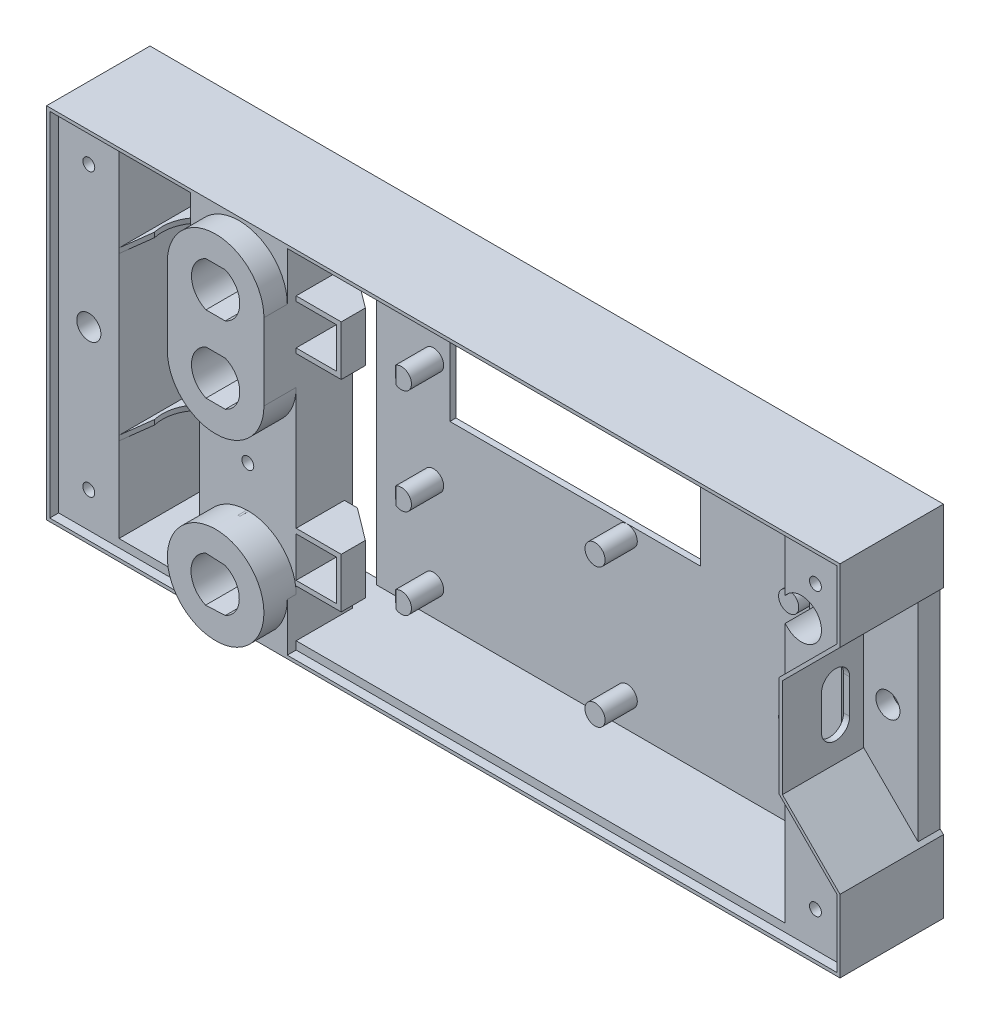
ISO-10303-21;
HEADER;
FILE_DESCRIPTION(('STEP AP214'),'2;1');
FILE_NAME('part.step','',(''),(''),'','','');
FILE_SCHEMA(('AUTOMOTIVE_DESIGN { 1 0 10303 214 1 1 1 1 }'));
ENDSEC;
DATA;
#1=APPLICATION_CONTEXT('core data for automotive mechanical design processes');
#2=APPLICATION_PROTOCOL_DEFINITION('international standard','automotive_design',2000,#1);
#3=PRODUCT_CONTEXT('',#1,'mechanical');
#4=PRODUCT('Part','Part','',(#3));
#5=PRODUCT_RELATED_PRODUCT_CATEGORY('part','',(#4));
#6=PRODUCT_DEFINITION_FORMATION('','',#4);
#7=PRODUCT_DEFINITION_CONTEXT('part definition',#1,'design');
#8=PRODUCT_DEFINITION('design','',#6,#7);
#9=PRODUCT_DEFINITION_SHAPE('','',#8);
#10=(LENGTH_UNIT() NAMED_UNIT(*) SI_UNIT(.MILLI.,.METRE.));
#11=(NAMED_UNIT(*) PLANE_ANGLE_UNIT() SI_UNIT($,.RADIAN.));
#12=(NAMED_UNIT(*) SI_UNIT($,.STERADIAN.) SOLID_ANGLE_UNIT());
#13=UNCERTAINTY_MEASURE_WITH_UNIT(LENGTH_MEASURE(1.E-05),#10,'distance_accuracy_value','');
#14=(GEOMETRIC_REPRESENTATION_CONTEXT(3) GLOBAL_UNCERTAINTY_ASSIGNED_CONTEXT((#13)) GLOBAL_UNIT_ASSIGNED_CONTEXT((#10,
#11,#12)) REPRESENTATION_CONTEXT('',''));
#15=CARTESIAN_POINT('',(0.,0.,0.));
#16=DIRECTION('',(0.,0.,1.));
#17=DIRECTION('',(1.,0.,0.));
#18=AXIS2_PLACEMENT_3D('',#15,#16,#17);
#19=CARTESIAN_POINT('',(136.5,85.5,-88.4604431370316));
#20=DIRECTION('',(1.,0.,0.));
#21=DIRECTION('',(0.,0.,-1.));
#22=AXIS2_PLACEMENT_3D('',#19,#20,#21);
#23=PLANE('',#22);
#24=DIRECTION('',(0.,0.,-1.));
#25=VECTOR('',#24,1.);
#26=CARTESIAN_POINT('',(136.5,67.5,-88.4604431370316));
#27=LINE('',#26,#25);
#28=CARTESIAN_POINT('',(136.5,67.5,5.5));
#29=VERTEX_POINT('',#28);
#30=CARTESIAN_POINT('',(136.5,67.5,0.));
#31=VERTEX_POINT('',#30);
#32=EDGE_CURVE('E924',#29,#31,#27,.T.);
#33=ORIENTED_EDGE('',*,*,#32,.F.);
#34=DIRECTION('',(0.,1.,0.));
#35=VECTOR('',#34,1.);
#36=CARTESIAN_POINT('',(136.5,67.5,5.5));
#37=LINE('',#36,#35);
#38=CARTESIAN_POINT('',(136.5,16.,5.5));
#39=VERTEX_POINT('',#38);
#40=EDGE_CURVE('E1612',#39,#29,#37,.T.);
#41=ORIENTED_EDGE('',*,*,#40,.F.);
#42=DIRECTION('',(0.,0.,1.));
#43=VECTOR('',#42,1.);
#44=CARTESIAN_POINT('',(136.5,16.,-88.4604431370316));
#45=LINE('',#44,#43);
#46=CARTESIAN_POINT('',(136.5,16.,0.));
#47=VERTEX_POINT('',#46);
#48=EDGE_CURVE('E897',#47,#39,#45,.T.);
#49=ORIENTED_EDGE('',*,*,#48,.F.);
#50=DIRECTION('',(0.,-1.,0.));
#51=VECTOR('',#50,1.);
#52=CARTESIAN_POINT('',(136.5,85.5,0.));
#53=LINE('',#52,#51);
#54=EDGE_CURVE('E1409',#31,#47,#53,.T.);
#55=ORIENTED_EDGE('',*,*,#54,.F.);
#56=EDGE_LOOP('',(#33,#41,#49,#55));
#57=FACE_BOUND('',#56,.T.);
#58=ADVANCED_FACE('F66',(#57),#23,.T.);
#59=CARTESIAN_POINT('',(0.,0.,23.5));
#60=DIRECTION('',(1.,0.,0.));
#61=DIRECTION('',(0.,0.,-1.));
#62=AXIS2_PLACEMENT_3D('',#59,#60,#61);
#63=PLANE('',#62);
#64=DIRECTION('',(0.,1.,0.));
#65=VECTOR('',#64,1.);
#66=CARTESIAN_POINT('',(0.,0.,11.5));
#67=LINE('',#66,#65);
#68=CARTESIAN_POINT('',(-1.82380322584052E-13,73.,11.5));
#69=VERTEX_POINT('',#68);
#70=CARTESIAN_POINT('',(0.,74.2,11.5));
#71=VERTEX_POINT('',#70);
#72=EDGE_CURVE('E1064',#69,#71,#67,.T.);
#73=ORIENTED_EDGE('',*,*,#72,.F.);
#74=DIRECTION('',(0.,0.,1.));
#75=VECTOR('',#74,1.);
#76=CARTESIAN_POINT('',(-1.82380322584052E-13,73.,11.5));
#77=LINE('',#76,#75);
#78=CARTESIAN_POINT('',(0.,73.,23.5));
#79=VERTEX_POINT('',#78);
#80=EDGE_CURVE('E1074',#69,#79,#77,.T.);
#81=ORIENTED_EDGE('',*,*,#80,.T.);
#82=DIRECTION('',(0.,1.,0.));
#83=VECTOR('',#82,1.);
#84=CARTESIAN_POINT('',(0.,0.,23.5));
#85=LINE('',#84,#83);
#86=CARTESIAN_POINT('',(0.,74.2,23.5));
#87=VERTEX_POINT('',#86);
#88=EDGE_CURVE('E1070',#79,#87,#85,.T.);
#89=ORIENTED_EDGE('',*,*,#88,.T.);
#90=DIRECTION('',(0.,0.,1.));
#91=VECTOR('',#90,1.);
#92=CARTESIAN_POINT('',(0.,74.2,23.5));
#93=LINE('',#92,#91);
#94=EDGE_CURVE('E1060',#71,#87,#93,.T.);
#95=ORIENTED_EDGE('',*,*,#94,.F.);
#96=EDGE_LOOP('',(#73,#81,#89,#95));
#97=FACE_BOUND('',#96,.T.);
#98=CARTESIAN_POINT('',(0.,61.8,11.5));
#99=VERTEX_POINT('',#98);
#100=CARTESIAN_POINT('',(0.,63.,11.5));
#101=VERTEX_POINT('',#100);
#102=EDGE_CURVE('E1069',#99,#101,#67,.T.);
#103=ORIENTED_EDGE('',*,*,#102,.F.);
#104=DIRECTION('',(0.,0.,-1.));
#105=VECTOR('',#104,1.);
#106=CARTESIAN_POINT('',(0.,61.8,23.5));
#107=LINE('',#106,#105);
#108=CARTESIAN_POINT('',(0.,61.8,23.5));
#109=VERTEX_POINT('',#108);
#110=EDGE_CURVE('E1056',#109,#99,#107,.T.);
#111=ORIENTED_EDGE('',*,*,#110,.F.);
#112=CARTESIAN_POINT('',(-1.79318705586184E-13,63.,23.5));
#113=VERTEX_POINT('',#112);
#114=EDGE_CURVE('E1073',#109,#113,#85,.T.);
#115=ORIENTED_EDGE('',*,*,#114,.T.);
#116=DIRECTION('',(0.,0.,1.));
#117=VECTOR('',#116,1.);
#118=CARTESIAN_POINT('',(-1.79318705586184E-13,63.,11.5));
#119=LINE('',#118,#117);
#120=EDGE_CURVE('E1687',#101,#113,#119,.T.);
#121=ORIENTED_EDGE('',*,*,#120,.F.);
#122=EDGE_LOOP('',(#103,#111,#115,#121));
#123=FACE_BOUND('',#122,.T.);
#124=DIRECTION('',(0.,0.,1.));
#125=VECTOR('',#124,1.);
#126=CARTESIAN_POINT('',(0.,54.5,25.7));
#127=LINE('',#126,#125);
#128=CARTESIAN_POINT('',(0.,54.5,23.5));
#129=VERTEX_POINT('',#128);
#130=CARTESIAN_POINT('',(0.,54.5,31.5));
#131=VERTEX_POINT('',#130);
#132=EDGE_CURVE('E1003',#129,#131,#127,.T.);
#133=ORIENTED_EDGE('',*,*,#132,.F.);
#134=DIRECTION('',(0.,-1.,0.));
#135=VECTOR('',#134,1.);
#136=CARTESIAN_POINT('',(0.,0.,23.5));
#137=LINE('',#136,#135);
#138=CARTESIAN_POINT('',(0.,24.2,23.5));
#139=VERTEX_POINT('',#138);
#140=EDGE_CURVE('E1178',#129,#139,#137,.T.);
#141=ORIENTED_EDGE('',*,*,#140,.T.);
#142=DIRECTION('',(0.,0.,1.));
#143=VECTOR('',#142,1.);
#144=CARTESIAN_POINT('',(0.,24.2,23.5));
#145=LINE('',#144,#143);
#146=CARTESIAN_POINT('',(0.,24.2,11.5));
#147=VERTEX_POINT('',#146);
#148=EDGE_CURVE('E1075',#147,#139,#145,.T.);
#149=ORIENTED_EDGE('',*,*,#148,.F.);
#150=DIRECTION('',(0.,-1.,0.));
#151=VECTOR('',#150,1.);
#152=CARTESIAN_POINT('',(0.,0.,11.5));
#153=LINE('',#152,#151);
#154=CARTESIAN_POINT('',(0.,23.,11.5));
#155=VERTEX_POINT('',#154);
#156=EDGE_CURVE('E1087',#147,#155,#153,.T.);
#157=ORIENTED_EDGE('',*,*,#156,.T.);
#158=DIRECTION('',(0.,0.,1.));
#159=VECTOR('',#158,1.);
#160=CARTESIAN_POINT('',(0.,23.,11.5));
#161=LINE('',#160,#159);
#162=CARTESIAN_POINT('',(0.,23.,23.5));
#163=VERTEX_POINT('',#162);
#164=EDGE_CURVE('E1651',#155,#163,#161,.T.);
#165=ORIENTED_EDGE('',*,*,#164,.T.);
#166=CARTESIAN_POINT('',(0.,13.,23.5));
#167=VERTEX_POINT('',#166);
#168=EDGE_CURVE('E1181',#163,#167,#137,.T.);
#169=ORIENTED_EDGE('',*,*,#168,.T.);
#170=DIRECTION('',(0.,0.,1.));
#171=VECTOR('',#170,1.);
#172=CARTESIAN_POINT('',(0.,13.,11.5));
#173=LINE('',#172,#171);
#174=CARTESIAN_POINT('',(0.,13.,11.5));
#175=VERTEX_POINT('',#174);
#176=EDGE_CURVE('E1640',#175,#167,#173,.T.);
#177=ORIENTED_EDGE('',*,*,#176,.F.);
#178=CARTESIAN_POINT('',(0.,11.8,11.5));
#179=VERTEX_POINT('',#178);
#180=EDGE_CURVE('E1083',#175,#179,#153,.T.);
#181=ORIENTED_EDGE('',*,*,#180,.T.);
#182=DIRECTION('',(0.,0.,-1.));
#183=VECTOR('',#182,1.);
#184=CARTESIAN_POINT('',(0.,11.8,23.5));
#185=LINE('',#184,#183);
#186=CARTESIAN_POINT('',(0.,11.8,23.5));
#187=VERTEX_POINT('',#186);
#188=EDGE_CURVE('E1079',#187,#179,#185,.T.);
#189=ORIENTED_EDGE('',*,*,#188,.F.);
#190=DIRECTION('',(0.,-1.,0.));
#191=VECTOR('',#190,1.);
#192=CARTESIAN_POINT('',(0.,10.,23.5));
#193=LINE('',#192,#191);
#194=CARTESIAN_POINT('',(0.,10.,23.5));
#195=VERTEX_POINT('',#194);
#196=EDGE_CURVE('E978',#187,#195,#193,.T.);
#197=ORIENTED_EDGE('',*,*,#196,.T.);
#198=DIRECTION('',(0.,0.,1.));
#199=VECTOR('',#198,1.);
#200=CARTESIAN_POINT('',(0.,10.,6.70336635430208));
#201=LINE('',#200,#199);
#202=CARTESIAN_POINT('',(0.,10.,25.7));
#203=VERTEX_POINT('',#202);
#204=EDGE_CURVE('E980',#195,#203,#201,.T.);
#205=ORIENTED_EDGE('',*,*,#204,.T.);
#206=DIRECTION('',(0.,-1.,0.));
#207=VECTOR('',#206,1.);
#208=CARTESIAN_POINT('',(0.,0.,25.7));
#209=LINE('',#208,#207);
#210=CARTESIAN_POINT('',(0.,-2.,25.7));
#211=VERTEX_POINT('',#210);
#212=EDGE_CURVE('E1011',#203,#211,#209,.T.);
#213=ORIENTED_EDGE('',*,*,#212,.T.);
#214=DIRECTION('',(0.,0.,-1.));
#215=VECTOR('',#214,1.);
#216=CARTESIAN_POINT('',(0.,-2.,31.5));
#217=LINE('',#216,#215);
#218=CARTESIAN_POINT('',(0.,-2.,23.5));
#219=VERTEX_POINT('',#218);
#220=EDGE_CURVE('E1119',#211,#219,#217,.T.);
#221=ORIENTED_EDGE('',*,*,#220,.T.);
#222=DIRECTION('',(0.,1.,0.));
#223=VECTOR('',#222,1.);
#224=CARTESIAN_POINT('',(0.,0.,23.5));
#225=LINE('',#224,#223);
#226=CARTESIAN_POINT('',(0.,0.,23.5));
#227=VERTEX_POINT('',#226);
#228=EDGE_CURVE('E1115',#219,#227,#225,.T.);
#229=ORIENTED_EDGE('',*,*,#228,.T.);
#230=DIRECTION('',(0.,0.,-1.));
#231=VECTOR('',#230,1.);
#232=CARTESIAN_POINT('',(0.,0.,23.5));
#233=LINE('',#232,#231);
#234=CARTESIAN_POINT('',(0.,0.,9.5));
#235=VERTEX_POINT('',#234);
#236=EDGE_CURVE('E1118',#227,#235,#233,.T.);
#237=ORIENTED_EDGE('',*,*,#236,.T.);
#238=DIRECTION('',(0.,-1.,0.));
#239=VECTOR('',#238,1.);
#240=CARTESIAN_POINT('',(0.,0.,9.50000000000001));
#241=LINE('',#240,#239);
#242=CARTESIAN_POINT('',(0.,83.4999999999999,9.5));
#243=VERTEX_POINT('',#242);
#244=EDGE_CURVE('E1538',#243,#235,#241,.T.);
#245=ORIENTED_EDGE('',*,*,#244,.F.);
#246=DIRECTION('',(0.,0.,-1.));
#247=VECTOR('',#246,1.);
#248=CARTESIAN_POINT('',(0.,83.5,23.5));
#249=LINE('',#248,#247);
#250=CARTESIAN_POINT('',(0.,83.5,23.5));
#251=VERTEX_POINT('',#250);
#252=EDGE_CURVE('E1159',#251,#243,#249,.T.);
#253=ORIENTED_EDGE('',*,*,#252,.F.);
#254=DIRECTION('',(0.,1.,0.));
#255=VECTOR('',#254,1.);
#256=CARTESIAN_POINT('',(0.,0.,23.5));
#257=LINE('',#256,#255);
#258=CARTESIAN_POINT('',(0.,85.5,23.5));
#259=VERTEX_POINT('',#258);
#260=EDGE_CURVE('E1120',#251,#259,#257,.T.);
#261=ORIENTED_EDGE('',*,*,#260,.T.);
#262=DIRECTION('',(0.,0.,-1.));
#263=VECTOR('',#262,1.);
#264=CARTESIAN_POINT('',(0.,85.5,31.5));
#265=LINE('',#264,#263);
#266=CARTESIAN_POINT('',(0.,85.5,25.7));
#267=VERTEX_POINT('',#266);
#268=EDGE_CURVE('E1167',#267,#259,#265,.T.);
#269=ORIENTED_EDGE('',*,*,#268,.F.);
#270=DIRECTION('',(0.,-1.,0.));
#271=VECTOR('',#270,1.);
#272=CARTESIAN_POINT('',(0.,0.,25.7));
#273=LINE('',#272,#271);
#274=CARTESIAN_POINT('',(0.,73.5,25.7));
#275=VERTEX_POINT('',#274);
#276=EDGE_CURVE('E1017',#267,#275,#273,.T.);
#277=ORIENTED_EDGE('',*,*,#276,.T.);
#278=DIRECTION('',(0.,0.,1.));
#279=VECTOR('',#278,1.);
#280=CARTESIAN_POINT('',(0.,73.5,25.7));
#281=LINE('',#280,#279);
#282=CARTESIAN_POINT('',(0.,73.5,31.5));
#283=VERTEX_POINT('',#282);
#284=EDGE_CURVE('E1000',#275,#283,#281,.T.);
#285=ORIENTED_EDGE('',*,*,#284,.T.);
#286=DIRECTION('',(0.,-1.,0.));
#287=VECTOR('',#286,1.);
#288=CARTESIAN_POINT('',(0.,85.5,31.5));
#289=LINE('',#288,#287);
#290=EDGE_CURVE('E1123',#283,#131,#289,.T.);
#291=ORIENTED_EDGE('',*,*,#290,.T.);
#292=EDGE_LOOP('',(#133,#141,#149,#157,#165,#169,#177,#181,#189,#197,#205,#213,#221,#229,#237,
#245,#253,#261,#269,#277,#285,#291));
#293=FACE_BOUND('',#292,.T.);
#294=ADVANCED_FACE('F1816',(#97,#123,#293),#63,.T.);
#295=CARTESIAN_POINT('',(-24.,0.,23.5));
#296=DIRECTION('',(-1.,0.,0.));
#297=DIRECTION('',(0.,0.,1.));
#298=AXIS2_PLACEMENT_3D('',#295,#296,#297);
#299=PLANE('',#298);
#300=DIRECTION('',(0.,1.,0.));
#301=VECTOR('',#300,1.);
#302=CARTESIAN_POINT('',(-24.,0.,25.7));
#303=LINE('',#302,#301);
#304=CARTESIAN_POINT('',(-24.,-2.,25.7));
#305=VERTEX_POINT('',#304);
#306=CARTESIAN_POINT('',(-24.,10.,25.7));
#307=VERTEX_POINT('',#306);
#308=EDGE_CURVE('E991',#305,#307,#303,.T.);
#309=ORIENTED_EDGE('',*,*,#308,.T.);
#310=DIRECTION('',(0.,0.,1.));
#311=VECTOR('',#310,1.);
#312=CARTESIAN_POINT('',(-24.,10.,6.70336635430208));
#313=LINE('',#312,#311);
#314=CARTESIAN_POINT('',(-24.,10.,23.5));
#315=VERTEX_POINT('',#314);
#316=EDGE_CURVE('E948',#315,#307,#313,.T.);
#317=ORIENTED_EDGE('',*,*,#316,.F.);
#318=DIRECTION('',(0.,1.,0.));
#319=VECTOR('',#318,1.);
#320=CARTESIAN_POINT('',(-24.,22.,23.5));
#321=LINE('',#320,#319);
#322=CARTESIAN_POINT('',(-24.,21.,23.5));
#323=VERTEX_POINT('',#322);
#324=EDGE_CURVE('E944',#315,#323,#321,.T.);
#325=ORIENTED_EDGE('',*,*,#324,.T.);
#326=DIRECTION('',(0.,0.,-1.));
#327=VECTOR('',#326,1.);
#328=CARTESIAN_POINT('',(-24.,21.,23.5));
#329=LINE('',#328,#327);
#330=CARTESIAN_POINT('',(-24.,21.,1.5));
#331=VERTEX_POINT('',#330);
#332=EDGE_CURVE('E1157',#323,#331,#329,.T.);
#333=ORIENTED_EDGE('',*,*,#332,.T.);
#334=DIRECTION('',(0.,1.,0.));
#335=VECTOR('',#334,1.);
#336=CARTESIAN_POINT('',(-24.,0.,1.5));
#337=LINE('',#336,#335);
#338=CARTESIAN_POINT('',(-24.,0.,1.5));
#339=VERTEX_POINT('',#338);
#340=EDGE_CURVE('E1203',#339,#331,#337,.T.);
#341=ORIENTED_EDGE('',*,*,#340,.F.);
#342=DIRECTION('',(0.,0.,-1.));
#343=VECTOR('',#342,1.);
#344=CARTESIAN_POINT('',(-24.,0.,23.5));
#345=LINE('',#344,#343);
#346=CARTESIAN_POINT('',(-24.,0.,23.5));
#347=VERTEX_POINT('',#346);
#348=EDGE_CURVE('E1192',#347,#339,#345,.T.);
#349=ORIENTED_EDGE('',*,*,#348,.F.);
#350=DIRECTION('',(0.,-1.,0.));
#351=VECTOR('',#350,1.);
#352=CARTESIAN_POINT('',(-24.,0.,23.5));
#353=LINE('',#352,#351);
#354=CARTESIAN_POINT('',(-24.,-2.,23.5));
#355=VERTEX_POINT('',#354);
#356=EDGE_CURVE('E1183',#347,#355,#353,.T.);
#357=ORIENTED_EDGE('',*,*,#356,.T.);
#358=DIRECTION('',(0.,0.,-1.));
#359=VECTOR('',#358,1.);
#360=CARTESIAN_POINT('',(-24.,-2.,31.5));
#361=LINE('',#360,#359);
#362=EDGE_CURVE('E1092',#305,#355,#361,.T.);
#363=ORIENTED_EDGE('',*,*,#362,.F.);
#364=EDGE_LOOP('',(#309,#317,#325,#333,#341,#349,#357,#363));
#365=FACE_BOUND('',#364,.T.);
#366=ADVANCED_FACE('F1887',(#365),#299,.T.);
#367=CARTESIAN_POINT('',(-24.,42.5,31.5));
#368=DIRECTION('',(0.,-1.,0.));
#369=DIRECTION('',(0.,0.,-1.));
#370=AXIS2_PLACEMENT_3D('',#367,#368,#369);
#371=PLANE('',#370);
#372=DIRECTION('',(0.,0.,1.));
#373=VECTOR('',#372,1.);
#374=CARTESIAN_POINT('',(-11.75,42.5,6.70336635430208));
#375=LINE('',#374,#373);
#376=CARTESIAN_POINT('',(-11.75,42.5,23.5));
#377=VERTEX_POINT('',#376);
#378=CARTESIAN_POINT('',(-11.75,42.5,25.7));
#379=VERTEX_POINT('',#378);
#380=EDGE_CURVE('E966',#377,#379,#375,.T.);
#381=ORIENTED_EDGE('',*,*,#380,.T.);
#382=DIRECTION('',(-1.,0.,0.));
#383=VECTOR('',#382,1.);
#384=CARTESIAN_POINT('',(-24.,42.5,25.7));
#385=LINE('',#384,#383);
#386=CARTESIAN_POINT('',(-12.,42.5,25.7));
#387=VERTEX_POINT('',#386);
#388=EDGE_CURVE('E1776',#379,#387,#385,.T.);
#389=ORIENTED_EDGE('',*,*,#388,.T.);
#390=CARTESIAN_POINT('',(-12.25,42.5,25.7));
#391=VERTEX_POINT('',#390);
#392=EDGE_CURVE('E1773',#387,#391,#385,.T.);
#393=ORIENTED_EDGE('',*,*,#392,.T.);
#394=DIRECTION('',(0.,0.,1.));
#395=VECTOR('',#394,1.);
#396=CARTESIAN_POINT('',(-12.25,42.5,6.70336635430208));
#397=LINE('',#396,#395);
#398=CARTESIAN_POINT('',(-12.25,42.5,23.5));
#399=VERTEX_POINT('',#398);
#400=EDGE_CURVE('E941',#399,#391,#397,.T.);
#401=ORIENTED_EDGE('',*,*,#400,.F.);
#402=DIRECTION('',(1.,0.,0.));
#403=VECTOR('',#402,1.);
#404=CARTESIAN_POINT('',(0.,42.5,23.5));
#405=LINE('',#404,#403);
#406=EDGE_CURVE('E1397',#399,#377,#405,.T.);
#407=ORIENTED_EDGE('',*,*,#406,.T.);
#408=EDGE_LOOP('',(#381,#389,#393,#401,#407));
#409=FACE_BOUND('',#408,.T.);
#410=ADVANCED_FACE('F2167',(#409),#371,.T.);
#411=CARTESIAN_POINT('',(0.,0.,31.5));
#412=DIRECTION('',(0.,0.,1.));
#413=DIRECTION('',(1.,0.,0.));
#414=AXIS2_PLACEMENT_3D('',#411,#412,#413);
#415=PLANE('',#414);
#416=CARTESIAN_POINT('',(-12.,73.5,31.5));
#417=DIRECTION('',(0.,0.,1.));
#418=DIRECTION('',(1.,0.,0.));
#419=AXIS2_PLACEMENT_3D('',#416,#417,#418);
#420=CIRCLE('',#419,6.);
#421=CARTESIAN_POINT('',(-14.3979157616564,79.,31.5));
#422=VERTEX_POINT('',#421);
#423=CARTESIAN_POINT('',(-14.3979157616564,68.,31.5));
#424=VERTEX_POINT('',#423);
#425=EDGE_CURVE('E1528',#422,#424,#420,.T.);
#426=ORIENTED_EDGE('',*,*,#425,.F.);
#427=DIRECTION('',(-1.,0.,0.));
#428=VECTOR('',#427,1.);
#429=CARTESIAN_POINT('',(-9.60208423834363,79.,31.5));
#430=LINE('',#429,#428);
#431=CARTESIAN_POINT('',(-9.60208423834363,79.,31.5));
#432=VERTEX_POINT('',#431);
#433=EDGE_CURVE('E1525',#432,#422,#430,.T.);
#434=ORIENTED_EDGE('',*,*,#433,.F.);
#435=CARTESIAN_POINT('',(-12.,73.5,31.5));
#436=DIRECTION('',(0.,0.,1.));
#437=DIRECTION('',(1.,0.,0.));
#438=AXIS2_PLACEMENT_3D('',#435,#436,#437);
#439=CIRCLE('',#438,6.);
#440=CARTESIAN_POINT('',(-9.60208423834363,68.,31.5));
#441=VERTEX_POINT('',#440);
#442=EDGE_CURVE('E1522',#441,#432,#439,.T.);
#443=ORIENTED_EDGE('',*,*,#442,.F.);
#444=DIRECTION('',(1.,0.,0.));
#445=VECTOR('',#444,1.);
#446=CARTESIAN_POINT('',(-9.60208423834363,68.,31.5));
#447=LINE('',#446,#445);
#448=EDGE_CURVE('E1521',#424,#441,#447,.T.);
#449=ORIENTED_EDGE('',*,*,#448,.F.);
#450=EDGE_LOOP('',(#426,#434,#443,#449));
#451=FACE_BOUND('',#450,.T.);
#452=CARTESIAN_POINT('',(-12.,54.5,31.5));
#453=DIRECTION('',(0.,0.,1.));
#454=DIRECTION('',(1.,0.,0.));
#455=AXIS2_PLACEMENT_3D('',#452,#453,#454);
#456=CIRCLE('',#455,6.);
#457=CARTESIAN_POINT('',(-14.3979157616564,60.,31.5));
#458=VERTEX_POINT('',#457);
#459=CARTESIAN_POINT('',(-14.3979157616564,49.,31.5));
#460=VERTEX_POINT('',#459);
#461=EDGE_CURVE('E1508',#458,#460,#456,.T.);
#462=ORIENTED_EDGE('',*,*,#461,.F.);
#463=DIRECTION('',(-1.,0.,0.));
#464=VECTOR('',#463,1.);
#465=CARTESIAN_POINT('',(-9.60208423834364,60.,31.5));
#466=LINE('',#465,#464);
#467=CARTESIAN_POINT('',(-9.60208423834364,60.,31.5));
#468=VERTEX_POINT('',#467);
#469=EDGE_CURVE('E1505',#468,#458,#466,.T.);
#470=ORIENTED_EDGE('',*,*,#469,.F.);
#471=CARTESIAN_POINT('',(-12.,54.5,31.5));
#472=DIRECTION('',(0.,0.,1.));
#473=DIRECTION('',(1.,0.,0.));
#474=AXIS2_PLACEMENT_3D('',#471,#472,#473);
#475=CIRCLE('',#474,6.);
#476=CARTESIAN_POINT('',(-9.60208423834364,49.,31.5));
#477=VERTEX_POINT('',#476);
#478=EDGE_CURVE('E1502',#477,#468,#475,.T.);
#479=ORIENTED_EDGE('',*,*,#478,.F.);
#480=DIRECTION('',(1.,0.,0.));
#481=VECTOR('',#480,1.);
#482=CARTESIAN_POINT('',(-9.60208423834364,49.,31.5));
#483=LINE('',#482,#481);
#484=EDGE_CURVE('E1501',#460,#477,#483,.T.);
#485=ORIENTED_EDGE('',*,*,#484,.F.);
#486=EDGE_LOOP('',(#462,#470,#479,#485));
#487=FACE_BOUND('',#486,.T.);
#488=ORIENTED_EDGE('',*,*,#290,.F.);
#489=CARTESIAN_POINT('',(-12.,73.5,31.5));
#490=DIRECTION('',(0.,0.,1.));
#491=DIRECTION('',(1.,0.,0.));
#492=AXIS2_PLACEMENT_3D('',#489,#490,#491);
#493=CIRCLE('',#492,12.);
#494=CARTESIAN_POINT('',(-24.,73.5,31.5));
#495=VERTEX_POINT('',#494);
#496=EDGE_CURVE('E1770',#283,#495,#493,.T.);
#497=ORIENTED_EDGE('',*,*,#496,.T.);
#498=DIRECTION('',(0.,1.,0.));
#499=VECTOR('',#498,1.);
#500=CARTESIAN_POINT('',(-24.,85.5,31.5));
#501=LINE('',#500,#499);
#502=CARTESIAN_POINT('',(-24.,54.5,31.5));
#503=VERTEX_POINT('',#502);
#504=EDGE_CURVE('E1257',#503,#495,#501,.T.);
#505=ORIENTED_EDGE('',*,*,#504,.F.);
#506=CARTESIAN_POINT('',(-12.,54.5,31.5));
#507=DIRECTION('',(0.,0.,1.));
#508=DIRECTION('',(1.,0.,0.));
#509=AXIS2_PLACEMENT_3D('',#506,#507,#508);
#510=CIRCLE('',#509,12.);
#511=EDGE_CURVE('E1767',#503,#131,#510,.T.);
#512=ORIENTED_EDGE('',*,*,#511,.T.);
#513=EDGE_LOOP('',(#488,#497,#505,#512));
#514=FACE_BOUND('',#513,.T.);
#515=ADVANCED_FACE('F2186',(#451,#487,#514),#415,.T.);
#516=CARTESIAN_POINT('',(0.,22.,31.5));
#517=DIRECTION('',(0.,1.,0.));
#518=DIRECTION('',(0.,0.,1.));
#519=AXIS2_PLACEMENT_3D('',#516,#517,#518);
#520=PLANE('',#519);
#521=DIRECTION('',(0.,0.,1.));
#522=VECTOR('',#521,1.);
#523=CARTESIAN_POINT('',(-12.2472598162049,22.,6.70336635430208));
#524=LINE('',#523,#522);
#525=CARTESIAN_POINT('',(-12.2472598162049,22.,23.5));
#526=VERTEX_POINT('',#525);
#527=CARTESIAN_POINT('',(-12.2472598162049,22.,25.7));
#528=VERTEX_POINT('',#527);
#529=EDGE_CURVE('E957',#526,#528,#524,.T.);
#530=ORIENTED_EDGE('',*,*,#529,.T.);
#531=DIRECTION('',(1.,0.,0.));
#532=VECTOR('',#531,1.);
#533=CARTESIAN_POINT('',(0.,22.,25.7));
#534=LINE('',#533,#532);
#535=CARTESIAN_POINT('',(-12.,22.,25.7));
#536=VERTEX_POINT('',#535);
#537=EDGE_CURVE('E1766',#528,#536,#534,.T.);
#538=ORIENTED_EDGE('',*,*,#537,.T.);
#539=CARTESIAN_POINT('',(-11.7527401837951,22.,25.7));
#540=VERTEX_POINT('',#539);
#541=EDGE_CURVE('E1763',#536,#540,#534,.T.);
#542=ORIENTED_EDGE('',*,*,#541,.T.);
#543=DIRECTION('',(0.,0.,1.));
#544=VECTOR('',#543,1.);
#545=CARTESIAN_POINT('',(-11.7527401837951,22.,6.70336635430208));
#546=LINE('',#545,#544);
#547=CARTESIAN_POINT('',(-11.7527401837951,22.,23.5));
#548=VERTEX_POINT('',#547);
#549=EDGE_CURVE('E983',#548,#540,#546,.T.);
#550=ORIENTED_EDGE('',*,*,#549,.F.);
#551=DIRECTION('',(-1.,0.,0.));
#552=VECTOR('',#551,1.);
#553=CARTESIAN_POINT('',(0.,22.,23.5));
#554=LINE('',#553,#552);
#555=EDGE_CURVE('E1425',#548,#526,#554,.T.);
#556=ORIENTED_EDGE('',*,*,#555,.T.);
#557=EDGE_LOOP('',(#530,#538,#542,#550,#556));
#558=FACE_BOUND('',#557,.T.);
#559=ADVANCED_FACE('F2335',(#558),#520,.T.);
#560=CARTESIAN_POINT('',(0.,0.,31.5));
#561=DIRECTION('',(0.,0.,1.));
#562=DIRECTION('',(1.,0.,0.));
#563=AXIS2_PLACEMENT_3D('',#560,#561,#562);
#564=PLANE('',#563);
#565=CARTESIAN_POINT('',(-12.,10.,31.5));
#566=DIRECTION('',(0.,0.,1.));
#567=DIRECTION('',(1.,0.,0.));
#568=AXIS2_PLACEMENT_3D('',#565,#566,#567);
#569=CIRCLE('',#568,6.12216122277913);
#570=CARTESIAN_POINT('',(-14.3979157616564,15.633015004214,31.5));
#571=VERTEX_POINT('',#570);
#572=CARTESIAN_POINT('',(-14.4973890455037,4.41037514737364,31.5));
#573=VERTEX_POINT('',#572);
#574=EDGE_CURVE('E1488',#571,#573,#569,.T.);
#575=ORIENTED_EDGE('',*,*,#574,.F.);
#576=DIRECTION('',(-0.99886264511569,0.0476803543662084,0.));
#577=VECTOR('',#576,1.);
#578=CARTESIAN_POINT('',(-9.69759541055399,15.4086468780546,31.5));
#579=LINE('',#578,#577);
#580=CARTESIAN_POINT('',(-9.69759541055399,15.4086468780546,31.5));
#581=VERTEX_POINT('',#580);
#582=EDGE_CURVE('E1485',#581,#571,#579,.T.);
#583=ORIENTED_EDGE('',*,*,#582,.F.);
#584=CARTESIAN_POINT('',(-12.,10.,31.5));
#585=DIRECTION('',(0.,0.,1.));
#586=DIRECTION('',(1.,0.,0.));
#587=AXIS2_PLACEMENT_3D('',#584,#585,#586);
#588=CIRCLE('',#587,5.87830995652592);
#589=CARTESIAN_POINT('',(-9.60208423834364,4.63301500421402,31.5));
#590=VERTEX_POINT('',#589);
#591=EDGE_CURVE('E1482',#590,#581,#588,.T.);
#592=ORIENTED_EDGE('',*,*,#591,.F.);
#593=DIRECTION('',(0.998967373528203,0.0454333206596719,0.));
#594=VECTOR('',#593,1.);
#595=CARTESIAN_POINT('',(-9.60208423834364,4.63301500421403,31.5));
#596=LINE('',#595,#594);
#597=EDGE_CURVE('E1481',#573,#590,#596,.T.);
#598=ORIENTED_EDGE('',*,*,#597,.F.);
#599=EDGE_LOOP('',(#575,#583,#592,#598));
#600=FACE_BOUND('',#599,.T.);
#601=CARTESIAN_POINT('',(-12.,10.,31.5));
#602=DIRECTION('',(0.,0.,1.));
#603=DIRECTION('',(1.,0.,0.));
#604=AXIS2_PLACEMENT_3D('',#601,#602,#603);
#605=CIRCLE('',#604,12.);
#606=CARTESIAN_POINT('',(0.,10.,31.5));
#607=VERTEX_POINT('',#606);
#608=EDGE_CURVE('E1760',#607,#607,#605,.T.);
#609=ORIENTED_EDGE('',*,*,#608,.T.);
#610=EDGE_LOOP('',(#609));
#611=FACE_BOUND('',#610,.T.);
#612=ADVANCED_FACE('F2570',(#600,#611),#564,.T.);
#613=CARTESIAN_POINT('',(-46.,0.,1.5));
#614=DIRECTION('',(0.,1.,0.));
#615=DIRECTION('',(-1.,0.,0.));
#616=AXIS2_PLACEMENT_3D('',#613,#614,#615);
#617=PLANE('',#616);
#618=DIRECTION('',(0.,0.,1.));
#619=VECTOR('',#618,1.);
#620=CARTESIAN_POINT('',(-2.,0.,23.5));
#621=LINE('',#620,#619);
#622=CARTESIAN_POINT('',(-2.,0.,9.5));
#623=VERTEX_POINT('',#622);
#624=CARTESIAN_POINT('',(-2.,0.,21.5));
#625=VERTEX_POINT('',#624);
#626=EDGE_CURVE('E1108',#623,#625,#621,.T.);
#627=ORIENTED_EDGE('',*,*,#626,.F.);
#628=DIRECTION('',(1.,0.,0.));
#629=VECTOR('',#628,1.);
#630=CARTESIAN_POINT('',(-17.,0.,9.5));
#631=LINE('',#630,#629);
#632=EDGE_CURVE('E1743',#623,#235,#631,.T.);
#633=ORIENTED_EDGE('',*,*,#632,.T.);
#634=ORIENTED_EDGE('',*,*,#236,.F.);
#635=DIRECTION('',(1.,0.,0.));
#636=VECTOR('',#635,1.);
#637=CARTESIAN_POINT('',(0.,0.,23.5));
#638=LINE('',#637,#636);
#639=CARTESIAN_POINT('',(121.5,0.,23.5));
#640=VERTEX_POINT('',#639);
#641=EDGE_CURVE('E1153',#227,#640,#638,.T.);
#642=ORIENTED_EDGE('',*,*,#641,.T.);
#643=DIRECTION('',(0.,0.,-1.));
#644=VECTOR('',#643,1.);
#645=CARTESIAN_POINT('',(121.5,0.,23.5));
#646=LINE('',#645,#644);
#647=CARTESIAN_POINT('',(121.5,0.,9.5));
#648=VERTEX_POINT('',#647);
#649=EDGE_CURVE('E1149',#640,#648,#646,.T.);
#650=ORIENTED_EDGE('',*,*,#649,.T.);
#651=DIRECTION('',(1.,0.,0.));
#652=VECTOR('',#651,1.);
#653=CARTESIAN_POINT('',(121.5,0.,9.5));
#654=LINE('',#653,#652);
#655=CARTESIAN_POINT('',(113.5,0.,9.5));
#656=VERTEX_POINT('',#655);
#657=EDGE_CURVE('E1363',#656,#648,#654,.T.);
#658=ORIENTED_EDGE('',*,*,#657,.F.);
#659=DIRECTION('',(0.,0.,-1.));
#660=VECTOR('',#659,1.);
#661=CARTESIAN_POINT('',(113.5,0.,9.5));
#662=LINE('',#661,#660);
#663=CARTESIAN_POINT('',(113.5,0.,1.5));
#664=VERTEX_POINT('',#663);
#665=EDGE_CURVE('E1177',#656,#664,#662,.T.);
#666=ORIENTED_EDGE('',*,*,#665,.T.);
#667=DIRECTION('',(1.,0.,0.));
#668=VECTOR('',#667,1.);
#669=CARTESIAN_POINT('',(0.,0.,1.5));
#670=LINE('',#669,#668);
#671=CARTESIAN_POINT('',(-2.,0.,1.5));
#672=VERTEX_POINT('',#671);
#673=EDGE_CURVE('E1168',#672,#664,#670,.T.);
#674=ORIENTED_EDGE('',*,*,#673,.F.);
#675=CARTESIAN_POINT('',(-2.,0.,0.));
#676=VERTEX_POINT('',#675);
#677=EDGE_CURVE('E1046',#676,#672,#621,.T.);
#678=ORIENTED_EDGE('',*,*,#677,.F.);
#679=DIRECTION('',(1.,0.,0.));
#680=VECTOR('',#679,1.);
#681=CARTESIAN_POINT('',(-46.,0.,0.));
#682=LINE('',#681,#680);
#683=CARTESIAN_POINT('',(-22.,0.,0.));
#684=VERTEX_POINT('',#683);
#685=EDGE_CURVE('E1392',#684,#676,#682,.T.);
#686=ORIENTED_EDGE('',*,*,#685,.F.);
#687=DIRECTION('',(0.,0.,1.));
#688=VECTOR('',#687,1.);
#689=CARTESIAN_POINT('',(-22.,0.,1.5));
#690=LINE('',#689,#688);
#691=CARTESIAN_POINT('',(-22.,0.,21.5));
#692=VERTEX_POINT('',#691);
#693=EDGE_CURVE('E1389',#684,#692,#690,.T.);
#694=ORIENTED_EDGE('',*,*,#693,.T.);
#695=DIRECTION('',(1.,0.,0.));
#696=VECTOR('',#695,1.);
#697=CARTESIAN_POINT('',(-46.,0.,21.5));
#698=LINE('',#697,#696);
#699=EDGE_CURVE('E1104',#692,#625,#698,.T.);
#700=ORIENTED_EDGE('',*,*,#699,.T.);
#701=EDGE_LOOP('',(#627,#633,#634,#642,#650,#658,#666,#674,#678,#686,#694,#700));
#702=FACE_BOUND('',#701,.T.);
#703=ADVANCED_FACE('F1805',(#702),#617,.T.);
#704=CARTESIAN_POINT('',(-2.,0.,23.5));
#705=DIRECTION('',(1.,0.,0.));
#706=DIRECTION('',(0.,0.,-1.));
#707=AXIS2_PLACEMENT_3D('',#704,#705,#706);
#708=PLANE('',#707);
#709=ORIENTED_EDGE('',*,*,#677,.T.);
#710=DIRECTION('',(0.,1.,0.));
#711=VECTOR('',#710,1.);
#712=CARTESIAN_POINT('',(-2.,0.,1.5));
#713=LINE('',#712,#711);
#714=CARTESIAN_POINT('',(-2.,83.4999999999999,1.5));
#715=VERTEX_POINT('',#714);
#716=EDGE_CURVE('E1395',#672,#715,#713,.T.);
#717=ORIENTED_EDGE('',*,*,#716,.T.);
#718=DIRECTION('',(0.,0.,1.));
#719=VECTOR('',#718,1.);
#720=CARTESIAN_POINT('',(-2.,83.5,1.5));
#721=LINE('',#720,#719);
#722=CARTESIAN_POINT('',(-2.,83.5,0.));
#723=VERTEX_POINT('',#722);
#724=EDGE_CURVE('E1224',#723,#715,#721,.T.);
#725=ORIENTED_EDGE('',*,*,#724,.F.);
#726=DIRECTION('',(0.,-1.,0.));
#727=VECTOR('',#726,1.);
#728=CARTESIAN_POINT('',(-2.,0.,0.));
#729=LINE('',#728,#727);
#730=EDGE_CURVE('E1300',#723,#676,#729,.T.);
#731=ORIENTED_EDGE('',*,*,#730,.T.);
#732=EDGE_LOOP('',(#709,#717,#725,#731));
#733=FACE_BOUND('',#732,.T.);
#734=ADVANCED_FACE('F2583',(#733),#708,.F.);
#735=CARTESIAN_POINT('',(12.15,77.85,9.5));
#736=DIRECTION('',(0.,0.,-1.));
#737=DIRECTION('',(-1.,0.,0.));
#738=AXIS2_PLACEMENT_3D('',#735,#736,#737);
#739=CYLINDRICAL_SURFACE('',#738,4.);
#740=CARTESIAN_POINT('',(12.15,77.85,1.5));
#741=DIRECTION('',(0.,0.,1.));
#742=DIRECTION('',(1.,0.,0.));
#743=AXIS2_PLACEMENT_3D('',#740,#741,#742);
#744=CIRCLE('',#743,4.);
#745=CARTESIAN_POINT('',(16.15,77.85,1.5));
#746=VERTEX_POINT('',#745);
#747=EDGE_CURVE('E1296',#746,#746,#744,.T.);
#748=ORIENTED_EDGE('',*,*,#747,.T.);
#749=EDGE_LOOP('',(#748));
#750=FACE_BOUND('',#749,.T.);
#751=CARTESIAN_POINT('',(12.15,77.85,10.8900126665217));
#752=DIRECTION('',(-0.704571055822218,0.,0.709633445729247));
#753=DIRECTION('',(-0.709633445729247,0.,-0.704571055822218));
#754=AXIS2_PLACEMENT_3D('',#751,#752,#753);
#755=ELLIPSE('',#754,5.63671290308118,4.);
#756=CARTESIAN_POINT('',(10.75,81.596998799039,9.5));
#757=VERTEX_POINT('',#756);
#758=CARTESIAN_POINT('',(10.75,74.1030012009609,9.5));
#759=VERTEX_POINT('',#758);
#760=EDGE_CURVE('E1697',#757,#759,#755,.T.);
#761=ORIENTED_EDGE('',*,*,#760,.F.);
#762=CARTESIAN_POINT('',(12.15,77.85,9.5));
#763=DIRECTION('',(0.,0.,1.));
#764=DIRECTION('',(1.,0.,0.));
#765=AXIS2_PLACEMENT_3D('',#762,#763,#764);
#766=CIRCLE('',#765,4.);
#767=EDGE_CURVE('E1299',#759,#757,#766,.T.);
#768=ORIENTED_EDGE('',*,*,#767,.F.);
#769=EDGE_LOOP('',(#761,#768));
#770=FACE_BOUND('',#769,.T.);
#771=ADVANCED_FACE('F2590',(#750,#770),#739,.T.);
#772=CARTESIAN_POINT('',(12.15,77.85,9.5));
#773=DIRECTION('',(0.,0.,1.));
#774=DIRECTION('',(1.,0.,0.));
#775=AXIS2_PLACEMENT_3D('',#772,#773,#774);
#776=PLANE('',#775);
#777=ORIENTED_EDGE('',*,*,#767,.T.);
#778=DIRECTION('',(0.,1.,0.));
#779=VECTOR('',#778,1.);
#780=CARTESIAN_POINT('',(10.75,2.8,9.5));
#781=LINE('',#780,#779);
#782=CARTESIAN_POINT('',(10.75,77.85,9.4999999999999));
#783=VERTEX_POINT('',#782);
#784=EDGE_CURVE('E1733',#783,#757,#781,.T.);
#785=ORIENTED_EDGE('',*,*,#784,.F.);
#786=CARTESIAN_POINT('',(12.15,77.85,9.5));
#787=DIRECTION('',(0.,0.,1.));
#788=DIRECTION('',(1.,0.,0.));
#789=AXIS2_PLACEMENT_3D('',#786,#787,#788);
#790=CIRCLE('',#789,1.4);
#791=EDGE_CURVE('E1327',#783,#783,#790,.T.);
#792=ORIENTED_EDGE('',*,*,#791,.F.);
#793=EDGE_CURVE('E1699',#759,#783,#781,.T.);
#794=ORIENTED_EDGE('',*,*,#793,.F.);
#795=EDGE_LOOP('',(#777,#785,#792,#794));
#796=FACE_BOUND('',#795,.T.);
#797=ADVANCED_FACE('F2599',(#796),#776,.T.);
#798=CARTESIAN_POINT('',(12.15,55.5794688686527,9.5));
#799=DIRECTION('',(0.,0.,-1.));
#800=DIRECTION('',(-1.,0.,0.));
#801=AXIS2_PLACEMENT_3D('',#798,#799,#800);
#802=CYLINDRICAL_SURFACE('',#801,2.5);
#803=CARTESIAN_POINT('',(12.15,55.5794688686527,1.5));
#804=DIRECTION('',(0.,0.,1.));
#805=DIRECTION('',(1.,0.,0.));
#806=AXIS2_PLACEMENT_3D('',#803,#804,#805);
#807=CIRCLE('',#806,2.5);
#808=CARTESIAN_POINT('',(14.65,55.5794688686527,1.5));
#809=VERTEX_POINT('',#808);
#810=EDGE_CURVE('E1303',#809,#809,#807,.T.);
#811=ORIENTED_EDGE('',*,*,#810,.T.);
#812=EDGE_LOOP('',(#811));
#813=FACE_BOUND('',#812,.T.);
#814=CARTESIAN_POINT('',(12.15,55.5794688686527,10.8900126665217));
#815=DIRECTION('',(-0.704571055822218,0.,0.709633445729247));
#816=DIRECTION('',(-0.709633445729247,0.,-0.704571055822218));
#817=AXIS2_PLACEMENT_3D('',#814,#815,#816);
#818=ELLIPSE('',#817,3.52294556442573,2.5);
#819=CARTESIAN_POINT('',(10.75,57.6507003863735,9.5));
#820=VERTEX_POINT('',#819);
#821=CARTESIAN_POINT('',(10.75,53.5082373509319,9.5));
#822=VERTEX_POINT('',#821);
#823=EDGE_CURVE('E1701',#820,#822,#818,.T.);
#824=ORIENTED_EDGE('',*,*,#823,.F.);
#825=CARTESIAN_POINT('',(12.15,55.5794688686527,9.5));
#826=DIRECTION('',(0.,0.,1.));
#827=DIRECTION('',(1.,0.,0.));
#828=AXIS2_PLACEMENT_3D('',#825,#826,#827);
#829=CIRCLE('',#828,2.5);
#830=EDGE_CURVE('E1312',#822,#820,#829,.T.);
#831=ORIENTED_EDGE('',*,*,#830,.F.);
#832=EDGE_LOOP('',(#824,#831));
#833=FACE_BOUND('',#832,.T.);
#834=ADVANCED_FACE('F2607',(#813,#833),#802,.T.);
#835=CARTESIAN_POINT('',(12.15,55.5794688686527,9.5));
#836=DIRECTION('',(0.,0.,1.));
#837=DIRECTION('',(1.,0.,0.));
#838=AXIS2_PLACEMENT_3D('',#835,#836,#837);
#839=PLANE('',#838);
#840=ORIENTED_EDGE('',*,*,#830,.T.);
#841=EDGE_CURVE('E1700',#822,#820,#781,.T.);
#842=ORIENTED_EDGE('',*,*,#841,.F.);
#843=EDGE_LOOP('',(#840,#842));
#844=FACE_BOUND('',#843,.T.);
#845=ADVANCED_FACE('F2615',(#844),#839,.T.);
#846=CARTESIAN_POINT('',(12.15,29.5794688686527,9.5));
#847=DIRECTION('',(0.,0.,-1.));
#848=DIRECTION('',(-1.,0.,0.));
#849=AXIS2_PLACEMENT_3D('',#846,#847,#848);
#850=CYLINDRICAL_SURFACE('',#849,2.5);
#851=CARTESIAN_POINT('',(12.15,29.5794688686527,1.5));
#852=DIRECTION('',(0.,0.,1.));
#853=DIRECTION('',(1.,0.,0.));
#854=AXIS2_PLACEMENT_3D('',#851,#852,#853);
#855=CIRCLE('',#854,2.5);
#856=CARTESIAN_POINT('',(14.65,29.5794688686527,1.5));
#857=VERTEX_POINT('',#856);
#858=EDGE_CURVE('E1315',#857,#857,#855,.T.);
#859=ORIENTED_EDGE('',*,*,#858,.T.);
#860=EDGE_LOOP('',(#859));
#861=FACE_BOUND('',#860,.T.);
#862=CARTESIAN_POINT('',(12.15,29.5794688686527,10.8900126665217));
#863=DIRECTION('',(-0.704571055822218,0.,0.709633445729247));
#864=DIRECTION('',(-0.709633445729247,0.,-0.704571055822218));
#865=AXIS2_PLACEMENT_3D('',#862,#863,#864);
#866=ELLIPSE('',#865,3.52294556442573,2.5);
#867=CARTESIAN_POINT('',(10.75,31.6507003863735,9.5));
#868=VERTEX_POINT('',#867);
#869=CARTESIAN_POINT('',(10.75,27.5082373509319,9.5));
#870=VERTEX_POINT('',#869);
#871=EDGE_CURVE('E1704',#868,#870,#866,.T.);
#872=ORIENTED_EDGE('',*,*,#871,.F.);
#873=CARTESIAN_POINT('',(12.15,29.5794688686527,9.5));
#874=DIRECTION('',(0.,0.,1.));
#875=DIRECTION('',(1.,0.,0.));
#876=AXIS2_PLACEMENT_3D('',#873,#874,#875);
#877=CIRCLE('',#876,2.5);
#878=EDGE_CURVE('E1318',#870,#868,#877,.T.);
#879=ORIENTED_EDGE('',*,*,#878,.F.);
#880=EDGE_LOOP('',(#872,#879));
#881=FACE_BOUND('',#880,.T.);
#882=ADVANCED_FACE('F2623',(#861,#881),#850,.T.);
#883=CARTESIAN_POINT('',(12.15,29.5794688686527,9.5));
#884=DIRECTION('',(0.,0.,1.));
#885=DIRECTION('',(1.,0.,0.));
#886=AXIS2_PLACEMENT_3D('',#883,#884,#885);
#887=PLANE('',#886);
#888=ORIENTED_EDGE('',*,*,#878,.T.);
#889=EDGE_CURVE('E1703',#870,#868,#781,.T.);
#890=ORIENTED_EDGE('',*,*,#889,.F.);
#891=EDGE_LOOP('',(#888,#890));
#892=FACE_BOUND('',#891,.T.);
#893=ADVANCED_FACE('F2631',(#892),#887,.T.);
#894=CARTESIAN_POINT('',(12.15,7.27994652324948,9.5));
#895=DIRECTION('',(0.,0.,-1.));
#896=DIRECTION('',(-1.,0.,0.));
#897=AXIS2_PLACEMENT_3D('',#894,#895,#896);
#898=CYLINDRICAL_SURFACE('',#897,2.5);
#899=CARTESIAN_POINT('',(12.15,7.27994652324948,1.5));
#900=DIRECTION('',(0.,0.,1.));
#901=DIRECTION('',(1.,0.,0.));
#902=AXIS2_PLACEMENT_3D('',#899,#900,#901);
#903=CIRCLE('',#902,2.5);
#904=CARTESIAN_POINT('',(14.65,7.27994652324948,1.5));
#905=VERTEX_POINT('',#904);
#906=EDGE_CURVE('E1321',#905,#905,#903,.T.);
#907=ORIENTED_EDGE('',*,*,#906,.T.);
#908=EDGE_LOOP('',(#907));
#909=FACE_BOUND('',#908,.T.);
#910=CARTESIAN_POINT('',(12.15,7.27994652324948,10.8900126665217));
#911=DIRECTION('',(-0.704571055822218,0.,0.709633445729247));
#912=DIRECTION('',(-0.709633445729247,0.,-0.704571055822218));
#913=AXIS2_PLACEMENT_3D('',#910,#911,#912);
#914=ELLIPSE('',#913,3.52294556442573,2.5);
#915=CARTESIAN_POINT('',(10.75,9.35117804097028,9.5));
#916=VERTEX_POINT('',#915);
#917=CARTESIAN_POINT('',(10.75,5.20871500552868,9.5));
#918=VERTEX_POINT('',#917);
#919=EDGE_CURVE('E1707',#916,#918,#914,.T.);
#920=ORIENTED_EDGE('',*,*,#919,.F.);
#921=CARTESIAN_POINT('',(12.15,7.27994652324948,9.5));
#922=DIRECTION('',(0.,0.,1.));
#923=DIRECTION('',(1.,0.,0.));
#924=AXIS2_PLACEMENT_3D('',#921,#922,#923);
#925=CIRCLE('',#924,2.5);
#926=EDGE_CURVE('E1324',#918,#916,#925,.T.);
#927=ORIENTED_EDGE('',*,*,#926,.F.);
#928=EDGE_LOOP('',(#920,#927));
#929=FACE_BOUND('',#928,.T.);
#930=ADVANCED_FACE('F2639',(#909,#929),#898,.T.);
#931=CARTESIAN_POINT('',(12.15,7.27994652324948,9.5));
#932=DIRECTION('',(0.,0.,1.));
#933=DIRECTION('',(1.,0.,0.));
#934=AXIS2_PLACEMENT_3D('',#931,#932,#933);
#935=PLANE('',#934);
#936=ORIENTED_EDGE('',*,*,#926,.T.);
#937=EDGE_CURVE('E1706',#918,#916,#781,.T.);
#938=ORIENTED_EDGE('',*,*,#937,.F.);
#939=EDGE_LOOP('',(#936,#938));
#940=FACE_BOUND('',#939,.T.);
#941=ADVANCED_FACE('F2647',(#940),#935,.T.);
#942=CARTESIAN_POINT('',(12.15,77.85,11.5));
#943=DIRECTION('',(0.,0.,-1.));
#944=DIRECTION('',(-1.,0.,0.));
#945=AXIS2_PLACEMENT_3D('',#942,#943,#944);
#946=CYLINDRICAL_SURFACE('',#945,1.4);
#947=CARTESIAN_POINT('',(12.15,77.85,400.597157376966));
#948=DIRECTION('',(-0.999993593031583,0.,0.00357965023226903));
#949=DIRECTION('',(-0.00357965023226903,0.,-0.999993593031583));
#950=AXIS2_PLACEMENT_3D('',#947,#948,#949);
#951=ELLIPSE('',#950,391.099663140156,1.4);
#952=CARTESIAN_POINT('',(10.7571593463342,77.7085966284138,11.5));
#953=VERTEX_POINT('',#952);
#954=EDGE_CURVE('E1713',#783,#953,#951,.T.);
#955=ORIENTED_EDGE('',*,*,#954,.F.);
#956=ORIENTED_EDGE('',*,*,#791,.T.);
#957=CARTESIAN_POINT('',(10.7571593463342,77.9914033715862,11.5));
#958=VERTEX_POINT('',#957);
#959=EDGE_CURVE('E1709',#958,#783,#951,.T.);
#960=ORIENTED_EDGE('',*,*,#959,.F.);
#961=CARTESIAN_POINT('',(12.15,77.85,11.5));
#962=DIRECTION('',(0.,0.,1.));
#963=DIRECTION('',(1.,0.,0.));
#964=AXIS2_PLACEMENT_3D('',#961,#962,#963);
#965=CIRCLE('',#964,1.4);
#966=EDGE_CURVE('E1380',#953,#958,#965,.T.);
#967=ORIENTED_EDGE('',*,*,#966,.F.);
#968=EDGE_LOOP('',(#955,#956,#960,#967));
#969=FACE_BOUND('',#968,.T.);
#970=ADVANCED_FACE('F2655',(#969),#946,.T.);
#971=CARTESIAN_POINT('',(12.15,77.85,11.5));
#972=DIRECTION('',(0.,0.,1.));
#973=DIRECTION('',(1.,0.,0.));
#974=AXIS2_PLACEMENT_3D('',#971,#972,#973);
#975=PLANE('',#974);
#976=DIRECTION('',(0.,1.,0.));
#977=VECTOR('',#976,1.);
#978=CARTESIAN_POINT('',(10.7571593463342,2.8,11.5));
#979=LINE('',#978,#977);
#980=EDGE_CURVE('E1712',#953,#958,#979,.T.);
#981=ORIENTED_EDGE('',*,*,#980,.F.);
#982=ORIENTED_EDGE('',*,*,#966,.T.);
#983=EDGE_LOOP('',(#981,#982));
#984=FACE_BOUND('',#983,.T.);
#985=ADVANCED_FACE('F1979',(#984),#975,.T.);
#986=CARTESIAN_POINT('',(11.2,24.2,11.5));
#987=DIRECTION('',(1.,0.,0.));
#988=DIRECTION('',(0.,0.,-1.));
#989=AXIS2_PLACEMENT_3D('',#986,#987,#988);
#990=PLANE('',#989);
#991=DIRECTION('',(0.,0.,1.));
#992=VECTOR('',#991,1.);
#993=CARTESIAN_POINT('',(11.2,11.8,11.5));
#994=LINE('',#993,#992);
#995=CARTESIAN_POINT('',(11.2,11.8,17.5));
#996=VERTEX_POINT('',#995);
#997=CARTESIAN_POINT('',(11.2,11.8,23.5));
#998=VERTEX_POINT('',#997);
#999=EDGE_CURVE('E1082',#996,#998,#994,.T.);
#1000=ORIENTED_EDGE('',*,*,#999,.F.);
#1001=DIRECTION('',(0.,1.,0.));
#1002=VECTOR('',#1001,1.);
#1003=CARTESIAN_POINT('',(11.2,2.8,17.5));
#1004=LINE('',#1003,#1002);
#1005=CARTESIAN_POINT('',(11.2,24.2,17.5));
#1006=VERTEX_POINT('',#1005);
#1007=EDGE_CURVE('E1383',#996,#1006,#1004,.T.);
#1008=ORIENTED_EDGE('',*,*,#1007,.T.);
#1009=DIRECTION('',(0.,0.,1.));
#1010=VECTOR('',#1009,1.);
#1011=CARTESIAN_POINT('',(11.2,24.2,11.5));
#1012=LINE('',#1011,#1010);
#1013=CARTESIAN_POINT('',(11.2,24.2,23.5));
#1014=VERTEX_POINT('',#1013);
#1015=EDGE_CURVE('E1625',#1006,#1014,#1012,.T.);
#1016=ORIENTED_EDGE('',*,*,#1015,.T.);
#1017=DIRECTION('',(0.,1.,0.));
#1018=VECTOR('',#1017,1.);
#1019=CARTESIAN_POINT('',(11.2,24.2,23.5));
#1020=LINE('',#1019,#1018);
#1021=EDGE_CURVE('E1632',#998,#1014,#1020,.T.);
#1022=ORIENTED_EDGE('',*,*,#1021,.F.);
#1023=EDGE_LOOP('',(#1000,#1008,#1016,#1022));
#1024=FACE_BOUND('',#1023,.T.);
#1025=ADVANCED_FACE('F1975',(#1024),#990,.T.);
#1026=CARTESIAN_POINT('',(-1.20000000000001,11.8,11.5));
#1027=DIRECTION('',(0.,-1.,0.));
#1028=DIRECTION('',(0.,0.,-1.));
#1029=AXIS2_PLACEMENT_3D('',#1026,#1027,#1028);
#1030=PLANE('',#1029);
#1031=DIRECTION('',(1.,0.,0.));
#1032=VECTOR('',#1031,1.);
#1033=CARTESIAN_POINT('',(-1.20000000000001,11.8,11.5));
#1034=LINE('',#1033,#1032);
#1035=CARTESIAN_POINT('',(3.19999999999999,11.8,11.5));
#1036=VERTEX_POINT('',#1035);
#1037=EDGE_CURVE('E1627',#179,#1036,#1034,.T.);
#1038=ORIENTED_EDGE('',*,*,#1037,.T.);
#1039=DIRECTION('',(0.8,0.,0.6));
#1040=VECTOR('',#1039,1.);
#1041=CARTESIAN_POINT('',(0.383999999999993,11.8,9.388));
#1042=LINE('',#1041,#1040);
#1043=EDGE_CURVE('E1629',#1036,#996,#1042,.T.);
#1044=ORIENTED_EDGE('',*,*,#1043,.T.);
#1045=ORIENTED_EDGE('',*,*,#999,.T.);
#1046=DIRECTION('',(1.,0.,0.));
#1047=VECTOR('',#1046,1.);
#1048=CARTESIAN_POINT('',(-1.20000000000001,11.8,23.5));
#1049=LINE('',#1048,#1047);
#1050=EDGE_CURVE('E1281',#187,#998,#1049,.T.);
#1051=ORIENTED_EDGE('',*,*,#1050,.F.);
#1052=ORIENTED_EDGE('',*,*,#188,.T.);
#1053=EDGE_LOOP('',(#1038,#1044,#1045,#1051,#1052));
#1054=FACE_BOUND('',#1053,.T.);
#1055=ADVANCED_FACE('F1978',(#1054),#1030,.T.);
#1056=CARTESIAN_POINT('',(-1.20000000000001,24.2,11.5));
#1057=DIRECTION('',(0.,1.,0.));
#1058=DIRECTION('',(0.,0.,1.));
#1059=AXIS2_PLACEMENT_3D('',#1056,#1057,#1058);
#1060=PLANE('',#1059);
#1061=ORIENTED_EDGE('',*,*,#1015,.F.);
#1062=DIRECTION('',(-0.8,0.,-0.6));
#1063=VECTOR('',#1062,1.);
#1064=CARTESIAN_POINT('',(0.383999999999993,24.2,9.388));
#1065=LINE('',#1064,#1063);
#1066=CARTESIAN_POINT('',(3.19999999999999,24.2,11.5));
#1067=VERTEX_POINT('',#1066);
#1068=EDGE_CURVE('E1081',#1006,#1067,#1065,.T.);
#1069=ORIENTED_EDGE('',*,*,#1068,.T.);
#1070=DIRECTION('',(-1.,0.,0.));
#1071=VECTOR('',#1070,1.);
#1072=CARTESIAN_POINT('',(-1.20000000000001,24.2,11.5));
#1073=LINE('',#1072,#1071);
#1074=EDGE_CURVE('E1078',#1067,#147,#1073,.T.);
#1075=ORIENTED_EDGE('',*,*,#1074,.T.);
#1076=ORIENTED_EDGE('',*,*,#148,.T.);
#1077=DIRECTION('',(-1.,0.,0.));
#1078=VECTOR('',#1077,1.);
#1079=CARTESIAN_POINT('',(-1.20000000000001,24.2,23.5));
#1080=LINE('',#1079,#1078);
#1081=EDGE_CURVE('E1358',#1014,#139,#1080,.T.);
#1082=ORIENTED_EDGE('',*,*,#1081,.F.);
#1083=EDGE_LOOP('',(#1061,#1069,#1075,#1076,#1082));
#1084=FACE_BOUND('',#1083,.T.);
#1085=ADVANCED_FACE('F1981',(#1084),#1060,.T.);
#1086=CARTESIAN_POINT('',(0.,0.,11.5));
#1087=DIRECTION('',(0.,0.,1.));
#1088=DIRECTION('',(1.,0.,0.));
#1089=AXIS2_PLACEMENT_3D('',#1086,#1087,#1088);
#1090=PLANE('',#1089);
#1091=DIRECTION('',(0.,1.,0.));
#1092=VECTOR('',#1091,1.);
#1093=CARTESIAN_POINT('',(3.19999999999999,2.8,11.5));
#1094=LINE('',#1093,#1092);
#1095=CARTESIAN_POINT('',(3.19999999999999,13.,11.5));
#1096=VERTEX_POINT('',#1095);
#1097=EDGE_CURVE('E1725',#1036,#1096,#1094,.T.);
#1098=ORIENTED_EDGE('',*,*,#1097,.F.);
#1099=ORIENTED_EDGE('',*,*,#1037,.F.);
#1100=ORIENTED_EDGE('',*,*,#180,.F.);
#1101=DIRECTION('',(1.,0.,0.));
#1102=VECTOR('',#1101,1.);
#1103=CARTESIAN_POINT('',(9.99999999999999,13.,11.5));
#1104=LINE('',#1103,#1102);
#1105=EDGE_CURVE('E1077',#175,#1096,#1104,.T.);
#1106=ORIENTED_EDGE('',*,*,#1105,.T.);
#1107=EDGE_LOOP('',(#1098,#1099,#1100,#1106));
#1108=FACE_BOUND('',#1107,.T.);
#1109=ADVANCED_FACE('F1984',(#1108),#1090,.F.);
#1110=CARTESIAN_POINT('',(3.19999999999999,23.,11.5));
#1111=VERTEX_POINT('',#1110);
#1112=EDGE_CURVE('E1720',#1111,#1067,#1094,.T.);
#1113=ORIENTED_EDGE('',*,*,#1112,.F.);
#1114=DIRECTION('',(-1.,0.,0.));
#1115=VECTOR('',#1114,1.);
#1116=CARTESIAN_POINT('',(9.99999999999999,23.,11.5));
#1117=LINE('',#1116,#1115);
#1118=EDGE_CURVE('E1650',#1111,#155,#1117,.T.);
#1119=ORIENTED_EDGE('',*,*,#1118,.T.);
#1120=ORIENTED_EDGE('',*,*,#156,.F.);
#1121=ORIENTED_EDGE('',*,*,#1074,.F.);
#1122=EDGE_LOOP('',(#1113,#1119,#1120,#1121));
#1123=FACE_BOUND('',#1122,.T.);
#1124=ADVANCED_FACE('F1991',(#1123),#1090,.F.);
#1125=CARTESIAN_POINT('',(9.99999999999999,23.,11.5));
#1126=DIRECTION('',(0.,1.,0.));
#1127=DIRECTION('',(-1.,0.,0.));
#1128=AXIS2_PLACEMENT_3D('',#1125,#1126,#1127);
#1129=PLANE('',#1128);
#1130=DIRECTION('',(-0.8,0.,-0.6));
#1131=VECTOR('',#1130,1.);
#1132=CARTESIAN_POINT('',(7.55199999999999,23.,14.764));
#1133=LINE('',#1132,#1131);
#1134=CARTESIAN_POINT('',(9.99999999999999,23.,16.6));
#1135=VERTEX_POINT('',#1134);
#1136=EDGE_CURVE('E1718',#1135,#1111,#1133,.T.);
#1137=ORIENTED_EDGE('',*,*,#1136,.F.);
#1138=DIRECTION('',(0.,0.,1.));
#1139=VECTOR('',#1138,1.);
#1140=CARTESIAN_POINT('',(9.99999999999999,23.,11.5));
#1141=LINE('',#1140,#1139);
#1142=CARTESIAN_POINT('',(9.99999999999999,23.,23.5));
#1143=VERTEX_POINT('',#1142);
#1144=EDGE_CURVE('E1648',#1135,#1143,#1141,.T.);
#1145=ORIENTED_EDGE('',*,*,#1144,.T.);
#1146=DIRECTION('',(-1.,0.,0.));
#1147=VECTOR('',#1146,1.);
#1148=CARTESIAN_POINT('',(9.99999999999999,23.,23.5));
#1149=LINE('',#1148,#1147);
#1150=EDGE_CURVE('E1647',#1143,#163,#1149,.T.);
#1151=ORIENTED_EDGE('',*,*,#1150,.T.);
#1152=ORIENTED_EDGE('',*,*,#164,.F.);
#1153=ORIENTED_EDGE('',*,*,#1118,.F.);
#1154=EDGE_LOOP('',(#1137,#1145,#1151,#1152,#1153));
#1155=FACE_BOUND('',#1154,.T.);
#1156=ADVANCED_FACE('F2001',(#1155),#1129,.F.);
#1157=CARTESIAN_POINT('',(9.99999999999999,23.,11.5));
#1158=DIRECTION('',(1.,0.,0.));
#1159=DIRECTION('',(0.,1.,0.));
#1160=AXIS2_PLACEMENT_3D('',#1157,#1158,#1159);
#1161=PLANE('',#1160);
#1162=DIRECTION('',(0.,1.,0.));
#1163=VECTOR('',#1162,1.);
#1164=CARTESIAN_POINT('',(9.99999999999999,23.,16.6));
#1165=LINE('',#1164,#1163);
#1166=CARTESIAN_POINT('',(9.99999999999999,13.,16.6));
#1167=VERTEX_POINT('',#1166);
#1168=EDGE_CURVE('E1721',#1167,#1135,#1165,.T.);
#1169=ORIENTED_EDGE('',*,*,#1168,.F.);
#1170=DIRECTION('',(0.,0.,1.));
#1171=VECTOR('',#1170,1.);
#1172=CARTESIAN_POINT('',(9.99999999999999,13.,11.5));
#1173=LINE('',#1172,#1171);
#1174=CARTESIAN_POINT('',(9.99999999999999,13.,23.5));
#1175=VERTEX_POINT('',#1174);
#1176=EDGE_CURVE('E1645',#1167,#1175,#1173,.T.);
#1177=ORIENTED_EDGE('',*,*,#1176,.T.);
#1178=DIRECTION('',(0.,1.,0.));
#1179=VECTOR('',#1178,1.);
#1180=CARTESIAN_POINT('',(9.99999999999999,23.,23.5));
#1181=LINE('',#1180,#1179);
#1182=EDGE_CURVE('E1644',#1175,#1143,#1181,.T.);
#1183=ORIENTED_EDGE('',*,*,#1182,.T.);
#1184=ORIENTED_EDGE('',*,*,#1144,.F.);
#1185=EDGE_LOOP('',(#1169,#1177,#1183,#1184));
#1186=FACE_BOUND('',#1185,.T.);
#1187=ADVANCED_FACE('F1997',(#1186),#1161,.F.);
#1188=CARTESIAN_POINT('',(9.99999999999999,13.,11.5));
#1189=DIRECTION('',(0.,-1.,0.));
#1190=DIRECTION('',(1.,0.,0.));
#1191=AXIS2_PLACEMENT_3D('',#1188,#1189,#1190);
#1192=PLANE('',#1191);
#1193=DIRECTION('',(0.8,0.,0.6));
#1194=VECTOR('',#1193,1.);
#1195=CARTESIAN_POINT('',(7.55199999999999,13.,14.764));
#1196=LINE('',#1195,#1194);
#1197=EDGE_CURVE('E1723',#1096,#1167,#1196,.T.);
#1198=ORIENTED_EDGE('',*,*,#1197,.F.);
#1199=ORIENTED_EDGE('',*,*,#1105,.F.);
#1200=ORIENTED_EDGE('',*,*,#176,.T.);
#1201=DIRECTION('',(1.,0.,0.));
#1202=VECTOR('',#1201,1.);
#1203=CARTESIAN_POINT('',(9.99999999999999,13.,23.5));
#1204=LINE('',#1203,#1202);
#1205=EDGE_CURVE('E1643',#167,#1175,#1204,.T.);
#1206=ORIENTED_EDGE('',*,*,#1205,.T.);
#1207=ORIENTED_EDGE('',*,*,#1176,.F.);
#1208=EDGE_LOOP('',(#1198,#1199,#1200,#1206,#1207));
#1209=FACE_BOUND('',#1208,.T.);
#1210=ADVANCED_FACE('F1993',(#1209),#1192,.F.);
#1211=CARTESIAN_POINT('',(-1.20000000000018,61.8,11.5));
#1212=DIRECTION('',(0.,-1.,0.));
#1213=DIRECTION('',(0.,0.,-1.));
#1214=AXIS2_PLACEMENT_3D('',#1211,#1212,#1213);
#1215=PLANE('',#1214);
#1216=DIRECTION('',(1.,0.,0.));
#1217=VECTOR('',#1216,1.);
#1218=CARTESIAN_POINT('',(-1.20000000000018,61.8,11.5));
#1219=LINE('',#1218,#1217);
#1220=CARTESIAN_POINT('',(3.19999999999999,61.8,11.5));
#1221=VERTEX_POINT('',#1220);
#1222=EDGE_CURVE('E1659',#99,#1221,#1219,.T.);
#1223=ORIENTED_EDGE('',*,*,#1222,.T.);
#1224=DIRECTION('',(0.8,0.,0.6));
#1225=VECTOR('',#1224,1.);
#1226=CARTESIAN_POINT('',(0.383999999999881,61.8,9.38799999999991));
#1227=LINE('',#1226,#1225);
#1228=CARTESIAN_POINT('',(11.2,61.8,17.5));
#1229=VERTEX_POINT('',#1228);
#1230=EDGE_CURVE('E1664',#1221,#1229,#1227,.T.);
#1231=ORIENTED_EDGE('',*,*,#1230,.T.);
#1232=DIRECTION('',(0.,0.,1.));
#1233=VECTOR('',#1232,1.);
#1234=CARTESIAN_POINT('',(11.1999999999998,61.8,11.5));
#1235=LINE('',#1234,#1233);
#1236=CARTESIAN_POINT('',(11.1999999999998,61.8,23.5));
#1237=VERTEX_POINT('',#1236);
#1238=EDGE_CURVE('E1059',#1229,#1237,#1235,.T.);
#1239=ORIENTED_EDGE('',*,*,#1238,.T.);
#1240=DIRECTION('',(1.,0.,0.));
#1241=VECTOR('',#1240,1.);
#1242=CARTESIAN_POINT('',(-1.20000000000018,61.8,23.5));
#1243=LINE('',#1242,#1241);
#1244=EDGE_CURVE('E1624',#109,#1237,#1243,.T.);
#1245=ORIENTED_EDGE('',*,*,#1244,.F.);
#1246=ORIENTED_EDGE('',*,*,#110,.T.);
#1247=EDGE_LOOP('',(#1223,#1231,#1239,#1245,#1246));
#1248=FACE_BOUND('',#1247,.T.);
#1249=ADVANCED_FACE('F1996',(#1248),#1215,.T.);
#1250=CARTESIAN_POINT('',(-1.20000000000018,74.2,11.5));
#1251=DIRECTION('',(0.,1.,0.));
#1252=DIRECTION('',(0.,0.,1.));
#1253=AXIS2_PLACEMENT_3D('',#1250,#1251,#1252);
#1254=PLANE('',#1253);
#1255=DIRECTION('',(0.,0.,1.));
#1256=VECTOR('',#1255,1.);
#1257=CARTESIAN_POINT('',(11.1999999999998,74.2,11.5));
#1258=LINE('',#1257,#1256);
#1259=CARTESIAN_POINT('',(11.2,74.2,17.5));
#1260=VERTEX_POINT('',#1259);
#1261=CARTESIAN_POINT('',(11.1999999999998,74.2,23.5));
#1262=VERTEX_POINT('',#1261);
#1263=EDGE_CURVE('E1665',#1260,#1262,#1258,.T.);
#1264=ORIENTED_EDGE('',*,*,#1263,.F.);
#1265=DIRECTION('',(-0.8,0.,-0.6));
#1266=VECTOR('',#1265,1.);
#1267=CARTESIAN_POINT('',(0.383999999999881,74.2,9.38799999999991));
#1268=LINE('',#1267,#1266);
#1269=CARTESIAN_POINT('',(3.19999999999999,74.2,11.5));
#1270=VERTEX_POINT('',#1269);
#1271=EDGE_CURVE('E1058',#1260,#1270,#1268,.T.);
#1272=ORIENTED_EDGE('',*,*,#1271,.T.);
#1273=DIRECTION('',(-1.,0.,0.));
#1274=VECTOR('',#1273,1.);
#1275=CARTESIAN_POINT('',(-1.20000000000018,74.2,11.5));
#1276=LINE('',#1275,#1274);
#1277=EDGE_CURVE('E1063',#1270,#71,#1276,.T.);
#1278=ORIENTED_EDGE('',*,*,#1277,.T.);
#1279=ORIENTED_EDGE('',*,*,#94,.T.);
#1280=DIRECTION('',(-1.,0.,0.));
#1281=VECTOR('',#1280,1.);
#1282=CARTESIAN_POINT('',(-1.20000000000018,74.2,23.5));
#1283=LINE('',#1282,#1281);
#1284=EDGE_CURVE('E1667',#1262,#87,#1283,.T.);
#1285=ORIENTED_EDGE('',*,*,#1284,.F.);
#1286=EDGE_LOOP('',(#1264,#1272,#1278,#1279,#1285));
#1287=FACE_BOUND('',#1286,.T.);
#1288=ADVANCED_FACE('F2008',(#1287),#1254,.T.);
#1289=CARTESIAN_POINT('',(11.1999999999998,74.2,11.5));
#1290=DIRECTION('',(1.,0.,0.));
#1291=DIRECTION('',(0.,0.,-1.));
#1292=AXIS2_PLACEMENT_3D('',#1289,#1290,#1291);
#1293=PLANE('',#1292);
#1294=ORIENTED_EDGE('',*,*,#1238,.F.);
#1295=EDGE_CURVE('E1062',#1229,#1260,#1004,.T.);
#1296=ORIENTED_EDGE('',*,*,#1295,.T.);
#1297=ORIENTED_EDGE('',*,*,#1263,.T.);
#1298=DIRECTION('',(0.,1.,0.));
#1299=VECTOR('',#1298,1.);
#1300=CARTESIAN_POINT('',(11.1999999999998,74.2,23.5));
#1301=LINE('',#1300,#1299);
#1302=EDGE_CURVE('E1671',#1237,#1262,#1301,.T.);
#1303=ORIENTED_EDGE('',*,*,#1302,.F.);
#1304=EDGE_LOOP('',(#1294,#1296,#1297,#1303));
#1305=FACE_BOUND('',#1304,.T.);
#1306=ADVANCED_FACE('F2010',(#1305),#1293,.T.);
#1307=CARTESIAN_POINT('',(0.,0.,11.5));
#1308=DIRECTION('',(0.,0.,-1.));
#1309=DIRECTION('',(-1.,0.,0.));
#1310=AXIS2_PLACEMENT_3D('',#1307,#1308,#1309);
#1311=PLANE('',#1310);
#1312=ORIENTED_EDGE('',*,*,#1277,.F.);
#1313=CARTESIAN_POINT('',(3.19999999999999,73.,11.5));
#1314=VERTEX_POINT('',#1313);
#1315=EDGE_CURVE('E1732',#1314,#1270,#1094,.T.);
#1316=ORIENTED_EDGE('',*,*,#1315,.F.);
#1317=DIRECTION('',(-1.,0.,0.));
#1318=VECTOR('',#1317,1.);
#1319=CARTESIAN_POINT('',(9.99999999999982,73.,11.5));
#1320=LINE('',#1319,#1318);
#1321=EDGE_CURVE('E1068',#1314,#69,#1320,.T.);
#1322=ORIENTED_EDGE('',*,*,#1321,.T.);
#1323=ORIENTED_EDGE('',*,*,#72,.T.);
#1324=EDGE_LOOP('',(#1312,#1316,#1322,#1323));
#1325=FACE_BOUND('',#1324,.T.);
#1326=ADVANCED_FACE('F2013',(#1325),#1311,.T.);
#1327=DIRECTION('',(1.,0.,0.));
#1328=VECTOR('',#1327,1.);
#1329=CARTESIAN_POINT('',(9.99999999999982,63.,11.5));
#1330=LINE('',#1329,#1328);
#1331=CARTESIAN_POINT('',(3.19999999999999,63.,11.5));
#1332=VERTEX_POINT('',#1331);
#1333=EDGE_CURVE('E1067',#101,#1332,#1330,.T.);
#1334=ORIENTED_EDGE('',*,*,#1333,.T.);
#1335=EDGE_CURVE('E1670',#1221,#1332,#1094,.T.);
#1336=ORIENTED_EDGE('',*,*,#1335,.F.);
#1337=ORIENTED_EDGE('',*,*,#1222,.F.);
#1338=ORIENTED_EDGE('',*,*,#102,.T.);
#1339=EDGE_LOOP('',(#1334,#1336,#1337,#1338));
#1340=FACE_BOUND('',#1339,.T.);
#1341=ADVANCED_FACE('F2024',(#1340),#1311,.T.);
#1342=CARTESIAN_POINT('',(9.99999999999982,63.,11.5));
#1343=DIRECTION('',(0.,-1.,0.));
#1344=DIRECTION('',(0.,0.,-1.));
#1345=AXIS2_PLACEMENT_3D('',#1342,#1343,#1344);
#1346=PLANE('',#1345);
#1347=DIRECTION('',(0.8,0.,0.6));
#1348=VECTOR('',#1347,1.);
#1349=CARTESIAN_POINT('',(7.55199999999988,63.,14.7639999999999));
#1350=LINE('',#1349,#1348);
#1351=CARTESIAN_POINT('',(9.99999999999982,63.,16.5999999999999));
#1352=VERTEX_POINT('',#1351);
#1353=EDGE_CURVE('E1055',#1332,#1352,#1350,.T.);
#1354=ORIENTED_EDGE('',*,*,#1353,.F.);
#1355=ORIENTED_EDGE('',*,*,#1333,.F.);
#1356=ORIENTED_EDGE('',*,*,#120,.T.);
#1357=DIRECTION('',(1.,0.,0.));
#1358=VECTOR('',#1357,1.);
#1359=CARTESIAN_POINT('',(9.99999999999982,63.,23.5));
#1360=LINE('',#1359,#1358);
#1361=CARTESIAN_POINT('',(9.99999999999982,63.,23.5));
#1362=VERTEX_POINT('',#1361);
#1363=EDGE_CURVE('E1684',#113,#1362,#1360,.T.);
#1364=ORIENTED_EDGE('',*,*,#1363,.T.);
#1365=DIRECTION('',(0.,0.,1.));
#1366=VECTOR('',#1365,1.);
#1367=CARTESIAN_POINT('',(9.99999999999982,63.,11.5));
#1368=LINE('',#1367,#1366);
#1369=EDGE_CURVE('E1679',#1352,#1362,#1368,.T.);
#1370=ORIENTED_EDGE('',*,*,#1369,.F.);
#1371=EDGE_LOOP('',(#1354,#1355,#1356,#1364,#1370));
#1372=FACE_BOUND('',#1371,.T.);
#1373=ADVANCED_FACE('F2026',(#1372),#1346,.F.);
#1374=CARTESIAN_POINT('',(9.99999999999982,73.,11.5));
#1375=DIRECTION('',(0.,1.,0.));
#1376=DIRECTION('',(0.,0.,1.));
#1377=AXIS2_PLACEMENT_3D('',#1374,#1375,#1376);
#1378=PLANE('',#1377);
#1379=DIRECTION('',(-0.8,0.,-0.6));
#1380=VECTOR('',#1379,1.);
#1381=CARTESIAN_POINT('',(7.55199999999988,73.,14.7639999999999));
#1382=LINE('',#1381,#1380);
#1383=CARTESIAN_POINT('',(9.99999999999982,73.,16.5999999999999));
#1384=VERTEX_POINT('',#1383);
#1385=EDGE_CURVE('E1054',#1384,#1314,#1382,.T.);
#1386=ORIENTED_EDGE('',*,*,#1385,.F.);
#1387=DIRECTION('',(0.,0.,1.));
#1388=VECTOR('',#1387,1.);
#1389=CARTESIAN_POINT('',(9.99999999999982,73.,11.5));
#1390=LINE('',#1389,#1388);
#1391=CARTESIAN_POINT('',(9.99999999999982,73.,23.5));
#1392=VERTEX_POINT('',#1391);
#1393=EDGE_CURVE('E1682',#1384,#1392,#1390,.T.);
#1394=ORIENTED_EDGE('',*,*,#1393,.T.);
#1395=DIRECTION('',(-1.,0.,0.));
#1396=VECTOR('',#1395,1.);
#1397=CARTESIAN_POINT('',(9.99999999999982,73.,23.5));
#1398=LINE('',#1397,#1396);
#1399=EDGE_CURVE('E1681',#1392,#79,#1398,.T.);
#1400=ORIENTED_EDGE('',*,*,#1399,.T.);
#1401=ORIENTED_EDGE('',*,*,#80,.F.);
#1402=ORIENTED_EDGE('',*,*,#1321,.F.);
#1403=EDGE_LOOP('',(#1386,#1394,#1400,#1401,#1402));
#1404=FACE_BOUND('',#1403,.T.);
#1405=ADVANCED_FACE('F2029',(#1404),#1378,.F.);
#1406=CARTESIAN_POINT('',(9.99999999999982,73.,11.5));
#1407=DIRECTION('',(1.,0.,0.));
#1408=DIRECTION('',(0.,1.,0.));
#1409=AXIS2_PLACEMENT_3D('',#1406,#1407,#1408);
#1410=PLANE('',#1409);
#1411=DIRECTION('',(0.,1.,0.));
#1412=VECTOR('',#1411,1.);
#1413=CARTESIAN_POINT('',(9.99999999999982,73.,16.5999999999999));
#1414=LINE('',#1413,#1412);
#1415=EDGE_CURVE('E1052',#1352,#1384,#1414,.T.);
#1416=ORIENTED_EDGE('',*,*,#1415,.F.);
#1417=ORIENTED_EDGE('',*,*,#1369,.T.);
#1418=DIRECTION('',(0.,1.,0.));
#1419=VECTOR('',#1418,1.);
#1420=CARTESIAN_POINT('',(9.99999999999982,73.,23.5));
#1421=LINE('',#1420,#1419);
#1422=EDGE_CURVE('E1621',#1362,#1392,#1421,.T.);
#1423=ORIENTED_EDGE('',*,*,#1422,.T.);
#1424=ORIENTED_EDGE('',*,*,#1393,.F.);
#1425=EDGE_LOOP('',(#1416,#1417,#1423,#1424));
#1426=FACE_BOUND('',#1425,.T.);
#1427=ADVANCED_FACE('F1942',(#1426),#1410,.F.);
#1428=CARTESIAN_POINT('',(0.,0.,1.5));
#1429=DIRECTION('',(0.,0.,-1.));
#1430=DIRECTION('',(-1.,0.,0.));
#1431=AXIS2_PLACEMENT_3D('',#1428,#1429,#1430);
#1432=PLANE('',#1431);
#1433=CARTESIAN_POINT('',(129.,41.75,1.5));
#1434=DIRECTION('',(0.,0.,1.));
#1435=DIRECTION('',(1.,0.,0.));
#1436=AXIS2_PLACEMENT_3D('',#1433,#1434,#1435);
#1437=CIRCLE('',#1436,1.70000000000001);
#1438=CARTESIAN_POINT('',(130.7,41.75,1.5));
#1439=VERTEX_POINT('',#1438);
#1440=EDGE_CURVE('E1571',#1439,#1439,#1437,.T.);
#1441=ORIENTED_EDGE('',*,*,#1440,.F.);
#1442=EDGE_LOOP('',(#1441));
#1443=FACE_BOUND('',#1442,.T.);
#1444=CARTESIAN_POINT('',(129.,41.75,1.5));
#1445=DIRECTION('',(0.,0.,1.));
#1446=DIRECTION('',(1.,0.,0.));
#1447=AXIS2_PLACEMENT_3D('',#1444,#1445,#1446);
#1448=CIRCLE('',#1447,2.99999999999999);
#1449=CARTESIAN_POINT('',(132.,41.75,1.5));
#1450=VERTEX_POINT('',#1449);
#1451=EDGE_CURVE('E1618',#1450,#1450,#1448,.T.);
#1452=ORIENTED_EDGE('',*,*,#1451,.T.);
#1453=EDGE_LOOP('',(#1452));
#1454=FACE_BOUND('',#1453,.T.);
#1455=ADVANCED_FACE('F1939',(#1443,#1454),#1432,.F.);
#1456=CARTESIAN_POINT('',(0.,0.,23.5));
#1457=DIRECTION('',(0.,0.,1.));
#1458=DIRECTION('',(1.,0.,0.));
#1459=AXIS2_PLACEMENT_3D('',#1456,#1457,#1458);
#1460=PLANE('',#1459);
#1461=DIRECTION('',(-0.707106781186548,-0.707106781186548,0.));
#1462=VECTOR('',#1461,1.);
#1463=CARTESIAN_POINT('',(33.9343145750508,-33.9343145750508,23.5));
#1464=LINE('',#1463,#1462);
#1465=CARTESIAN_POINT('',(136.5,68.6313708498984,23.5));
#1466=VERTEX_POINT('',#1465);
#1467=CARTESIAN_POINT('',(122.2,54.3313708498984,23.5));
#1468=VERTEX_POINT('',#1467);
#1469=EDGE_CURVE('E928',#1466,#1468,#1464,.T.);
#1470=ORIENTED_EDGE('',*,*,#1469,.F.);
#1471=DIRECTION('',(0.,1.,0.));
#1472=VECTOR('',#1471,1.);
#1473=CARTESIAN_POINT('',(136.5,85.5,23.5));
#1474=LINE('',#1473,#1472);
#1475=CARTESIAN_POINT('',(136.5,85.5,23.5));
#1476=VERTEX_POINT('',#1475);
#1477=EDGE_CURVE('E1142',#1466,#1476,#1474,.T.);
#1478=ORIENTED_EDGE('',*,*,#1477,.T.);
#1479=DIRECTION('',(-1.,0.,0.));
#1480=VECTOR('',#1479,1.);
#1481=CARTESIAN_POINT('',(-24.,85.5,23.5));
#1482=LINE('',#1481,#1480);
#1483=EDGE_CURVE('E1138',#1476,#259,#1482,.T.);
#1484=ORIENTED_EDGE('',*,*,#1483,.T.);
#1485=ORIENTED_EDGE('',*,*,#260,.F.);
#1486=DIRECTION('',(-1.,0.,0.));
#1487=VECTOR('',#1486,1.);
#1488=CARTESIAN_POINT('',(0.,83.5,23.5));
#1489=LINE('',#1488,#1487);
#1490=CARTESIAN_POINT('',(121.5,83.5,23.5));
#1491=VERTEX_POINT('',#1490);
#1492=EDGE_CURVE('E1171',#1491,#251,#1489,.T.);
#1493=ORIENTED_EDGE('',*,*,#1492,.F.);
#1494=DIRECTION('',(0.,1.,0.));
#1495=VECTOR('',#1494,1.);
#1496=CARTESIAN_POINT('',(121.5,0.,23.5));
#1497=LINE('',#1496,#1495);
#1498=CARTESIAN_POINT('',(121.5,70.5,23.5));
#1499=VERTEX_POINT('',#1498);
#1500=EDGE_CURVE('E1086',#1499,#1491,#1497,.T.);
#1501=ORIENTED_EDGE('',*,*,#1500,.F.);
#1502=CARTESIAN_POINT('',(125.5,67.5,23.5));
#1503=DIRECTION('',(0.,0.,1.));
#1504=DIRECTION('',(1.,0.,0.));
#1505=AXIS2_PLACEMENT_3D('',#1502,#1503,#1504);
#1506=CIRCLE('',#1505,4.99999999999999);
#1507=CARTESIAN_POINT('',(121.5,64.5,23.5));
#1508=VERTEX_POINT('',#1507);
#1509=EDGE_CURVE('E1020',#1508,#1499,#1506,.T.);
#1510=ORIENTED_EDGE('',*,*,#1509,.F.);
#1511=EDGE_CURVE('E1158',#640,#1508,#1497,.T.);
#1512=ORIENTED_EDGE('',*,*,#1511,.F.);
#1513=ORIENTED_EDGE('',*,*,#641,.F.);
#1514=ORIENTED_EDGE('',*,*,#228,.F.);
#1515=DIRECTION('',(1.,0.,0.));
#1516=VECTOR('',#1515,1.);
#1517=CARTESIAN_POINT('',(-46.,-2.,23.5));
#1518=LINE('',#1517,#1516);
#1519=CARTESIAN_POINT('',(136.5,-1.99999999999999,23.5));
#1520=VERTEX_POINT('',#1519);
#1521=EDGE_CURVE('E1141',#219,#1520,#1518,.T.);
#1522=ORIENTED_EDGE('',*,*,#1521,.T.);
#1523=CARTESIAN_POINT('',(136.5,14.8686291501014,23.5));
#1524=VERTEX_POINT('',#1523);
#1525=EDGE_CURVE('E1282',#1520,#1524,#1474,.T.);
#1526=ORIENTED_EDGE('',*,*,#1525,.T.);
#1527=DIRECTION('',(0.707106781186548,-0.707106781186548,0.));
#1528=VECTOR('',#1527,1.);
#1529=CARTESIAN_POINT('',(75.6843145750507,75.6843145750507,23.5));
#1530=LINE('',#1529,#1528);
#1531=CARTESIAN_POINT('',(122.2,29.1686291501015,23.5));
#1532=VERTEX_POINT('',#1531);
#1533=EDGE_CURVE('E926',#1532,#1524,#1530,.T.);
#1534=ORIENTED_EDGE('',*,*,#1533,.F.);
#1535=DIRECTION('',(0.,-1.,0.));
#1536=VECTOR('',#1535,1.);
#1537=CARTESIAN_POINT('',(122.2,0.,23.5));
#1538=LINE('',#1537,#1536);
#1539=EDGE_CURVE('E930',#1468,#1532,#1538,.T.);
#1540=ORIENTED_EDGE('',*,*,#1539,.F.);
#1541=EDGE_LOOP('',(#1470,#1478,#1484,#1485,#1493,#1501,#1510,#1512,#1513,#1514,#1522,#1526,
#1534,#1540));
#1542=FACE_BOUND('',#1541,.T.);
#1543=CARTESIAN_POINT('',(129.,76.75,23.5));
#1544=DIRECTION('',(0.,0.,1.));
#1545=DIRECTION('',(1.,0.,0.));
#1546=AXIS2_PLACEMENT_3D('',#1543,#1544,#1545);
#1547=CIRCLE('',#1546,1.47500000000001);
#1548=CARTESIAN_POINT('',(130.475,76.75,23.5));
#1549=VERTEX_POINT('',#1548);
#1550=EDGE_CURVE('E1565',#1549,#1549,#1547,.T.);
#1551=ORIENTED_EDGE('',*,*,#1550,.F.);
#1552=EDGE_LOOP('',(#1551));
#1553=FACE_BOUND('',#1552,.T.);
#1554=CARTESIAN_POINT('',(129.,6.74999999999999,23.5));
#1555=DIRECTION('',(0.,0.,1.));
#1556=DIRECTION('',(1.,0.,0.));
#1557=AXIS2_PLACEMENT_3D('',#1554,#1555,#1556);
#1558=CIRCLE('',#1557,1.47500000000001);
#1559=CARTESIAN_POINT('',(130.475,6.74999999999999,23.5));
#1560=VERTEX_POINT('',#1559);
#1561=EDGE_CURVE('E1559',#1560,#1560,#1558,.T.);
#1562=ORIENTED_EDGE('',*,*,#1561,.F.);
#1563=EDGE_LOOP('',(#1562));
#1564=FACE_BOUND('',#1563,.T.);
#1565=ADVANCED_FACE('F1810',(#1542,#1553,#1564),#1460,.T.);
#1566=ORIENTED_EDGE('',*,*,#555,.F.);
#1567=DIRECTION('',(0.,1.,0.));
#1568=VECTOR('',#1567,1.);
#1569=CARTESIAN_POINT('',(-11.7527401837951,22.,23.5));
#1570=LINE('',#1569,#1568);
#1571=CARTESIAN_POINT('',(-11.7527401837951,21.997452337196,23.5));
#1572=VERTEX_POINT('',#1571);
#1573=EDGE_CURVE('E973',#1572,#548,#1570,.T.);
#1574=ORIENTED_EDGE('',*,*,#1573,.F.);
#1575=CARTESIAN_POINT('',(-12.,10.,23.5));
#1576=DIRECTION('',(0.,0.,1.));
#1577=DIRECTION('',(1.,0.,0.));
#1578=AXIS2_PLACEMENT_3D('',#1575,#1576,#1577);
#1579=CIRCLE('',#1578,12.);
#1580=EDGE_CURVE('E975',#195,#1572,#1579,.T.);
#1581=ORIENTED_EDGE('',*,*,#1580,.F.);
#1582=ORIENTED_EDGE('',*,*,#196,.F.);
#1583=ORIENTED_EDGE('',*,*,#1050,.T.);
#1584=ORIENTED_EDGE('',*,*,#1021,.T.);
#1585=ORIENTED_EDGE('',*,*,#1081,.T.);
#1586=ORIENTED_EDGE('',*,*,#140,.F.);
#1587=CARTESIAN_POINT('',(-12.,54.5,23.5));
#1588=DIRECTION('',(0.,0.,1.));
#1589=DIRECTION('',(1.,0.,0.));
#1590=AXIS2_PLACEMENT_3D('',#1587,#1588,#1589);
#1591=CIRCLE('',#1590,12.);
#1592=CARTESIAN_POINT('',(-11.75,42.5026044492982,23.5));
#1593=VERTEX_POINT('',#1592);
#1594=EDGE_CURVE('E963',#1593,#129,#1591,.T.);
#1595=ORIENTED_EDGE('',*,*,#1594,.F.);
#1596=DIRECTION('',(0.,1.,0.));
#1597=VECTOR('',#1596,1.);
#1598=CARTESIAN_POINT('',(-11.75,42.5026044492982,23.5));
#1599=LINE('',#1598,#1597);
#1600=EDGE_CURVE('E954',#377,#1593,#1599,.T.);
#1601=ORIENTED_EDGE('',*,*,#1600,.F.);
#1602=ORIENTED_EDGE('',*,*,#406,.F.);
#1603=DIRECTION('',(0.,-1.,0.));
#1604=VECTOR('',#1603,1.);
#1605=CARTESIAN_POINT('',(-12.25,42.5026044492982,23.5));
#1606=LINE('',#1605,#1604);
#1607=CARTESIAN_POINT('',(-12.25,42.5026044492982,23.5));
#1608=VERTEX_POINT('',#1607);
#1609=EDGE_CURVE('E933',#1608,#399,#1606,.T.);
#1610=ORIENTED_EDGE('',*,*,#1609,.F.);
#1611=CARTESIAN_POINT('',(-12.,54.5,23.5));
#1612=DIRECTION('',(0.,0.,1.));
#1613=DIRECTION('',(1.,0.,0.));
#1614=AXIS2_PLACEMENT_3D('',#1611,#1612,#1613);
#1615=CIRCLE('',#1614,12.);
#1616=CARTESIAN_POINT('',(-24.,54.5,23.5));
#1617=VERTEX_POINT('',#1616);
#1618=EDGE_CURVE('E935',#1617,#1608,#1615,.T.);
#1619=ORIENTED_EDGE('',*,*,#1618,.F.);
#1620=DIRECTION('',(0.,1.,0.));
#1621=VECTOR('',#1620,1.);
#1622=CARTESIAN_POINT('',(-24.,22.2,23.5));
#1623=LINE('',#1622,#1621);
#1624=CARTESIAN_POINT('',(-24.,22.2,23.5));
#1625=VERTEX_POINT('',#1624);
#1626=EDGE_CURVE('E1245',#1625,#1617,#1623,.T.);
#1627=ORIENTED_EDGE('',*,*,#1626,.F.);
#1628=DIRECTION('',(0.,-1.,0.));
#1629=VECTOR('',#1628,1.);
#1630=CARTESIAN_POINT('',(-24.,69.,23.5));
#1631=LINE('',#1630,#1629);
#1632=EDGE_CURVE('E1279',#1625,#323,#1631,.T.);
#1633=ORIENTED_EDGE('',*,*,#1632,.T.);
#1634=ORIENTED_EDGE('',*,*,#324,.F.);
#1635=CARTESIAN_POINT('',(-12.,10.,23.5));
#1636=DIRECTION('',(0.,0.,1.));
#1637=DIRECTION('',(1.,0.,0.));
#1638=AXIS2_PLACEMENT_3D('',#1635,#1636,#1637);
#1639=CIRCLE('',#1638,12.);
#1640=CARTESIAN_POINT('',(-12.2472598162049,21.997452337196,23.5));
#1641=VERTEX_POINT('',#1640);
#1642=EDGE_CURVE('E947',#1641,#315,#1639,.T.);
#1643=ORIENTED_EDGE('',*,*,#1642,.F.);
#1644=DIRECTION('',(0.,-1.,0.));
#1645=VECTOR('',#1644,1.);
#1646=CARTESIAN_POINT('',(-12.2472598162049,22.,23.5));
#1647=LINE('',#1646,#1645);
#1648=EDGE_CURVE('E950',#526,#1641,#1647,.T.);
#1649=ORIENTED_EDGE('',*,*,#1648,.F.);
#1650=EDGE_LOOP('',(#1566,#1574,#1581,#1582,#1583,#1584,#1585,#1586,#1595,#1601,#1602,#1610,
#1619,#1627,#1633,#1634,#1643,#1649));
#1651=FACE_BOUND('',#1650,.T.);
#1652=ORIENTED_EDGE('',*,*,#1205,.F.);
#1653=ORIENTED_EDGE('',*,*,#168,.F.);
#1654=ORIENTED_EDGE('',*,*,#1150,.F.);
#1655=ORIENTED_EDGE('',*,*,#1182,.F.);
#1656=EDGE_LOOP('',(#1652,#1653,#1654,#1655));
#1657=FACE_BOUND('',#1656,.T.);
#1658=CARTESIAN_POINT('',(-12.,32.25,23.5));
#1659=DIRECTION('',(0.,0.,1.));
#1660=DIRECTION('',(1.,0.,0.));
#1661=AXIS2_PLACEMENT_3D('',#1658,#1659,#1660);
#1662=CIRCLE('',#1661,1.47499999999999);
#1663=CARTESIAN_POINT('',(-10.525,32.25,23.5));
#1664=VERTEX_POINT('',#1663);
#1665=EDGE_CURVE('E1050',#1664,#1664,#1662,.T.);
#1666=ORIENTED_EDGE('',*,*,#1665,.F.);
#1667=EDGE_LOOP('',(#1666));
#1668=FACE_BOUND('',#1667,.T.);
#1669=ADVANCED_FACE('F2178',(#1651,#1657,#1668),#1460,.T.);
#1670=CARTESIAN_POINT('',(0.,0.,1.5));
#1671=DIRECTION('',(0.,0.,1.));
#1672=DIRECTION('',(1.,0.,0.));
#1673=AXIS2_PLACEMENT_3D('',#1670,#1671,#1672);
#1674=PLANE('',#1673);
#1675=ORIENTED_EDGE('',*,*,#716,.F.);
#1676=ORIENTED_EDGE('',*,*,#673,.T.);
#1677=DIRECTION('',(0.,-1.,0.));
#1678=VECTOR('',#1677,1.);
#1679=CARTESIAN_POINT('',(113.5,0.,1.5));
#1680=LINE('',#1679,#1678);
#1681=CARTESIAN_POINT('',(113.5,3.65281348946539,1.5));
#1682=VERTEX_POINT('',#1681);
#1683=EDGE_CURVE('E1352',#1682,#664,#1680,.T.);
#1684=ORIENTED_EDGE('',*,*,#1683,.F.);
#1685=CARTESIAN_POINT('',(113.35,7.65,1.5));
#1686=DIRECTION('',(0.,0.,1.));
#1687=DIRECTION('',(1.,0.,0.));
#1688=AXIS2_PLACEMENT_3D('',#1685,#1686,#1687);
#1689=CIRCLE('',#1688,3.99999999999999);
#1690=CARTESIAN_POINT('',(113.5,11.6471865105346,1.5));
#1691=VERTEX_POINT('',#1690);
#1692=EDGE_CURVE('E1348',#1691,#1682,#1689,.T.);
#1693=ORIENTED_EDGE('',*,*,#1692,.F.);
#1694=DIRECTION('',(0.,-1.,0.));
#1695=VECTOR('',#1694,1.);
#1696=CARTESIAN_POINT('',(113.5,11.6471865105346,1.5));
#1697=LINE('',#1696,#1695);
#1698=CARTESIAN_POINT('',(113.5,83.5,1.5));
#1699=VERTEX_POINT('',#1698);
#1700=EDGE_CURVE('E1345',#1699,#1691,#1697,.T.);
#1701=ORIENTED_EDGE('',*,*,#1700,.F.);
#1702=DIRECTION('',(-1.,0.,0.));
#1703=VECTOR('',#1702,1.);
#1704=CARTESIAN_POINT('',(0.,83.5,1.5));
#1705=LINE('',#1704,#1703);
#1706=CARTESIAN_POINT('',(78.4738814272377,83.5,1.5));
#1707=VERTEX_POINT('',#1706);
#1708=EDGE_CURVE('E1164',#1699,#1707,#1705,.T.);
#1709=ORIENTED_EDGE('',*,*,#1708,.T.);
#1710=DIRECTION('',(0.,1.,0.));
#1711=VECTOR('',#1710,1.);
#1712=CARTESIAN_POINT('',(78.4738814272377,83.5,1.5));
#1713=LINE('',#1712,#1711);
#1714=CARTESIAN_POINT('',(78.4738814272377,44.2753600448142,1.5));
#1715=VERTEX_POINT('',#1714);
#1716=EDGE_CURVE('E1597',#1715,#1707,#1713,.T.);
#1717=ORIENTED_EDGE('',*,*,#1716,.F.);
#1718=DIRECTION('',(1.,0.,0.));
#1719=VECTOR('',#1718,1.);
#1720=CARTESIAN_POINT('',(16.184122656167,44.2753600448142,1.5));
#1721=LINE('',#1720,#1719);
#1722=CARTESIAN_POINT('',(16.184122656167,44.2753600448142,1.5));
#1723=VERTEX_POINT('',#1722);
#1724=EDGE_CURVE('E1594',#1723,#1715,#1721,.T.);
#1725=ORIENTED_EDGE('',*,*,#1724,.F.);
#1726=DIRECTION('',(0.,-1.,0.));
#1727=VECTOR('',#1726,1.);
#1728=CARTESIAN_POINT('',(16.184122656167,83.5,1.5));
#1729=LINE('',#1728,#1727);
#1730=CARTESIAN_POINT('',(16.184122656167,83.5,1.5));
#1731=VERTEX_POINT('',#1730);
#1732=EDGE_CURVE('E1598',#1731,#1723,#1729,.T.);
#1733=ORIENTED_EDGE('',*,*,#1732,.F.);
#1734=EDGE_CURVE('E1152',#1731,#715,#1705,.T.);
#1735=ORIENTED_EDGE('',*,*,#1734,.T.);
#1736=EDGE_LOOP('',(#1675,#1676,#1684,#1693,#1701,#1709,#1717,#1725,#1733,#1735));
#1737=FACE_BOUND('',#1736,.T.);
#1738=CARTESIAN_POINT('',(108.35,55.5794688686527,1.5));
#1739=DIRECTION('',(0.,0.,1.));
#1740=DIRECTION('',(-1.,0.,0.));
#1741=AXIS2_PLACEMENT_3D('',#1738,#1739,#1740);
#1742=CIRCLE('',#1741,2.50000000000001);
#1743=CARTESIAN_POINT('',(105.85,55.5794688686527,1.5));
#1744=VERTEX_POINT('',#1743);
#1745=EDGE_CURVE('E1339',#1744,#1744,#1742,.T.);
#1746=ORIENTED_EDGE('',*,*,#1745,.F.);
#1747=EDGE_LOOP('',(#1746));
#1748=FACE_BOUND('',#1747,.T.);
#1749=CARTESIAN_POINT('',(108.35,29.5794688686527,1.5));
#1750=DIRECTION('',(0.,0.,1.));
#1751=DIRECTION('',(-1.,0.,0.));
#1752=AXIS2_PLACEMENT_3D('',#1749,#1750,#1751);
#1753=CIRCLE('',#1752,2.5);
#1754=CARTESIAN_POINT('',(105.85,29.5794688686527,1.5));
#1755=VERTEX_POINT('',#1754);
#1756=EDGE_CURVE('E1333',#1755,#1755,#1753,.T.);
#1757=ORIENTED_EDGE('',*,*,#1756,.F.);
#1758=EDGE_LOOP('',(#1757));
#1759=FACE_BOUND('',#1758,.T.);
#1760=CARTESIAN_POINT('',(60.25,7.27994652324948,1.5));
#1761=DIRECTION('',(0.,0.,1.));
#1762=DIRECTION('',(1.,0.,0.));
#1763=AXIS2_PLACEMENT_3D('',#1760,#1761,#1762);
#1764=CIRCLE('',#1763,2.50000000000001);
#1765=CARTESIAN_POINT('',(62.75,7.27994652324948,1.5));
#1766=VERTEX_POINT('',#1765);
#1767=EDGE_CURVE('E1309',#1766,#1766,#1764,.T.);
#1768=ORIENTED_EDGE('',*,*,#1767,.F.);
#1769=EDGE_LOOP('',(#1768));
#1770=FACE_BOUND('',#1769,.T.);
#1771=ORIENTED_EDGE('',*,*,#906,.F.);
#1772=EDGE_LOOP('',(#1771));
#1773=FACE_BOUND('',#1772,.T.);
#1774=ORIENTED_EDGE('',*,*,#858,.F.);
#1775=EDGE_LOOP('',(#1774));
#1776=FACE_BOUND('',#1775,.T.);
#1777=ORIENTED_EDGE('',*,*,#810,.F.);
#1778=EDGE_LOOP('',(#1777));
#1779=FACE_BOUND('',#1778,.T.);
#1780=CARTESIAN_POINT('',(60.25,41.75,1.5));
#1781=DIRECTION('',(0.,0.,1.));
#1782=DIRECTION('',(1.,0.,0.));
#1783=AXIS2_PLACEMENT_3D('',#1780,#1781,#1782);
#1784=CIRCLE('',#1783,2.50000000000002);
#1785=CARTESIAN_POINT('',(62.75,41.75,1.5));
#1786=VERTEX_POINT('',#1785);
#1787=EDGE_CURVE('E1295',#1786,#1786,#1784,.T.);
#1788=ORIENTED_EDGE('',*,*,#1787,.F.);
#1789=EDGE_LOOP('',(#1788));
#1790=FACE_BOUND('',#1789,.T.);
#1791=ORIENTED_EDGE('',*,*,#747,.F.);
#1792=EDGE_LOOP('',(#1791));
#1793=FACE_BOUND('',#1792,.T.);
#1794=CARTESIAN_POINT('',(82.5017070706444,77.85,1.5));
#1795=DIRECTION('',(0.,0.,1.));
#1796=DIRECTION('',(1.,0.,0.));
#1797=AXIS2_PLACEMENT_3D('',#1794,#1795,#1796);
#1798=CIRCLE('',#1797,4.00000000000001);
#1799=CARTESIAN_POINT('',(86.5017070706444,77.85,1.5));
#1800=VERTEX_POINT('',#1799);
#1801=EDGE_CURVE('E1289',#1800,#1800,#1798,.T.);
#1802=ORIENTED_EDGE('',*,*,#1801,.F.);
#1803=EDGE_LOOP('',(#1802));
#1804=FACE_BOUND('',#1803,.T.);
#1805=ADVANCED_FACE('F2234',(#1737,#1748,#1759,#1770,#1773,#1776,#1779,#1790,#1793,#1804),#1674,.T.);
#1806=CARTESIAN_POINT('',(0.,0.,0.));
#1807=DIRECTION('',(0.,0.,1.));
#1808=DIRECTION('',(1.,0.,0.));
#1809=AXIS2_PLACEMENT_3D('',#1806,#1807,#1808);
#1810=PLANE('',#1809);
#1811=DIRECTION('',(0.707106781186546,0.707106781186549,0.));
#1812=VECTOR('',#1811,1.);
#1813=CARTESIAN_POINT('',(34.5000000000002,-34.5000000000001,0.));
#1814=LINE('',#1813,#1812);
#1815=CARTESIAN_POINT('',(137.3,68.3,0.));
#1816=VERTEX_POINT('',#1815);
#1817=EDGE_CURVE('E881',#31,#1816,#1814,.T.);
#1818=ORIENTED_EDGE('',*,*,#1817,.F.);
#1819=ORIENTED_EDGE('',*,*,#54,.T.);
#1820=DIRECTION('',(-0.70710678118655,0.707106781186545,0.));
#1821=VECTOR('',#1820,1.);
#1822=CARTESIAN_POINT('',(76.2499999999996,76.25,0.));
#1823=LINE('',#1822,#1821);
#1824=CARTESIAN_POINT('',(137.3,15.1999999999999,0.));
#1825=VERTEX_POINT('',#1824);
#1826=EDGE_CURVE('E879',#1825,#47,#1823,.T.);
#1827=ORIENTED_EDGE('',*,*,#1826,.F.);
#1828=DIRECTION('',(0.,-1.,0.));
#1829=VECTOR('',#1828,1.);
#1830=CARTESIAN_POINT('',(137.3,0.,0.));
#1831=LINE('',#1830,#1829);
#1832=CARTESIAN_POINT('',(137.3,-2.79999999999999,0.));
#1833=VERTEX_POINT('',#1832);
#1834=EDGE_CURVE('E877',#1825,#1833,#1831,.T.);
#1835=ORIENTED_EDGE('',*,*,#1834,.T.);
#1836=DIRECTION('',(1.,0.,0.));
#1837=VECTOR('',#1836,1.);
#1838=CARTESIAN_POINT('',(0.,-2.79999999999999,0.));
#1839=LINE('',#1838,#1837);
#1840=CARTESIAN_POINT('',(-59.8,-2.79999999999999,0.));
#1841=VERTEX_POINT('',#1840);
#1842=EDGE_CURVE('E891',#1841,#1833,#1839,.T.);
#1843=ORIENTED_EDGE('',*,*,#1842,.F.);
#1844=DIRECTION('',(0.,-1.,0.));
#1845=VECTOR('',#1844,1.);
#1846=CARTESIAN_POINT('',(-59.8,0.,0.));
#1847=LINE('',#1846,#1845);
#1848=CARTESIAN_POINT('',(-59.8,86.3,0.));
#1849=VERTEX_POINT('',#1848);
#1850=EDGE_CURVE('E888',#1849,#1841,#1847,.T.);
#1851=ORIENTED_EDGE('',*,*,#1850,.F.);
#1852=DIRECTION('',(1.,0.,0.));
#1853=VECTOR('',#1852,1.);
#1854=CARTESIAN_POINT('',(0.,86.3,0.));
#1855=LINE('',#1854,#1853);
#1856=CARTESIAN_POINT('',(137.3,86.3,0.));
#1857=VERTEX_POINT('',#1856);
#1858=EDGE_CURVE('E886',#1849,#1857,#1855,.T.);
#1859=ORIENTED_EDGE('',*,*,#1858,.T.);
#1860=DIRECTION('',(0.,-1.,0.));
#1861=VECTOR('',#1860,1.);
#1862=CARTESIAN_POINT('',(137.3,-2.11713362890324E-13,0.));
#1863=LINE('',#1862,#1861);
#1864=EDGE_CURVE('E883',#1857,#1816,#1863,.T.);
#1865=ORIENTED_EDGE('',*,*,#1864,.T.);
#1866=EDGE_LOOP('',(#1818,#1819,#1827,#1835,#1843,#1851,#1859,#1865));
#1867=FACE_BOUND('',#1866,.T.);
#1868=CARTESIAN_POINT('',(-51.5,41.75,0.));
#1869=DIRECTION('',(0.,0.,1.));
#1870=DIRECTION('',(1.,0.,0.));
#1871=AXIS2_PLACEMENT_3D('',#1868,#1869,#1870);
#1872=CIRCLE('',#1871,1.7);
#1873=CARTESIAN_POINT('',(-49.8,41.75,0.));
#1874=VERTEX_POINT('',#1873);
#1875=EDGE_CURVE('E1088',#1874,#1874,#1872,.T.);
#1876=ORIENTED_EDGE('',*,*,#1875,.T.);
#1877=EDGE_LOOP('',(#1876));
#1878=FACE_BOUND('',#1877,.T.);
#1879=DIRECTION('',(-1.,0.,0.));
#1880=VECTOR('',#1879,1.);
#1881=CARTESIAN_POINT('',(0.,83.5,0.));
#1882=LINE('',#1881,#1880);
#1883=CARTESIAN_POINT('',(78.4738814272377,83.5,0.));
#1884=VERTEX_POINT('',#1883);
#1885=CARTESIAN_POINT('',(16.184122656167,83.5,0.));
#1886=VERTEX_POINT('',#1885);
#1887=EDGE_CURVE('E1091',#1884,#1886,#1882,.T.);
#1888=ORIENTED_EDGE('',*,*,#1887,.T.);
#1889=DIRECTION('',(0.,-1.,0.));
#1890=VECTOR('',#1889,1.);
#1891=CARTESIAN_POINT('',(16.184122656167,0.,0.));
#1892=LINE('',#1891,#1890);
#1893=CARTESIAN_POINT('',(16.184122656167,44.2753600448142,0.));
#1894=VERTEX_POINT('',#1893);
#1895=EDGE_CURVE('E1095',#1886,#1894,#1892,.T.);
#1896=ORIENTED_EDGE('',*,*,#1895,.T.);
#1897=DIRECTION('',(1.,0.,0.));
#1898=VECTOR('',#1897,1.);
#1899=CARTESIAN_POINT('',(0.,44.2753600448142,0.));
#1900=LINE('',#1899,#1898);
#1901=CARTESIAN_POINT('',(78.4738814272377,44.2753600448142,0.));
#1902=VERTEX_POINT('',#1901);
#1903=EDGE_CURVE('E1096',#1894,#1902,#1900,.T.);
#1904=ORIENTED_EDGE('',*,*,#1903,.T.);
#1905=DIRECTION('',(0.,1.,0.));
#1906=VECTOR('',#1905,1.);
#1907=CARTESIAN_POINT('',(78.4738814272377,0.,0.));
#1908=LINE('',#1907,#1906);
#1909=EDGE_CURVE('E1099',#1902,#1884,#1908,.T.);
#1910=ORIENTED_EDGE('',*,*,#1909,.T.);
#1911=EDGE_LOOP('',(#1888,#1896,#1904,#1910));
#1912=FACE_BOUND('',#1911,.T.);
#1913=DIRECTION('',(-1.,0.,0.));
#1914=VECTOR('',#1913,1.);
#1915=CARTESIAN_POINT('',(-46.,83.5,0.));
#1916=LINE('',#1915,#1914);
#1917=CARTESIAN_POINT('',(-28.,83.5,0.));
#1918=VERTEX_POINT('',#1917);
#1919=EDGE_CURVE('E1393',#723,#1918,#1916,.T.);
#1920=ORIENTED_EDGE('',*,*,#1919,.T.);
#1921=DIRECTION('',(0.,1.,0.));
#1922=VECTOR('',#1921,1.);
#1923=CARTESIAN_POINT('',(-28.,83.5,0.));
#1924=LINE('',#1923,#1922);
#1925=CARTESIAN_POINT('',(-28.,63.5,0.));
#1926=VERTEX_POINT('',#1925);
#1927=EDGE_CURVE('E1036',#1926,#1918,#1924,.T.);
#1928=ORIENTED_EDGE('',*,*,#1927,.F.);
#1929=DIRECTION('',(-1.,0.,0.));
#1930=VECTOR('',#1929,1.);
#1931=CARTESIAN_POINT('',(-22.,63.5,0.));
#1932=LINE('',#1931,#1930);
#1933=CARTESIAN_POINT('',(-22.,63.5,0.));
#1934=VERTEX_POINT('',#1933);
#1935=EDGE_CURVE('E1033',#1934,#1926,#1932,.T.);
#1936=ORIENTED_EDGE('',*,*,#1935,.F.);
#1937=DIRECTION('',(0.,-1.,0.));
#1938=VECTOR('',#1937,1.);
#1939=CARTESIAN_POINT('',(-22.,0.,0.));
#1940=LINE('',#1939,#1938);
#1941=EDGE_CURVE('E1390',#1934,#684,#1940,.T.);
#1942=ORIENTED_EDGE('',*,*,#1941,.T.);
#1943=ORIENTED_EDGE('',*,*,#685,.T.);
#1944=ORIENTED_EDGE('',*,*,#730,.F.);
#1945=EDGE_LOOP('',(#1920,#1928,#1936,#1942,#1943,#1944));
#1946=FACE_BOUND('',#1945,.T.);
#1947=CARTESIAN_POINT('',(129.,41.75,0.));
#1948=DIRECTION('',(0.,0.,1.));
#1949=DIRECTION('',(1.,0.,0.));
#1950=AXIS2_PLACEMENT_3D('',#1947,#1948,#1949);
#1951=CIRCLE('',#1950,1.70000000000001);
#1952=CARTESIAN_POINT('',(130.7,41.75,0.));
#1953=VERTEX_POINT('',#1952);
#1954=EDGE_CURVE('E1406',#1953,#1953,#1951,.T.);
#1955=ORIENTED_EDGE('',*,*,#1954,.T.);
#1956=EDGE_LOOP('',(#1955));
#1957=FACE_BOUND('',#1956,.T.);
#1958=ADVANCED_FACE('F2089',(#1867,#1878,#1912,#1946,#1957),#1810,.F.);
#1959=CARTESIAN_POINT('',(-51.5,6.74999999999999,23.5));
#1960=DIRECTION('',(0.,0.,1.));
#1961=DIRECTION('',(1.,0.,0.));
#1962=AXIS2_PLACEMENT_3D('',#1959,#1960,#1961);
#1963=CIRCLE('',#1962,1.475);
#1964=CARTESIAN_POINT('',(-50.025,6.74999999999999,23.5));
#1965=VERTEX_POINT('',#1964);
#1966=EDGE_CURVE('E1577',#1965,#1965,#1963,.T.);
#1967=ORIENTED_EDGE('',*,*,#1966,.F.);
#1968=EDGE_LOOP('',(#1967));
#1969=FACE_BOUND('',#1968,.T.);
#1970=CARTESIAN_POINT('',(-51.5,76.75,23.5));
#1971=DIRECTION('',(0.,0.,1.));
#1972=DIRECTION('',(1.,0.,0.));
#1973=AXIS2_PLACEMENT_3D('',#1970,#1971,#1972);
#1974=CIRCLE('',#1973,1.475);
#1975=CARTESIAN_POINT('',(-50.025,76.75,23.5));
#1976=VERTEX_POINT('',#1975);
#1977=EDGE_CURVE('E1558',#1976,#1976,#1974,.T.);
#1978=ORIENTED_EDGE('',*,*,#1977,.F.);
#1979=EDGE_LOOP('',(#1978));
#1980=FACE_BOUND('',#1979,.T.);
#1981=CARTESIAN_POINT('',(-51.5,41.75,23.5));
#1982=DIRECTION('',(0.,0.,1.));
#1983=DIRECTION('',(1.,0.,0.));
#1984=AXIS2_PLACEMENT_3D('',#1981,#1982,#1983);
#1985=CIRCLE('',#1984,3.);
#1986=CARTESIAN_POINT('',(-48.5,41.75,23.5));
#1987=VERTEX_POINT('',#1986);
#1988=EDGE_CURVE('E1540',#1987,#1987,#1985,.T.);
#1989=ORIENTED_EDGE('',*,*,#1988,.F.);
#1990=EDGE_LOOP('',(#1989));
#1991=FACE_BOUND('',#1990,.T.);
#1992=ORIENTED_EDGE('',*,*,#356,.F.);
#1993=DIRECTION('',(1.,0.,0.));
#1994=VECTOR('',#1993,1.);
#1995=CARTESIAN_POINT('',(-24.,0.,23.5));
#1996=LINE('',#1995,#1994);
#1997=CARTESIAN_POINT('',(-44.,0.,23.5));
#1998=VERTEX_POINT('',#1997);
#1999=EDGE_CURVE('E1191',#1998,#347,#1996,.T.);
#2000=ORIENTED_EDGE('',*,*,#1999,.F.);
#2001=DIRECTION('',(0.,-1.,0.));
#2002=VECTOR('',#2001,1.);
#2003=CARTESIAN_POINT('',(-44.,0.,23.5));
#2004=LINE('',#2003,#2002);
#2005=CARTESIAN_POINT('',(-44.,21.,23.5));
#2006=VERTEX_POINT('',#2005);
#2007=EDGE_CURVE('E1187',#2006,#1998,#2004,.T.);
#2008=ORIENTED_EDGE('',*,*,#2007,.F.);
#2009=DIRECTION('',(0.,-1.,0.));
#2010=VECTOR('',#2009,1.);
#2011=CARTESIAN_POINT('',(-44.,69.,23.5));
#2012=LINE('',#2011,#2010);
#2013=CARTESIAN_POINT('',(-44.,22.2,23.5));
#2014=VERTEX_POINT('',#2013);
#2015=EDGE_CURVE('E1273',#2014,#2006,#2012,.T.);
#2016=ORIENTED_EDGE('',*,*,#2015,.F.);
#2017=DIRECTION('',(0.,-1.,0.));
#2018=VECTOR('',#2017,1.);
#2019=CARTESIAN_POINT('',(-44.,22.2,23.5));
#2020=LINE('',#2019,#2018);
#2021=CARTESIAN_POINT('',(-44.,61.3,23.5));
#2022=VERTEX_POINT('',#2021);
#2023=EDGE_CURVE('E1173',#2022,#2014,#2020,.T.);
#2024=ORIENTED_EDGE('',*,*,#2023,.F.);
#2025=CARTESIAN_POINT('',(-44.,62.5,23.5));
#2026=VERTEX_POINT('',#2025);
#2027=EDGE_CURVE('E1137',#2026,#2022,#2012,.T.);
#2028=ORIENTED_EDGE('',*,*,#2027,.F.);
#2029=DIRECTION('',(0.,-1.,0.));
#2030=VECTOR('',#2029,1.);
#2031=CARTESIAN_POINT('',(-44.,62.5,23.5));
#2032=LINE('',#2031,#2030);
#2033=CARTESIAN_POINT('',(-44.,83.5,23.5));
#2034=VERTEX_POINT('',#2033);
#2035=EDGE_CURVE('E1194',#2034,#2026,#2032,.T.);
#2036=ORIENTED_EDGE('',*,*,#2035,.F.);
#2037=DIRECTION('',(-1.,0.,0.));
#2038=VECTOR('',#2037,1.);
#2039=CARTESIAN_POINT('',(-24.,83.5,23.5));
#2040=LINE('',#2039,#2038);
#2041=CARTESIAN_POINT('',(-24.,83.5,23.5));
#2042=VERTEX_POINT('',#2041);
#2043=EDGE_CURVE('E1225',#2042,#2034,#2040,.T.);
#2044=ORIENTED_EDGE('',*,*,#2043,.F.);
#2045=DIRECTION('',(0.,-1.,0.));
#2046=VECTOR('',#2045,1.);
#2047=CARTESIAN_POINT('',(-24.,0.,23.5));
#2048=LINE('',#2047,#2046);
#2049=CARTESIAN_POINT('',(-24.,85.5,23.5));
#2050=VERTEX_POINT('',#2049);
#2051=EDGE_CURVE('E1220',#2050,#2042,#2048,.T.);
#2052=ORIENTED_EDGE('',*,*,#2051,.F.);
#2053=CARTESIAN_POINT('',(-59.,85.5,23.5));
#2054=VERTEX_POINT('',#2053);
#2055=EDGE_CURVE('E1143',#2050,#2054,#1482,.T.);
#2056=ORIENTED_EDGE('',*,*,#2055,.T.);
#2057=DIRECTION('',(0.,-1.,0.));
#2058=VECTOR('',#2057,1.);
#2059=CARTESIAN_POINT('',(-59.,85.5,23.5));
#2060=LINE('',#2059,#2058);
#2061=CARTESIAN_POINT('',(-59.,-1.99999999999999,23.5));
#2062=VERTEX_POINT('',#2061);
#2063=EDGE_CURVE('E1146',#2054,#2062,#2060,.T.);
#2064=ORIENTED_EDGE('',*,*,#2063,.T.);
#2065=EDGE_CURVE('E1124',#2062,#355,#1518,.T.);
#2066=ORIENTED_EDGE('',*,*,#2065,.T.);
#2067=EDGE_LOOP('',(#1992,#2000,#2008,#2016,#2024,#2028,#2036,#2044,#2052,#2056,#2064,#2066));
#2068=FACE_BOUND('',#2067,.T.);
#2069=ADVANCED_FACE('F2221',(#1969,#1980,#1991,#2068),#1460,.T.);
#2070=CARTESIAN_POINT('',(121.5,0.,23.5));
#2071=DIRECTION('',(-1.,0.,0.));
#2072=DIRECTION('',(0.,0.,1.));
#2073=AXIS2_PLACEMENT_3D('',#2070,#2071,#2072);
#2074=PLANE('',#2073);
#2075=CARTESIAN_POINT('',(121.5,46.5,12.5));
#2076=DIRECTION('',(-1.,0.,0.));
#2077=DIRECTION('',(0.,0.,1.));
#2078=AXIS2_PLACEMENT_3D('',#2075,#2076,#2077);
#2079=CIRCLE('',#2078,3.5);
#2080=CARTESIAN_POINT('',(121.5,46.5,16.));
#2081=VERTEX_POINT('',#2080);
#2082=CARTESIAN_POINT('',(121.5,48.302775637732,9.5));
#2083=VERTEX_POINT('',#2082);
#2084=EDGE_CURVE('E81',#2081,#2083,#2079,.T.);
#2085=ORIENTED_EDGE('',*,*,#2084,.F.);
#2086=DIRECTION('',(0.,1.,0.));
#2087=VECTOR('',#2086,1.);
#2088=CARTESIAN_POINT('',(121.5,46.5,16.));
#2089=LINE('',#2088,#2087);
#2090=CARTESIAN_POINT('',(121.5,38.,16.));
#2091=VERTEX_POINT('',#2090);
#2092=EDGE_CURVE('E810',#2091,#2081,#2089,.T.);
#2093=ORIENTED_EDGE('',*,*,#2092,.F.);
#2094=CARTESIAN_POINT('',(121.5,38.,12.5));
#2095=DIRECTION('',(-1.,0.,0.));
#2096=DIRECTION('',(0.,0.,1.));
#2097=AXIS2_PLACEMENT_3D('',#2094,#2095,#2096);
#2098=CIRCLE('',#2097,3.5);
#2099=CARTESIAN_POINT('',(121.5,36.197224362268,9.5));
#2100=VERTEX_POINT('',#2099);
#2101=EDGE_CURVE('E816',#2100,#2091,#2098,.T.);
#2102=ORIENTED_EDGE('',*,*,#2101,.F.);
#2103=DIRECTION('',(0.,1.,0.));
#2104=VECTOR('',#2103,1.);
#2105=CARTESIAN_POINT('',(121.5,0.,9.5));
#2106=LINE('',#2105,#2104);
#2107=EDGE_CURVE('E1374',#648,#2100,#2106,.T.);
#2108=ORIENTED_EDGE('',*,*,#2107,.F.);
#2109=ORIENTED_EDGE('',*,*,#649,.F.);
#2110=ORIENTED_EDGE('',*,*,#1511,.T.);
#2111=DIRECTION('',(0.,0.,1.));
#2112=VECTOR('',#2111,1.);
#2113=CARTESIAN_POINT('',(121.5,64.5,11.4));
#2114=LINE('',#2113,#2112);
#2115=CARTESIAN_POINT('',(121.5,64.5,11.4));
#2116=VERTEX_POINT('',#2115);
#2117=EDGE_CURVE('E1023',#2116,#1508,#2114,.T.);
#2118=ORIENTED_EDGE('',*,*,#2117,.F.);
#2119=DIRECTION('',(0.,1.,0.));
#2120=VECTOR('',#2119,1.);
#2121=CARTESIAN_POINT('',(121.5,0.,11.4));
#2122=LINE('',#2121,#2120);
#2123=CARTESIAN_POINT('',(121.5,70.5,11.4));
#2124=VERTEX_POINT('',#2123);
#2125=EDGE_CURVE('E1028',#2116,#2124,#2122,.T.);
#2126=ORIENTED_EDGE('',*,*,#2125,.T.);
#2127=DIRECTION('',(0.,0.,1.));
#2128=VECTOR('',#2127,1.);
#2129=CARTESIAN_POINT('',(121.5,70.5,11.4));
#2130=LINE('',#2129,#2128);
#2131=EDGE_CURVE('E1025',#2124,#1499,#2130,.T.);
#2132=ORIENTED_EDGE('',*,*,#2131,.T.);
#2133=ORIENTED_EDGE('',*,*,#1500,.T.);
#2134=DIRECTION('',(0.,0.,-1.));
#2135=VECTOR('',#2134,1.);
#2136=CARTESIAN_POINT('',(121.5,83.5,23.5));
#2137=LINE('',#2136,#2135);
#2138=CARTESIAN_POINT('',(121.5,83.5,9.5));
#2139=VERTEX_POINT('',#2138);
#2140=EDGE_CURVE('E1154',#1491,#2139,#2137,.T.);
#2141=ORIENTED_EDGE('',*,*,#2140,.T.);
#2142=EDGE_CURVE('E1355',#2083,#2139,#2106,.T.);
#2143=ORIENTED_EDGE('',*,*,#2142,.F.);
#2144=EDGE_LOOP('',(#2085,#2093,#2102,#2108,#2109,#2110,#2118,#2126,#2132,#2133,#2141,#2143));
#2145=FACE_BOUND('',#2144,.T.);
#2146=ADVANCED_FACE('F1794',(#2145),#2074,.T.);
#2147=CARTESIAN_POINT('',(-44.,21.,23.5));
#2148=DIRECTION('',(0.,-1.,0.));
#2149=DIRECTION('',(0.,0.,-1.));
#2150=AXIS2_PLACEMENT_3D('',#2147,#2148,#2149);
#2151=PLANE('',#2150);
#2152=DIRECTION('',(0.126145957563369,0.,0.99201169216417));
#2153=VECTOR('',#2152,1.);
#2154=CARTESIAN_POINT('',(-24.,21.,23.5));
#2155=LINE('',#2154,#2153);
#2156=CARTESIAN_POINT('',(-25.,21.,15.6360009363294));
#2157=VERTEX_POINT('',#2156);
#2158=EDGE_CURVE('E1268',#2157,#323,#2155,.T.);
#2159=ORIENTED_EDGE('',*,*,#2158,.F.);
#2160=CARTESIAN_POINT('',(-34.,21.,13.5));
#2161=DIRECTION('',(0.,-1.,0.));
#2162=DIRECTION('',(0.,0.,-1.));
#2163=AXIS2_PLACEMENT_3D('',#2160,#2161,#2162);
#2164=CIRCLE('',#2163,9.25);
#2165=CARTESIAN_POINT('',(-43.,21.,15.6360009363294));
#2166=VERTEX_POINT('',#2165);
#2167=EDGE_CURVE('E1274',#2166,#2157,#2164,.T.);
#2168=ORIENTED_EDGE('',*,*,#2167,.F.);
#2169=DIRECTION('',(0.12614595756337,0.,-0.99201169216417));
#2170=VECTOR('',#2169,1.);
#2171=CARTESIAN_POINT('',(-44.,21.,23.5));
#2172=LINE('',#2171,#2170);
#2173=EDGE_CURVE('E1276',#2006,#2166,#2172,.T.);
#2174=ORIENTED_EDGE('',*,*,#2173,.F.);
#2175=DIRECTION('',(0.,0.,-1.));
#2176=VECTOR('',#2175,1.);
#2177=CARTESIAN_POINT('',(-44.,21.,23.5));
#2178=LINE('',#2177,#2176);
#2179=CARTESIAN_POINT('',(-44.,21.,1.5));
#2180=VERTEX_POINT('',#2179);
#2181=EDGE_CURVE('E1184',#2006,#2180,#2178,.T.);
#2182=ORIENTED_EDGE('',*,*,#2181,.T.);
#2183=DIRECTION('',(-1.,0.,0.));
#2184=VECTOR('',#2183,1.);
#2185=CARTESIAN_POINT('',(-44.,21.,1.5));
#2186=LINE('',#2185,#2184);
#2187=EDGE_CURVE('E1201',#331,#2180,#2186,.T.);
#2188=ORIENTED_EDGE('',*,*,#2187,.F.);
#2189=ORIENTED_EDGE('',*,*,#332,.F.);
#2190=EDGE_LOOP('',(#2159,#2168,#2174,#2182,#2188,#2189));
#2191=FACE_BOUND('',#2190,.T.);
#2192=ADVANCED_FACE('F2204',(#2191),#2151,.T.);
#2193=CARTESIAN_POINT('',(-44.,0.,23.5));
#2194=DIRECTION('',(1.,0.,0.));
#2195=DIRECTION('',(0.,1.,0.));
#2196=AXIS2_PLACEMENT_3D('',#2193,#2194,#2195);
#2197=PLANE('',#2196);
#2198=DIRECTION('',(0.,-1.,0.));
#2199=VECTOR('',#2198,1.);
#2200=CARTESIAN_POINT('',(-44.,0.,1.5));
#2201=LINE('',#2200,#2199);
#2202=CARTESIAN_POINT('',(-44.,0.,1.5));
#2203=VERTEX_POINT('',#2202);
#2204=EDGE_CURVE('E1199',#2180,#2203,#2201,.T.);
#2205=ORIENTED_EDGE('',*,*,#2204,.F.);
#2206=ORIENTED_EDGE('',*,*,#2181,.F.);
#2207=ORIENTED_EDGE('',*,*,#2007,.T.);
#2208=DIRECTION('',(0.,0.,-1.));
#2209=VECTOR('',#2208,1.);
#2210=CARTESIAN_POINT('',(-44.,0.,23.5));
#2211=LINE('',#2210,#2209);
#2212=EDGE_CURVE('E1188',#1998,#2203,#2211,.T.);
#2213=ORIENTED_EDGE('',*,*,#2212,.T.);
#2214=EDGE_LOOP('',(#2205,#2206,#2207,#2213));
#2215=FACE_BOUND('',#2214,.T.);
#2216=ADVANCED_FACE('F2217',(#2215),#2197,.T.);
#2217=CARTESIAN_POINT('',(-24.,0.,23.5));
#2218=DIRECTION('',(0.,1.,0.));
#2219=DIRECTION('',(-1.,0.,0.));
#2220=AXIS2_PLACEMENT_3D('',#2217,#2218,#2219);
#2221=PLANE('',#2220);
#2222=DIRECTION('',(1.,0.,0.));
#2223=VECTOR('',#2222,1.);
#2224=CARTESIAN_POINT('',(-24.,0.,1.5));
#2225=LINE('',#2224,#2223);
#2226=EDGE_CURVE('E1195',#2203,#339,#2225,.T.);
#2227=ORIENTED_EDGE('',*,*,#2226,.F.);
#2228=ORIENTED_EDGE('',*,*,#2212,.F.);
#2229=ORIENTED_EDGE('',*,*,#1999,.T.);
#2230=ORIENTED_EDGE('',*,*,#348,.T.);
#2231=EDGE_LOOP('',(#2227,#2228,#2229,#2230));
#2232=FACE_BOUND('',#2231,.T.);
#2233=ADVANCED_FACE('F2226',(#2232),#2221,.T.);
#2234=CARTESIAN_POINT('',(-44.,62.5,23.5));
#2235=DIRECTION('',(1.,0.,0.));
#2236=DIRECTION('',(0.,1.,0.));
#2237=AXIS2_PLACEMENT_3D('',#2234,#2235,#2236);
#2238=PLANE('',#2237);
#2239=DIRECTION('',(0.,-1.,0.));
#2240=VECTOR('',#2239,1.);
#2241=CARTESIAN_POINT('',(-44.,62.5,1.5));
#2242=LINE('',#2241,#2240);
#2243=CARTESIAN_POINT('',(-44.,83.5,1.5));
#2244=VERTEX_POINT('',#2243);
#2245=CARTESIAN_POINT('',(-44.,62.5,1.5));
#2246=VERTEX_POINT('',#2245);
#2247=EDGE_CURVE('E1230',#2244,#2246,#2242,.T.);
#2248=ORIENTED_EDGE('',*,*,#2247,.F.);
#2249=DIRECTION('',(0.,0.,-1.));
#2250=VECTOR('',#2249,1.);
#2251=CARTESIAN_POINT('',(-44.,83.5,23.5));
#2252=LINE('',#2251,#2250);
#2253=EDGE_CURVE('E1221',#2034,#2244,#2252,.T.);
#2254=ORIENTED_EDGE('',*,*,#2253,.F.);
#2255=ORIENTED_EDGE('',*,*,#2035,.T.);
#2256=DIRECTION('',(0.,0.,-1.));
#2257=VECTOR('',#2256,1.);
#2258=CARTESIAN_POINT('',(-44.,62.5,23.5));
#2259=LINE('',#2258,#2257);
#2260=EDGE_CURVE('E1211',#2026,#2246,#2259,.T.);
#2261=ORIENTED_EDGE('',*,*,#2260,.T.);
#2262=EDGE_LOOP('',(#2248,#2254,#2255,#2261));
#2263=FACE_BOUND('',#2262,.T.);
#2264=ADVANCED_FACE('F2287',(#2263),#2238,.T.);
#2265=CARTESIAN_POINT('',(-44.,62.5,23.5));
#2266=DIRECTION('',(0.,1.,0.));
#2267=DIRECTION('',(0.,0.,1.));
#2268=AXIS2_PLACEMENT_3D('',#2265,#2266,#2267);
#2269=PLANE('',#2268);
#2270=DIRECTION('',(-0.12614595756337,0.,-0.99201169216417));
#2271=VECTOR('',#2270,1.);
#2272=CARTESIAN_POINT('',(-24.3182560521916,62.5,20.9972347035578));
#2273=LINE('',#2272,#2271);
#2274=CARTESIAN_POINT('',(-24.,62.5,23.5));
#2275=VERTEX_POINT('',#2274);
#2276=CARTESIAN_POINT('',(-25.,62.5,15.6360009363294));
#2277=VERTEX_POINT('',#2276);
#2278=EDGE_CURVE('E1132',#2275,#2277,#2273,.T.);
#2279=ORIENTED_EDGE('',*,*,#2278,.F.);
#2280=DIRECTION('',(0.,0.,-1.));
#2281=VECTOR('',#2280,1.);
#2282=CARTESIAN_POINT('',(-24.,62.5,23.5));
#2283=LINE('',#2282,#2281);
#2284=CARTESIAN_POINT('',(-23.9999999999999,62.5,9.5));
#2285=VERTEX_POINT('',#2284);
#2286=EDGE_CURVE('E1214',#2275,#2285,#2283,.T.);
#2287=ORIENTED_EDGE('',*,*,#2286,.T.);
#2288=DIRECTION('',(-1.,0.,0.));
#2289=VECTOR('',#2288,1.);
#2290=CARTESIAN_POINT('',(1.00000000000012,62.5,9.5));
#2291=LINE('',#2290,#2289);
#2292=CARTESIAN_POINT('',(-22.,62.5,9.5));
#2293=VERTEX_POINT('',#2292);
#2294=EDGE_CURVE('E1536',#2293,#2285,#2291,.T.);
#2295=ORIENTED_EDGE('',*,*,#2294,.F.);
#2296=DIRECTION('',(0.,0.,1.));
#2297=VECTOR('',#2296,1.);
#2298=CARTESIAN_POINT('',(-22.,62.5,23.5));
#2299=LINE('',#2298,#2297);
#2300=CARTESIAN_POINT('',(-22.,62.5,1.5));
#2301=VERTEX_POINT('',#2300);
#2302=EDGE_CURVE('E1107',#2301,#2293,#2299,.T.);
#2303=ORIENTED_EDGE('',*,*,#2302,.F.);
#2304=DIRECTION('',(1.,0.,0.));
#2305=VECTOR('',#2304,1.);
#2306=CARTESIAN_POINT('',(-44.,62.5,1.5));
#2307=LINE('',#2306,#2305);
#2308=EDGE_CURVE('E1227',#2246,#2301,#2307,.T.);
#2309=ORIENTED_EDGE('',*,*,#2308,.F.);
#2310=ORIENTED_EDGE('',*,*,#2260,.F.);
#2311=DIRECTION('',(-0.12614595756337,0.,0.99201169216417));
#2312=VECTOR('',#2311,1.);
#2313=CARTESIAN_POINT('',(-44.,62.5,23.5));
#2314=LINE('',#2313,#2312);
#2315=CARTESIAN_POINT('',(-43.,62.5,15.6360009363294));
#2316=VERTEX_POINT('',#2315);
#2317=EDGE_CURVE('E1198',#2316,#2026,#2314,.T.);
#2318=ORIENTED_EDGE('',*,*,#2317,.F.);
#2319=CARTESIAN_POINT('',(-34.,62.5,13.5));
#2320=DIRECTION('',(0.,1.,0.));
#2321=DIRECTION('',(0.,0.,1.));
#2322=AXIS2_PLACEMENT_3D('',#2319,#2320,#2321);
#2323=CIRCLE('',#2322,9.25);
#2324=EDGE_CURVE('E1136',#2277,#2316,#2323,.T.);
#2325=ORIENTED_EDGE('',*,*,#2324,.F.);
#2326=EDGE_LOOP('',(#2279,#2287,#2295,#2303,#2309,#2310,#2318,#2325));
#2327=FACE_BOUND('',#2326,.T.);
#2328=ADVANCED_FACE('F2282',(#2327),#2269,.T.);
#2329=CARTESIAN_POINT('',(-24.,62.5,23.5));
#2330=DIRECTION('',(-1.,0.,0.));
#2331=DIRECTION('',(0.,-1.,0.));
#2332=AXIS2_PLACEMENT_3D('',#2329,#2330,#2331);
#2333=PLANE('',#2332);
#2334=ORIENTED_EDGE('',*,*,#1626,.T.);
#2335=DIRECTION('',(0.,0.,1.));
#2336=VECTOR('',#2335,1.);
#2337=CARTESIAN_POINT('',(-24.,54.5,25.7));
#2338=LINE('',#2337,#2336);
#2339=EDGE_CURVE('E1005',#1617,#503,#2338,.T.);
#2340=ORIENTED_EDGE('',*,*,#2339,.T.);
#2341=ORIENTED_EDGE('',*,*,#504,.T.);
#2342=DIRECTION('',(0.,0.,1.));
#2343=VECTOR('',#2342,1.);
#2344=CARTESIAN_POINT('',(-24.,73.5,25.7));
#2345=LINE('',#2344,#2343);
#2346=CARTESIAN_POINT('',(-24.,73.5,25.7));
#2347=VERTEX_POINT('',#2346);
#2348=EDGE_CURVE('E999',#2347,#495,#2345,.T.);
#2349=ORIENTED_EDGE('',*,*,#2348,.F.);
#2350=DIRECTION('',(0.,1.,0.));
#2351=VECTOR('',#2350,1.);
#2352=CARTESIAN_POINT('',(-24.,62.5,25.7));
#2353=LINE('',#2352,#2351);
#2354=CARTESIAN_POINT('',(-24.,85.5,25.7));
#2355=VERTEX_POINT('',#2354);
#2356=EDGE_CURVE('E1014',#2347,#2355,#2353,.T.);
#2357=ORIENTED_EDGE('',*,*,#2356,.T.);
#2358=DIRECTION('',(0.,0.,-1.));
#2359=VECTOR('',#2358,1.);
#2360=CARTESIAN_POINT('',(-24.,85.5,31.5));
#2361=LINE('',#2360,#2359);
#2362=EDGE_CURVE('E1428',#2355,#2050,#2361,.T.);
#2363=ORIENTED_EDGE('',*,*,#2362,.T.);
#2364=ORIENTED_EDGE('',*,*,#2051,.T.);
#2365=DIRECTION('',(0.,0.,-1.));
#2366=VECTOR('',#2365,1.);
#2367=CARTESIAN_POINT('',(-24.,83.5,23.5));
#2368=LINE('',#2367,#2366);
#2369=CARTESIAN_POINT('',(-23.9999999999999,83.5,9.5));
#2370=VERTEX_POINT('',#2369);
#2371=EDGE_CURVE('E1163',#2042,#2370,#2368,.T.);
#2372=ORIENTED_EDGE('',*,*,#2371,.T.);
#2373=DIRECTION('',(0.,1.,0.));
#2374=VECTOR('',#2373,1.);
#2375=CARTESIAN_POINT('',(-23.9999999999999,83.5,9.5));
#2376=LINE('',#2375,#2374);
#2377=EDGE_CURVE('E1541',#2285,#2370,#2376,.T.);
#2378=ORIENTED_EDGE('',*,*,#2377,.F.);
#2379=ORIENTED_EDGE('',*,*,#2286,.F.);
#2380=CARTESIAN_POINT('',(-24.,61.3,23.5));
#2381=VERTEX_POINT('',#2380);
#2382=EDGE_CURVE('E1217',#2275,#2381,#1631,.T.);
#2383=ORIENTED_EDGE('',*,*,#2382,.T.);
#2384=DIRECTION('',(0.,0.,-1.));
#2385=VECTOR('',#2384,1.);
#2386=CARTESIAN_POINT('',(-24.,61.3,23.5));
#2387=LINE('',#2386,#2385);
#2388=CARTESIAN_POINT('',(-24.,61.3,1.5));
#2389=VERTEX_POINT('',#2388);
#2390=EDGE_CURVE('E1243',#2381,#2389,#2387,.T.);
#2391=ORIENTED_EDGE('',*,*,#2390,.T.);
#2392=DIRECTION('',(0.,1.,0.));
#2393=VECTOR('',#2392,1.);
#2394=CARTESIAN_POINT('',(-24.,22.2,1.5));
#2395=LINE('',#2394,#2393);
#2396=CARTESIAN_POINT('',(-24.,22.2,1.5));
#2397=VERTEX_POINT('',#2396);
#2398=EDGE_CURVE('E1250',#2397,#2389,#2395,.T.);
#2399=ORIENTED_EDGE('',*,*,#2398,.F.);
#2400=DIRECTION('',(0.,0.,-1.));
#2401=VECTOR('',#2400,1.);
#2402=CARTESIAN_POINT('',(-24.,22.2,23.5));
#2403=LINE('',#2402,#2401);
#2404=EDGE_CURVE('E1239',#1625,#2397,#2403,.T.);
#2405=ORIENTED_EDGE('',*,*,#2404,.F.);
#2406=EDGE_LOOP('',(#2334,#2340,#2341,#2349,#2357,#2363,#2364,#2372,#2378,#2379,#2383,#2391,
#2399,#2405));
#2407=FACE_BOUND('',#2406,.T.);
#2408=ADVANCED_FACE('F2190',(#2407),#2333,.T.);
#2409=CARTESIAN_POINT('',(-24.,83.5,23.5));
#2410=DIRECTION('',(0.,-1.,0.));
#2411=DIRECTION('',(0.,0.,-1.));
#2412=AXIS2_PLACEMENT_3D('',#2409,#2410,#2411);
#2413=PLANE('',#2412);
#2414=ORIENTED_EDGE('',*,*,#1492,.T.);
#2415=ORIENTED_EDGE('',*,*,#252,.T.);
#2416=DIRECTION('',(-1.,0.,0.));
#2417=VECTOR('',#2416,1.);
#2418=CARTESIAN_POINT('',(1.00000000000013,83.4999999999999,9.5));
#2419=LINE('',#2418,#2417);
#2420=CARTESIAN_POINT('',(-2.,83.4999999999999,9.5));
#2421=VERTEX_POINT('',#2420);
#2422=EDGE_CURVE('E1162',#243,#2421,#2419,.T.);
#2423=ORIENTED_EDGE('',*,*,#2422,.T.);
#2424=CARTESIAN_POINT('',(-2.,83.5,21.5));
#2425=VERTEX_POINT('',#2424);
#2426=EDGE_CURVE('E1402',#2421,#2425,#721,.T.);
#2427=ORIENTED_EDGE('',*,*,#2426,.T.);
#2428=DIRECTION('',(-1.,0.,0.));
#2429=VECTOR('',#2428,1.);
#2430=CARTESIAN_POINT('',(-46.,83.5,21.5));
#2431=LINE('',#2430,#2429);
#2432=CARTESIAN_POINT('',(-22.,83.5,21.5));
#2433=VERTEX_POINT('',#2432);
#2434=EDGE_CURVE('E1415',#2425,#2433,#2431,.T.);
#2435=ORIENTED_EDGE('',*,*,#2434,.T.);
#2436=DIRECTION('',(0.,0.,1.));
#2437=VECTOR('',#2436,1.);
#2438=CARTESIAN_POINT('',(-22.,83.5,23.5));
#2439=LINE('',#2438,#2437);
#2440=CARTESIAN_POINT('',(-22.,83.5,9.5));
#2441=VERTEX_POINT('',#2440);
#2442=EDGE_CURVE('E1112',#2441,#2433,#2439,.T.);
#2443=ORIENTED_EDGE('',*,*,#2442,.F.);
#2444=EDGE_CURVE('E1234',#2441,#2370,#2419,.T.);
#2445=ORIENTED_EDGE('',*,*,#2444,.T.);
#2446=ORIENTED_EDGE('',*,*,#2371,.F.);
#2447=ORIENTED_EDGE('',*,*,#2043,.T.);
#2448=ORIENTED_EDGE('',*,*,#2253,.T.);
#2449=DIRECTION('',(-1.,0.,0.));
#2450=VECTOR('',#2449,1.);
#2451=CARTESIAN_POINT('',(-24.,83.5,1.5));
#2452=LINE('',#2451,#2450);
#2453=CARTESIAN_POINT('',(-28.,83.5,1.5));
#2454=VERTEX_POINT('',#2453);
#2455=EDGE_CURVE('E1206',#2454,#2244,#2452,.T.);
#2456=ORIENTED_EDGE('',*,*,#2455,.F.);
#2457=DIRECTION('',(0.,0.,-1.));
#2458=VECTOR('',#2457,1.);
#2459=CARTESIAN_POINT('',(-28.,83.5,8.));
#2460=LINE('',#2459,#2458);
#2461=EDGE_CURVE('E1040',#2454,#1918,#2460,.T.);
#2462=ORIENTED_EDGE('',*,*,#2461,.T.);
#2463=ORIENTED_EDGE('',*,*,#1919,.F.);
#2464=ORIENTED_EDGE('',*,*,#724,.T.);
#2465=ORIENTED_EDGE('',*,*,#1734,.F.);
#2466=DIRECTION('',(0.,0.,1.));
#2467=VECTOR('',#2466,1.);
#2468=CARTESIAN_POINT('',(16.184122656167,83.5,-20.5));
#2469=LINE('',#2468,#2467);
#2470=EDGE_CURVE('E1601',#1886,#1731,#2469,.T.);
#2471=ORIENTED_EDGE('',*,*,#2470,.F.);
#2472=ORIENTED_EDGE('',*,*,#1887,.F.);
#2473=DIRECTION('',(0.,0.,1.));
#2474=VECTOR('',#2473,1.);
#2475=CARTESIAN_POINT('',(78.4738814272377,83.5,-20.5));
#2476=LINE('',#2475,#2474);
#2477=EDGE_CURVE('E1174',#1884,#1707,#2476,.T.);
#2478=ORIENTED_EDGE('',*,*,#2477,.T.);
#2479=ORIENTED_EDGE('',*,*,#1708,.F.);
#2480=DIRECTION('',(0.,0.,-1.));
#2481=VECTOR('',#2480,1.);
#2482=CARTESIAN_POINT('',(113.5,83.5,9.5));
#2483=LINE('',#2482,#2481);
#2484=CARTESIAN_POINT('',(113.5,83.5,9.5));
#2485=VERTEX_POINT('',#2484);
#2486=EDGE_CURVE('E1346',#2485,#1699,#2483,.T.);
#2487=ORIENTED_EDGE('',*,*,#2486,.F.);
#2488=DIRECTION('',(-1.,0.,0.));
#2489=VECTOR('',#2488,1.);
#2490=CARTESIAN_POINT('',(121.5,83.5,9.5));
#2491=LINE('',#2490,#2489);
#2492=EDGE_CURVE('E1372',#2139,#2485,#2491,.T.);
#2493=ORIENTED_EDGE('',*,*,#2492,.F.);
#2494=ORIENTED_EDGE('',*,*,#2140,.F.);
#2495=EDGE_LOOP('',(#2414,#2415,#2423,#2427,#2435,#2443,#2445,#2446,#2447,#2448,#2456,#2462,
#2463,#2464,#2465,#2471,#2472,#2478,#2479,#2487,#2493,#2494));
#2496=FACE_BOUND('',#2495,.T.);
#2497=ADVANCED_FACE('F1860',(#2496),#2413,.T.);
#2498=CARTESIAN_POINT('',(-44.,22.2,23.5));
#2499=DIRECTION('',(1.,0.,0.));
#2500=DIRECTION('',(0.,1.,0.));
#2501=AXIS2_PLACEMENT_3D('',#2498,#2499,#2500);
#2502=PLANE('',#2501);
#2503=DIRECTION('',(0.,-1.,0.));
#2504=VECTOR('',#2503,1.);
#2505=CARTESIAN_POINT('',(-44.,22.2,1.5));
#2506=LINE('',#2505,#2504);
#2507=CARTESIAN_POINT('',(-44.,61.3,1.5));
#2508=VERTEX_POINT('',#2507);
#2509=CARTESIAN_POINT('',(-44.,22.2,1.5));
#2510=VERTEX_POINT('',#2509);
#2511=EDGE_CURVE('E1248',#2508,#2510,#2506,.T.);
#2512=ORIENTED_EDGE('',*,*,#2511,.F.);
#2513=DIRECTION('',(0.,0.,-1.));
#2514=VECTOR('',#2513,1.);
#2515=CARTESIAN_POINT('',(-44.,61.3,23.5));
#2516=LINE('',#2515,#2514);
#2517=EDGE_CURVE('E1242',#2022,#2508,#2516,.T.);
#2518=ORIENTED_EDGE('',*,*,#2517,.F.);
#2519=ORIENTED_EDGE('',*,*,#2023,.T.);
#2520=DIRECTION('',(0.,0.,-1.));
#2521=VECTOR('',#2520,1.);
#2522=CARTESIAN_POINT('',(-44.,22.2,23.5));
#2523=LINE('',#2522,#2521);
#2524=EDGE_CURVE('E1236',#2014,#2510,#2523,.T.);
#2525=ORIENTED_EDGE('',*,*,#2524,.T.);
#2526=EDGE_LOOP('',(#2512,#2518,#2519,#2525));
#2527=FACE_BOUND('',#2526,.T.);
#2528=ADVANCED_FACE('F2272',(#2527),#2502,.T.);
#2529=CARTESIAN_POINT('',(-24.,22.2,23.5));
#2530=DIRECTION('',(0.,1.,0.));
#2531=DIRECTION('',(-1.,0.,0.));
#2532=AXIS2_PLACEMENT_3D('',#2529,#2530,#2531);
#2533=PLANE('',#2532);
#2534=DIRECTION('',(-0.12614595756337,0.,-0.99201169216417));
#2535=VECTOR('',#2534,1.);
#2536=CARTESIAN_POINT('',(-24.,22.2,23.5));
#2537=LINE('',#2536,#2535);
#2538=CARTESIAN_POINT('',(-25.,22.2,15.6360009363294));
#2539=VERTEX_POINT('',#2538);
#2540=EDGE_CURVE('E1128',#1625,#2539,#2537,.T.);
#2541=ORIENTED_EDGE('',*,*,#2540,.F.);
#2542=ORIENTED_EDGE('',*,*,#2404,.T.);
#2543=DIRECTION('',(1.,0.,0.));
#2544=VECTOR('',#2543,1.);
#2545=CARTESIAN_POINT('',(-24.,22.2,1.5));
#2546=LINE('',#2545,#2544);
#2547=EDGE_CURVE('E1253',#2510,#2397,#2546,.T.);
#2548=ORIENTED_EDGE('',*,*,#2547,.F.);
#2549=ORIENTED_EDGE('',*,*,#2524,.F.);
#2550=DIRECTION('',(-0.12614595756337,0.,0.99201169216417));
#2551=VECTOR('',#2550,1.);
#2552=CARTESIAN_POINT('',(-43.6817439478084,22.2,20.9972347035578));
#2553=LINE('',#2552,#2551);
#2554=CARTESIAN_POINT('',(-43.,22.2,15.6360009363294));
#2555=VERTEX_POINT('',#2554);
#2556=EDGE_CURVE('E1271',#2555,#2014,#2553,.T.);
#2557=ORIENTED_EDGE('',*,*,#2556,.F.);
#2558=CARTESIAN_POINT('',(-34.,22.2,13.5));
#2559=DIRECTION('',(0.,1.,0.));
#2560=DIRECTION('',(-1.,0.,0.));
#2561=AXIS2_PLACEMENT_3D('',#2558,#2559,#2560);
#2562=CIRCLE('',#2561,9.25);
#2563=EDGE_CURVE('E1264',#2539,#2555,#2562,.T.);
#2564=ORIENTED_EDGE('',*,*,#2563,.F.);
#2565=EDGE_LOOP('',(#2541,#2542,#2548,#2549,#2557,#2564));
#2566=FACE_BOUND('',#2565,.T.);
#2567=ADVANCED_FACE('F2261',(#2566),#2533,.T.);
#2568=CARTESIAN_POINT('',(-24.,61.3,23.5));
#2569=DIRECTION('',(0.,-1.,0.));
#2570=DIRECTION('',(0.,0.,-1.));
#2571=AXIS2_PLACEMENT_3D('',#2568,#2569,#2570);
#2572=PLANE('',#2571);
#2573=DIRECTION('',(0.12614595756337,0.,0.99201169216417));
#2574=VECTOR('',#2573,1.);
#2575=CARTESIAN_POINT('',(-24.,61.3,23.5));
#2576=LINE('',#2575,#2574);
#2577=CARTESIAN_POINT('',(-25.,61.3,15.6360009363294));
#2578=VERTEX_POINT('',#2577);
#2579=EDGE_CURVE('E1125',#2578,#2381,#2576,.T.);
#2580=ORIENTED_EDGE('',*,*,#2579,.F.);
#2581=CARTESIAN_POINT('',(-34.,61.3,13.5));
#2582=DIRECTION('',(0.,-1.,0.));
#2583=DIRECTION('',(0.,0.,-1.));
#2584=AXIS2_PLACEMENT_3D('',#2581,#2582,#2583);
#2585=CIRCLE('',#2584,9.25);
#2586=CARTESIAN_POINT('',(-43.,61.3,15.6360009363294));
#2587=VERTEX_POINT('',#2586);
#2588=EDGE_CURVE('E1130',#2587,#2578,#2585,.T.);
#2589=ORIENTED_EDGE('',*,*,#2588,.F.);
#2590=DIRECTION('',(0.12614595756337,0.,-0.99201169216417));
#2591=VECTOR('',#2590,1.);
#2592=CARTESIAN_POINT('',(-43.6817439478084,61.3,20.9972347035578));
#2593=LINE('',#2592,#2591);
#2594=EDGE_CURVE('E1134',#2022,#2587,#2593,.T.);
#2595=ORIENTED_EDGE('',*,*,#2594,.F.);
#2596=ORIENTED_EDGE('',*,*,#2517,.T.);
#2597=DIRECTION('',(-1.,0.,0.));
#2598=VECTOR('',#2597,1.);
#2599=CARTESIAN_POINT('',(-24.,61.3,1.5));
#2600=LINE('',#2599,#2598);
#2601=EDGE_CURVE('E1232',#2389,#2508,#2600,.T.);
#2602=ORIENTED_EDGE('',*,*,#2601,.F.);
#2603=ORIENTED_EDGE('',*,*,#2390,.F.);
#2604=EDGE_LOOP('',(#2580,#2589,#2595,#2596,#2602,#2603));
#2605=FACE_BOUND('',#2604,.T.);
#2606=ADVANCED_FACE('F2256',(#2605),#2572,.T.);
#2607=ORIENTED_EDGE('',*,*,#2511,.T.);
#2608=ORIENTED_EDGE('',*,*,#2547,.T.);
#2609=ORIENTED_EDGE('',*,*,#2398,.T.);
#2610=ORIENTED_EDGE('',*,*,#2601,.T.);
#2611=EDGE_LOOP('',(#2607,#2608,#2609,#2610));
#2612=FACE_BOUND('',#2611,.T.);
#2613=ADVANCED_FACE('F2243',(#2612),#1674,.T.);
#2614=DIRECTION('',(0.,-1.,0.));
#2615=VECTOR('',#2614,1.);
#2616=CARTESIAN_POINT('',(-28.,0.,1.5));
#2617=LINE('',#2616,#2615);
#2618=CARTESIAN_POINT('',(-28.,63.5,1.5));
#2619=VERTEX_POINT('',#2618);
#2620=EDGE_CURVE('E1749',#2454,#2619,#2617,.T.);
#2621=ORIENTED_EDGE('',*,*,#2620,.F.);
#2622=ORIENTED_EDGE('',*,*,#2455,.T.);
#2623=ORIENTED_EDGE('',*,*,#2247,.T.);
#2624=ORIENTED_EDGE('',*,*,#2308,.T.);
#2625=DIRECTION('',(0.,-1.,0.));
#2626=VECTOR('',#2625,1.);
#2627=CARTESIAN_POINT('',(-22.,0.,1.50000000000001));
#2628=LINE('',#2627,#2626);
#2629=CARTESIAN_POINT('',(-22.,63.5,1.5));
#2630=VERTEX_POINT('',#2629);
#2631=EDGE_CURVE('E1105',#2630,#2301,#2628,.T.);
#2632=ORIENTED_EDGE('',*,*,#2631,.F.);
#2633=DIRECTION('',(1.,0.,0.));
#2634=VECTOR('',#2633,1.);
#2635=CARTESIAN_POINT('',(0.,63.5,1.5));
#2636=LINE('',#2635,#2634);
#2637=EDGE_CURVE('E1043',#2619,#2630,#2636,.T.);
#2638=ORIENTED_EDGE('',*,*,#2637,.F.);
#2639=EDGE_LOOP('',(#2621,#2622,#2623,#2624,#2632,#2638));
#2640=FACE_BOUND('',#2639,.T.);
#2641=ADVANCED_FACE('F2232',(#2640),#1674,.T.);
#2642=ORIENTED_EDGE('',*,*,#340,.T.);
#2643=ORIENTED_EDGE('',*,*,#2187,.T.);
#2644=ORIENTED_EDGE('',*,*,#2204,.T.);
#2645=ORIENTED_EDGE('',*,*,#2226,.T.);
#2646=EDGE_LOOP('',(#2642,#2643,#2644,#2645));
#2647=FACE_BOUND('',#2646,.T.);
#2648=ADVANCED_FACE('F2229',(#2647),#1674,.T.);
#2649=CARTESIAN_POINT('',(-44.,69.,23.5));
#2650=DIRECTION('',(-0.99201169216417,0.,-0.12614595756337));
#2651=DIRECTION('',(-0.12614595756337,0.,0.99201169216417));
#2652=AXIS2_PLACEMENT_3D('',#2649,#2650,#2651);
#2653=PLANE('',#2652);
#2654=ORIENTED_EDGE('',*,*,#2317,.T.);
#2655=ORIENTED_EDGE('',*,*,#2027,.T.);
#2656=ORIENTED_EDGE('',*,*,#2594,.T.);
#2657=DIRECTION('',(0.,-1.,0.));
#2658=VECTOR('',#2657,1.);
#2659=CARTESIAN_POINT('',(-43.,69.,15.6360009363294));
#2660=LINE('',#2659,#2658);
#2661=EDGE_CURVE('E1133',#2316,#2587,#2660,.T.);
#2662=ORIENTED_EDGE('',*,*,#2661,.F.);
#2663=EDGE_LOOP('',(#2654,#2655,#2656,#2662));
#2664=FACE_BOUND('',#2663,.T.);
#2665=ADVANCED_FACE('F2231',(#2664),#2653,.F.);
#2666=CARTESIAN_POINT('',(-34.,69.,13.5));
#2667=DIRECTION('',(0.,-1.,0.));
#2668=DIRECTION('',(0.,0.,-1.));
#2669=AXIS2_PLACEMENT_3D('',#2666,#2667,#2668);
#2670=CYLINDRICAL_SURFACE('',#2669,9.25);
#2671=ORIENTED_EDGE('',*,*,#2324,.T.);
#2672=ORIENTED_EDGE('',*,*,#2661,.T.);
#2673=ORIENTED_EDGE('',*,*,#2588,.T.);
#2674=DIRECTION('',(0.,-1.,0.));
#2675=VECTOR('',#2674,1.);
#2676=CARTESIAN_POINT('',(-25.,69.,15.6360009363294));
#2677=LINE('',#2676,#2675);
#2678=EDGE_CURVE('E1129',#2277,#2578,#2677,.T.);
#2679=ORIENTED_EDGE('',*,*,#2678,.F.);
#2680=EDGE_LOOP('',(#2671,#2672,#2673,#2679));
#2681=FACE_BOUND('',#2680,.T.);
#2682=ADVANCED_FACE('F2239',(#2681),#2670,.F.);
#2683=CARTESIAN_POINT('',(-24.,69.,23.5));
#2684=DIRECTION('',(0.99201169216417,0.,-0.12614595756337));
#2685=DIRECTION('',(-0.12614595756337,0.,-0.99201169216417));
#2686=AXIS2_PLACEMENT_3D('',#2683,#2684,#2685);
#2687=PLANE('',#2686);
#2688=ORIENTED_EDGE('',*,*,#2278,.T.);
#2689=ORIENTED_EDGE('',*,*,#2678,.T.);
#2690=ORIENTED_EDGE('',*,*,#2579,.T.);
#2691=ORIENTED_EDGE('',*,*,#2382,.F.);
#2692=EDGE_LOOP('',(#2688,#2689,#2690,#2691));
#2693=FACE_BOUND('',#2692,.T.);
#2694=ADVANCED_FACE('F2298',(#2693),#2687,.F.);
#2695=ORIENTED_EDGE('',*,*,#2540,.T.);
#2696=EDGE_CURVE('E1262',#2539,#2157,#2677,.T.);
#2697=ORIENTED_EDGE('',*,*,#2696,.T.);
#2698=ORIENTED_EDGE('',*,*,#2158,.T.);
#2699=ORIENTED_EDGE('',*,*,#1632,.F.);
#2700=EDGE_LOOP('',(#2695,#2697,#2698,#2699));
#2701=FACE_BOUND('',#2700,.T.);
#2702=ADVANCED_FACE('F2206',(#2701),#2687,.F.);
#2703=ORIENTED_EDGE('',*,*,#2563,.T.);
#2704=EDGE_CURVE('E1267',#2555,#2166,#2660,.T.);
#2705=ORIENTED_EDGE('',*,*,#2704,.T.);
#2706=ORIENTED_EDGE('',*,*,#2167,.T.);
#2707=ORIENTED_EDGE('',*,*,#2696,.F.);
#2708=EDGE_LOOP('',(#2703,#2705,#2706,#2707));
#2709=FACE_BOUND('',#2708,.T.);
#2710=ADVANCED_FACE('F2210',(#2709),#2670,.F.);
#2711=ORIENTED_EDGE('',*,*,#2556,.T.);
#2712=ORIENTED_EDGE('',*,*,#2015,.T.);
#2713=ORIENTED_EDGE('',*,*,#2173,.T.);
#2714=ORIENTED_EDGE('',*,*,#2704,.F.);
#2715=EDGE_LOOP('',(#2711,#2712,#2713,#2714));
#2716=FACE_BOUND('',#2715,.T.);
#2717=ADVANCED_FACE('F2242',(#2716),#2653,.F.);
#2718=CARTESIAN_POINT('',(82.5017070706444,77.85,9.5));
#2719=DIRECTION('',(0.,0.,-1.));
#2720=DIRECTION('',(-1.,0.,0.));
#2721=AXIS2_PLACEMENT_3D('',#2718,#2719,#2720);
#2722=CYLINDRICAL_SURFACE('',#2721,4.00000000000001);
#2723=CARTESIAN_POINT('',(82.5017070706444,77.85,9.5));
#2724=DIRECTION('',(0.,0.,1.));
#2725=DIRECTION('',(1.,0.,0.));
#2726=AXIS2_PLACEMENT_3D('',#2723,#2724,#2725);
#2727=CIRCLE('',#2726,4.00000000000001);
#2728=CARTESIAN_POINT('',(86.5017070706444,77.85,9.5));
#2729=VERTEX_POINT('',#2728);
#2730=EDGE_CURVE('E1292',#2729,#2729,#2727,.T.);
#2731=ORIENTED_EDGE('',*,*,#2730,.F.);
#2732=EDGE_LOOP('',(#2731));
#2733=FACE_BOUND('',#2732,.T.);
#2734=ORIENTED_EDGE('',*,*,#1801,.T.);
#2735=EDGE_LOOP('',(#2734));
#2736=FACE_BOUND('',#2735,.T.);
#2737=ADVANCED_FACE('F3549',(#2733,#2736),#2722,.T.);
#2738=CARTESIAN_POINT('',(82.5017070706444,77.85,9.5));
#2739=DIRECTION('',(0.,0.,1.));
#2740=DIRECTION('',(1.,0.,0.));
#2741=AXIS2_PLACEMENT_3D('',#2738,#2739,#2740);
#2742=PLANE('',#2741);
#2743=ORIENTED_EDGE('',*,*,#2730,.T.);
#2744=EDGE_LOOP('',(#2743));
#2745=FACE_BOUND('',#2744,.T.);
#2746=ADVANCED_FACE('F3541',(#2745),#2742,.T.);
#2747=CARTESIAN_POINT('',(60.25,41.75,9.5));
#2748=DIRECTION('',(0.,0.,-1.));
#2749=DIRECTION('',(-1.,0.,0.));
#2750=AXIS2_PLACEMENT_3D('',#2747,#2748,#2749);
#2751=CYLINDRICAL_SURFACE('',#2750,2.50000000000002);
#2752=CARTESIAN_POINT('',(60.25,41.75,9.5));
#2753=DIRECTION('',(0.,0.,1.));
#2754=DIRECTION('',(1.,0.,0.));
#2755=AXIS2_PLACEMENT_3D('',#2752,#2753,#2754);
#2756=CIRCLE('',#2755,2.50000000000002);
#2757=CARTESIAN_POINT('',(62.75,41.75,9.5));
#2758=VERTEX_POINT('',#2757);
#2759=EDGE_CURVE('E1306',#2758,#2758,#2756,.T.);
#2760=ORIENTED_EDGE('',*,*,#2759,.F.);
#2761=EDGE_LOOP('',(#2760));
#2762=FACE_BOUND('',#2761,.T.);
#2763=ORIENTED_EDGE('',*,*,#1787,.T.);
#2764=EDGE_LOOP('',(#2763));
#2765=FACE_BOUND('',#2764,.T.);
#2766=ADVANCED_FACE('F3533',(#2762,#2765),#2751,.T.);
#2767=CARTESIAN_POINT('',(60.25,41.75,9.5));
#2768=DIRECTION('',(0.,0.,1.));
#2769=DIRECTION('',(1.,0.,0.));
#2770=AXIS2_PLACEMENT_3D('',#2767,#2768,#2769);
#2771=PLANE('',#2770);
#2772=ORIENTED_EDGE('',*,*,#2759,.T.);
#2773=EDGE_LOOP('',(#2772));
#2774=FACE_BOUND('',#2773,.T.);
#2775=ADVANCED_FACE('F3525',(#2774),#2771,.T.);
#2776=CARTESIAN_POINT('',(60.25,7.27994652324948,9.5));
#2777=DIRECTION('',(0.,0.,-1.));
#2778=DIRECTION('',(-1.,0.,0.));
#2779=AXIS2_PLACEMENT_3D('',#2776,#2777,#2778);
#2780=CYLINDRICAL_SURFACE('',#2779,2.50000000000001);
#2781=CARTESIAN_POINT('',(60.25,7.27994652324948,9.5));
#2782=DIRECTION('',(0.,0.,1.));
#2783=DIRECTION('',(1.,0.,0.));
#2784=AXIS2_PLACEMENT_3D('',#2781,#2782,#2783);
#2785=CIRCLE('',#2784,2.50000000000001);
#2786=CARTESIAN_POINT('',(62.75,7.27994652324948,9.5));
#2787=VERTEX_POINT('',#2786);
#2788=EDGE_CURVE('E1330',#2787,#2787,#2785,.T.);
#2789=ORIENTED_EDGE('',*,*,#2788,.F.);
#2790=EDGE_LOOP('',(#2789));
#2791=FACE_BOUND('',#2790,.T.);
#2792=ORIENTED_EDGE('',*,*,#1767,.T.);
#2793=EDGE_LOOP('',(#2792));
#2794=FACE_BOUND('',#2793,.T.);
#2795=ADVANCED_FACE('F3517',(#2791,#2794),#2780,.T.);
#2796=CARTESIAN_POINT('',(60.25,7.27994652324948,9.5));
#2797=DIRECTION('',(0.,0.,1.));
#2798=DIRECTION('',(1.,0.,0.));
#2799=AXIS2_PLACEMENT_3D('',#2796,#2797,#2798);
#2800=PLANE('',#2799);
#2801=ORIENTED_EDGE('',*,*,#2788,.T.);
#2802=EDGE_LOOP('',(#2801));
#2803=FACE_BOUND('',#2802,.T.);
#2804=ADVANCED_FACE('F3509',(#2803),#2800,.T.);
#2805=CARTESIAN_POINT('',(108.35,29.5794688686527,9.5));
#2806=DIRECTION('',(0.,0.,-1.));
#2807=DIRECTION('',(-1.,0.,0.));
#2808=AXIS2_PLACEMENT_3D('',#2805,#2806,#2807);
#2809=CYLINDRICAL_SURFACE('',#2808,2.5);
#2810=CARTESIAN_POINT('',(108.35,29.5794688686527,9.5));
#2811=DIRECTION('',(0.,0.,1.));
#2812=DIRECTION('',(-1.,0.,0.));
#2813=AXIS2_PLACEMENT_3D('',#2810,#2811,#2812);
#2814=CIRCLE('',#2813,2.5);
#2815=CARTESIAN_POINT('',(105.85,29.5794688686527,9.5));
#2816=VERTEX_POINT('',#2815);
#2817=EDGE_CURVE('E1336',#2816,#2816,#2814,.T.);
#2818=ORIENTED_EDGE('',*,*,#2817,.F.);
#2819=EDGE_LOOP('',(#2818));
#2820=FACE_BOUND('',#2819,.T.);
#2821=ORIENTED_EDGE('',*,*,#1756,.T.);
#2822=EDGE_LOOP('',(#2821));
#2823=FACE_BOUND('',#2822,.T.);
#2824=ADVANCED_FACE('F3501',(#2820,#2823),#2809,.T.);
#2825=CARTESIAN_POINT('',(108.35,29.5794688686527,9.5));
#2826=DIRECTION('',(0.,0.,-1.));
#2827=DIRECTION('',(-1.,0.,0.));
#2828=AXIS2_PLACEMENT_3D('',#2825,#2826,#2827);
#2829=PLANE('',#2828);
#2830=ORIENTED_EDGE('',*,*,#2817,.T.);
#2831=EDGE_LOOP('',(#2830));
#2832=FACE_BOUND('',#2831,.T.);
#2833=ADVANCED_FACE('F3493',(#2832),#2829,.F.);
#2834=CARTESIAN_POINT('',(108.35,55.5794688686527,9.5));
#2835=DIRECTION('',(0.,0.,-1.));
#2836=DIRECTION('',(-1.,0.,0.));
#2837=AXIS2_PLACEMENT_3D('',#2834,#2835,#2836);
#2838=CYLINDRICAL_SURFACE('',#2837,2.50000000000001);
#2839=CARTESIAN_POINT('',(108.35,55.5794688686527,9.5));
#2840=DIRECTION('',(0.,0.,1.));
#2841=DIRECTION('',(-1.,0.,0.));
#2842=AXIS2_PLACEMENT_3D('',#2839,#2840,#2841);
#2843=CIRCLE('',#2842,2.50000000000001);
#2844=CARTESIAN_POINT('',(105.85,55.5794688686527,9.5));
#2845=VERTEX_POINT('',#2844);
#2846=EDGE_CURVE('E1342',#2845,#2845,#2843,.T.);
#2847=ORIENTED_EDGE('',*,*,#2846,.F.);
#2848=EDGE_LOOP('',(#2847));
#2849=FACE_BOUND('',#2848,.T.);
#2850=ORIENTED_EDGE('',*,*,#1745,.T.);
#2851=EDGE_LOOP('',(#2850));
#2852=FACE_BOUND('',#2851,.T.);
#2853=ADVANCED_FACE('F3485',(#2849,#2852),#2838,.T.);
#2854=CARTESIAN_POINT('',(108.35,55.5794688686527,9.5));
#2855=DIRECTION('',(0.,0.,-1.));
#2856=DIRECTION('',(-1.,0.,0.));
#2857=AXIS2_PLACEMENT_3D('',#2854,#2855,#2856);
#2858=PLANE('',#2857);
#2859=ORIENTED_EDGE('',*,*,#2846,.T.);
#2860=EDGE_LOOP('',(#2859));
#2861=FACE_BOUND('',#2860,.T.);
#2862=ADVANCED_FACE('F3477',(#2861),#2858,.F.);
#2863=CARTESIAN_POINT('',(113.5,11.6471865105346,9.5));
#2864=DIRECTION('',(1.,0.,0.));
#2865=DIRECTION('',(0.,0.,-1.));
#2866=AXIS2_PLACEMENT_3D('',#2863,#2864,#2865);
#2867=PLANE('',#2866);
#2868=ORIENTED_EDGE('',*,*,#1700,.T.);
#2869=DIRECTION('',(0.,0.,-1.));
#2870=VECTOR('',#2869,1.);
#2871=CARTESIAN_POINT('',(113.5,11.6471865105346,9.5));
#2872=LINE('',#2871,#2870);
#2873=CARTESIAN_POINT('',(113.5,11.6471865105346,9.5));
#2874=VERTEX_POINT('',#2873);
#2875=EDGE_CURVE('E1349',#2874,#1691,#2872,.T.);
#2876=ORIENTED_EDGE('',*,*,#2875,.F.);
#2877=DIRECTION('',(0.,-1.,0.));
#2878=VECTOR('',#2877,1.);
#2879=CARTESIAN_POINT('',(113.5,11.6471865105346,9.5));
#2880=LINE('',#2879,#2878);
#2881=EDGE_CURVE('E1370',#2485,#2874,#2880,.T.);
#2882=ORIENTED_EDGE('',*,*,#2881,.F.);
#2883=ORIENTED_EDGE('',*,*,#2486,.T.);
#2884=EDGE_LOOP('',(#2868,#2876,#2882,#2883));
#2885=FACE_BOUND('',#2884,.T.);
#2886=ADVANCED_FACE('F3469',(#2885),#2867,.F.);
#2887=CARTESIAN_POINT('',(113.35,7.65,9.5));
#2888=DIRECTION('',(0.,0.,-1.));
#2889=DIRECTION('',(-1.,0.,0.));
#2890=AXIS2_PLACEMENT_3D('',#2887,#2888,#2889);
#2891=CYLINDRICAL_SURFACE('',#2890,3.99999999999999);
#2892=ORIENTED_EDGE('',*,*,#1692,.T.);
#2893=DIRECTION('',(0.,0.,-1.));
#2894=VECTOR('',#2893,1.);
#2895=CARTESIAN_POINT('',(113.5,3.65281348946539,9.5));
#2896=LINE('',#2895,#2894);
#2897=CARTESIAN_POINT('',(113.5,3.65281348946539,9.5));
#2898=VERTEX_POINT('',#2897);
#2899=EDGE_CURVE('E1353',#2898,#1682,#2896,.T.);
#2900=ORIENTED_EDGE('',*,*,#2899,.F.);
#2901=CARTESIAN_POINT('',(113.35,7.65,9.5));
#2902=DIRECTION('',(0.,0.,1.));
#2903=DIRECTION('',(1.,0.,0.));
#2904=AXIS2_PLACEMENT_3D('',#2901,#2902,#2903);
#2905=CIRCLE('',#2904,3.99999999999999);
#2906=EDGE_CURVE('E1368',#2874,#2898,#2905,.T.);
#2907=ORIENTED_EDGE('',*,*,#2906,.F.);
#2908=ORIENTED_EDGE('',*,*,#2875,.T.);
#2909=EDGE_LOOP('',(#2892,#2900,#2907,#2908));
#2910=FACE_BOUND('',#2909,.T.);
#2911=ADVANCED_FACE('F3461',(#2910),#2891,.T.);
#2912=CARTESIAN_POINT('',(113.5,0.,9.5));
#2913=DIRECTION('',(1.,0.,0.));
#2914=DIRECTION('',(0.,0.,-1.));
#2915=AXIS2_PLACEMENT_3D('',#2912,#2913,#2914);
#2916=PLANE('',#2915);
#2917=ORIENTED_EDGE('',*,*,#1683,.T.);
#2918=ORIENTED_EDGE('',*,*,#665,.F.);
#2919=DIRECTION('',(0.,-1.,0.));
#2920=VECTOR('',#2919,1.);
#2921=CARTESIAN_POINT('',(113.5,0.,9.5));
#2922=LINE('',#2921,#2920);
#2923=EDGE_CURVE('E1366',#2898,#656,#2922,.T.);
#2924=ORIENTED_EDGE('',*,*,#2923,.F.);
#2925=ORIENTED_EDGE('',*,*,#2899,.T.);
#2926=EDGE_LOOP('',(#2917,#2918,#2924,#2925));
#2927=FACE_BOUND('',#2926,.T.);
#2928=ADVANCED_FACE('F3456',(#2927),#2916,.F.);
#2929=CARTESIAN_POINT('',(113.35,7.65,9.5));
#2930=DIRECTION('',(0.,0.,1.));
#2931=DIRECTION('',(1.,0.,0.));
#2932=AXIS2_PLACEMENT_3D('',#2929,#2930,#2931);
#2933=PLANE('',#2932);
#2934=CARTESIAN_POINT('',(113.35,7.65,9.5));
#2935=DIRECTION('',(0.,0.,1.));
#2936=DIRECTION('',(1.,0.,0.));
#2937=AXIS2_PLACEMENT_3D('',#2934,#2935,#2936);
#2938=CIRCLE('',#2937,1.4);
#2939=CARTESIAN_POINT('',(114.75,7.65,9.5));
#2940=VERTEX_POINT('',#2939);
#2941=EDGE_CURVE('E1365',#2940,#2940,#2938,.T.);
#2942=ORIENTED_EDGE('',*,*,#2941,.F.);
#2943=EDGE_LOOP('',(#2942));
#2944=FACE_BOUND('',#2943,.T.);
#2945=ORIENTED_EDGE('',*,*,#2107,.T.);
#2946=EDGE_CURVE('E1377',#2100,#2083,#2106,.T.);
#2947=ORIENTED_EDGE('',*,*,#2946,.T.);
#2948=ORIENTED_EDGE('',*,*,#2142,.T.);
#2949=ORIENTED_EDGE('',*,*,#2492,.T.);
#2950=ORIENTED_EDGE('',*,*,#2881,.T.);
#2951=ORIENTED_EDGE('',*,*,#2906,.T.);
#2952=ORIENTED_EDGE('',*,*,#2923,.T.);
#2953=ORIENTED_EDGE('',*,*,#657,.T.);
#2954=EDGE_LOOP('',(#2945,#2947,#2948,#2949,#2950,#2951,#2952,#2953));
#2955=FACE_BOUND('',#2954,.T.);
#2956=ADVANCED_FACE('F1799',(#2944,#2955),#2933,.T.);
#2957=CARTESIAN_POINT('',(113.35,7.65,11.5));
#2958=DIRECTION('',(0.,0.,-1.));
#2959=DIRECTION('',(-1.,0.,0.));
#2960=AXIS2_PLACEMENT_3D('',#2957,#2958,#2959);
#2961=CYLINDRICAL_SURFACE('',#2960,1.4);
#2962=CARTESIAN_POINT('',(113.35,7.65,11.5));
#2963=DIRECTION('',(0.,0.,1.));
#2964=DIRECTION('',(1.,0.,0.));
#2965=AXIS2_PLACEMENT_3D('',#2962,#2963,#2964);
#2966=CIRCLE('',#2965,1.4);
#2967=CARTESIAN_POINT('',(114.75,7.65,11.5));
#2968=VERTEX_POINT('',#2967);
#2969=EDGE_CURVE('E1386',#2968,#2968,#2966,.T.);
#2970=ORIENTED_EDGE('',*,*,#2969,.F.);
#2971=EDGE_LOOP('',(#2970));
#2972=FACE_BOUND('',#2971,.T.);
#2973=ORIENTED_EDGE('',*,*,#2941,.T.);
#2974=EDGE_LOOP('',(#2973));
#2975=FACE_BOUND('',#2974,.T.);
#2976=ADVANCED_FACE('F3442',(#2972,#2975),#2961,.T.);
#2977=CARTESIAN_POINT('',(113.35,7.65,11.5));
#2978=DIRECTION('',(0.,0.,1.));
#2979=DIRECTION('',(1.,0.,0.));
#2980=AXIS2_PLACEMENT_3D('',#2977,#2978,#2979);
#2981=PLANE('',#2980);
#2982=ORIENTED_EDGE('',*,*,#2969,.T.);
#2983=EDGE_LOOP('',(#2982));
#2984=FACE_BOUND('',#2983,.T.);
#2985=ADVANCED_FACE('F3434',(#2984),#2981,.T.);
#2986=CARTESIAN_POINT('',(0.,0.,21.5));
#2987=DIRECTION('',(0.,0.,1.));
#2988=DIRECTION('',(1.,0.,0.));
#2989=AXIS2_PLACEMENT_3D('',#2986,#2987,#2988);
#2990=PLANE('',#2989);
#2991=CARTESIAN_POINT('',(-12.,32.25,21.5));
#2992=DIRECTION('',(0.,0.,1.));
#2993=DIRECTION('',(1.,0.,0.));
#2994=AXIS2_PLACEMENT_3D('',#2991,#2992,#2993);
#2995=CIRCLE('',#2994,4.00000000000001);
#2996=CARTESIAN_POINT('',(-7.99999999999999,32.25,21.5));
#2997=VERTEX_POINT('',#2996);
#2998=EDGE_CURVE('E1100',#2997,#2997,#2995,.T.);
#2999=ORIENTED_EDGE('',*,*,#2998,.T.);
#3000=EDGE_LOOP('',(#2999));
#3001=FACE_BOUND('',#3000,.T.);
#3002=DIRECTION('',(-1.,0.,0.));
#3003=VECTOR('',#3002,1.);
#3004=CARTESIAN_POINT('',(0.,79.,21.5));
#3005=LINE('',#3004,#3003);
#3006=CARTESIAN_POINT('',(-9.60208423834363,79.,21.5));
#3007=VERTEX_POINT('',#3006);
#3008=CARTESIAN_POINT('',(-14.3979157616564,79.,21.5));
#3009=VERTEX_POINT('',#3008);
#3010=EDGE_CURVE('E1103',#3007,#3009,#3005,.T.);
#3011=ORIENTED_EDGE('',*,*,#3010,.T.);
#3012=CARTESIAN_POINT('',(-12.,73.5,21.5));
#3013=DIRECTION('',(0.,0.,1.));
#3014=DIRECTION('',(1.,0.,0.));
#3015=AXIS2_PLACEMENT_3D('',#3012,#3013,#3014);
#3016=CIRCLE('',#3015,6.);
#3017=CARTESIAN_POINT('',(-14.3979157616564,68.,21.5));
#3018=VERTEX_POINT('',#3017);
#3019=EDGE_CURVE('E1444',#3009,#3018,#3016,.T.);
#3020=ORIENTED_EDGE('',*,*,#3019,.T.);
#3021=DIRECTION('',(1.,0.,0.));
#3022=VECTOR('',#3021,1.);
#3023=CARTESIAN_POINT('',(0.,68.,21.5));
#3024=LINE('',#3023,#3022);
#3025=CARTESIAN_POINT('',(-9.60208423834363,68.,21.5));
#3026=VERTEX_POINT('',#3025);
#3027=EDGE_CURVE('E1447',#3018,#3026,#3024,.T.);
#3028=ORIENTED_EDGE('',*,*,#3027,.T.);
#3029=CARTESIAN_POINT('',(-12.,73.5,21.5));
#3030=DIRECTION('',(0.,0.,1.));
#3031=DIRECTION('',(1.,0.,0.));
#3032=AXIS2_PLACEMENT_3D('',#3029,#3030,#3031);
#3033=CIRCLE('',#3032,6.);
#3034=EDGE_CURVE('E1450',#3026,#3007,#3033,.T.);
#3035=ORIENTED_EDGE('',*,*,#3034,.T.);
#3036=EDGE_LOOP('',(#3011,#3020,#3028,#3035));
#3037=FACE_BOUND('',#3036,.T.);
#3038=DIRECTION('',(-1.,0.,0.));
#3039=VECTOR('',#3038,1.);
#3040=CARTESIAN_POINT('',(0.,60.,21.5));
#3041=LINE('',#3040,#3039);
#3042=CARTESIAN_POINT('',(-9.60208423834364,60.,21.5));
#3043=VERTEX_POINT('',#3042);
#3044=CARTESIAN_POINT('',(-14.3979157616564,60.,21.5));
#3045=VERTEX_POINT('',#3044);
#3046=EDGE_CURVE('E1453',#3043,#3045,#3041,.T.);
#3047=ORIENTED_EDGE('',*,*,#3046,.T.);
#3048=CARTESIAN_POINT('',(-12.,54.5,21.5));
#3049=DIRECTION('',(0.,0.,1.));
#3050=DIRECTION('',(1.,0.,0.));
#3051=AXIS2_PLACEMENT_3D('',#3048,#3049,#3050);
#3052=CIRCLE('',#3051,6.);
#3053=CARTESIAN_POINT('',(-14.3979157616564,49.,21.5));
#3054=VERTEX_POINT('',#3053);
#3055=EDGE_CURVE('E1456',#3045,#3054,#3052,.T.);
#3056=ORIENTED_EDGE('',*,*,#3055,.T.);
#3057=DIRECTION('',(1.,0.,0.));
#3058=VECTOR('',#3057,1.);
#3059=CARTESIAN_POINT('',(0.,49.,21.5));
#3060=LINE('',#3059,#3058);
#3061=CARTESIAN_POINT('',(-9.60208423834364,49.,21.5));
#3062=VERTEX_POINT('',#3061);
#3063=EDGE_CURVE('E1459',#3054,#3062,#3060,.T.);
#3064=ORIENTED_EDGE('',*,*,#3063,.T.);
#3065=CARTESIAN_POINT('',(-12.,54.5,21.5));
#3066=DIRECTION('',(0.,0.,1.));
#3067=DIRECTION('',(1.,0.,0.));
#3068=AXIS2_PLACEMENT_3D('',#3065,#3066,#3067);
#3069=CIRCLE('',#3068,6.);
#3070=EDGE_CURVE('E1462',#3062,#3043,#3069,.T.);
#3071=ORIENTED_EDGE('',*,*,#3070,.T.);
#3072=EDGE_LOOP('',(#3047,#3056,#3064,#3071));
#3073=FACE_BOUND('',#3072,.T.);
#3074=DIRECTION('',(-0.99886264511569,0.0476803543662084,0.));
#3075=VECTOR('',#3074,1.);
#3076=CARTESIAN_POINT('',(0.711807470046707,14.9117577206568,21.5));
#3077=LINE('',#3076,#3075);
#3078=CARTESIAN_POINT('',(-9.69759541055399,15.4086468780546,21.5));
#3079=VERTEX_POINT('',#3078);
#3080=CARTESIAN_POINT('',(-14.3979157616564,15.633015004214,21.5));
#3081=VERTEX_POINT('',#3080);
#3082=EDGE_CURVE('E1465',#3079,#3081,#3077,.T.);
#3083=ORIENTED_EDGE('',*,*,#3082,.T.);
#3084=CARTESIAN_POINT('',(-12.,10.,21.5));
#3085=DIRECTION('',(0.,0.,1.));
#3086=DIRECTION('',(1.,0.,0.));
#3087=AXIS2_PLACEMENT_3D('',#3084,#3085,#3086);
#3088=CIRCLE('',#3087,6.12216122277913);
#3089=CARTESIAN_POINT('',(-14.4973890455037,4.41037514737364,21.5));
#3090=VERTEX_POINT('',#3089);
#3091=EDGE_CURVE('E1468',#3081,#3090,#3088,.T.);
#3092=ORIENTED_EDGE('',*,*,#3091,.T.);
#3093=DIRECTION('',(0.998967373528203,0.0454333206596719,0.));
#3094=VECTOR('',#3093,1.);
#3095=CARTESIAN_POINT('',(-0.230096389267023,5.05925568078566,21.5));
#3096=LINE('',#3095,#3094);
#3097=CARTESIAN_POINT('',(-9.60208423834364,4.63301500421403,21.5));
#3098=VERTEX_POINT('',#3097);
#3099=EDGE_CURVE('E1471',#3090,#3098,#3096,.T.);
#3100=ORIENTED_EDGE('',*,*,#3099,.T.);
#3101=CARTESIAN_POINT('',(-12.,10.,21.5));
#3102=DIRECTION('',(0.,0.,1.));
#3103=DIRECTION('',(1.,0.,0.));
#3104=AXIS2_PLACEMENT_3D('',#3101,#3102,#3103);
#3105=CIRCLE('',#3104,5.87830995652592);
#3106=EDGE_CURVE('E1422',#3098,#3079,#3105,.T.);
#3107=ORIENTED_EDGE('',*,*,#3106,.T.);
#3108=EDGE_LOOP('',(#3083,#3092,#3100,#3107));
#3109=FACE_BOUND('',#3108,.T.);
#3110=DIRECTION('',(0.,1.,0.));
#3111=VECTOR('',#3110,1.);
#3112=CARTESIAN_POINT('',(-22.,0.,21.5));
#3113=LINE('',#3112,#3111);
#3114=EDGE_CURVE('E1414',#692,#2433,#3113,.T.);
#3115=ORIENTED_EDGE('',*,*,#3114,.T.);
#3116=ORIENTED_EDGE('',*,*,#2434,.F.);
#3117=DIRECTION('',(0.,-1.,0.));
#3118=VECTOR('',#3117,1.);
#3119=CARTESIAN_POINT('',(-2.,0.,21.5));
#3120=LINE('',#3119,#3118);
#3121=EDGE_CURVE('E1410',#2425,#625,#3120,.T.);
#3122=ORIENTED_EDGE('',*,*,#3121,.T.);
#3123=ORIENTED_EDGE('',*,*,#699,.F.);
#3124=EDGE_LOOP('',(#3115,#3116,#3122,#3123));
#3125=FACE_BOUND('',#3124,.T.);
#3126=ADVANCED_FACE('F3427',(#3001,#3037,#3073,#3109,#3125),#2990,.F.);
#3127=DIRECTION('',(0.,-1.,0.));
#3128=VECTOR('',#3127,1.);
#3129=CARTESIAN_POINT('',(-2.,0.,9.50000000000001));
#3130=LINE('',#3129,#3128);
#3131=EDGE_CURVE('E1413',#2421,#623,#3130,.T.);
#3132=ORIENTED_EDGE('',*,*,#3131,.T.);
#3133=ORIENTED_EDGE('',*,*,#626,.T.);
#3134=ORIENTED_EDGE('',*,*,#3121,.F.);
#3135=ORIENTED_EDGE('',*,*,#2426,.F.);
#3136=EDGE_LOOP('',(#3132,#3133,#3134,#3135));
#3137=FACE_BOUND('',#3136,.T.);
#3138=ADVANCED_FACE('F2593',(#3137),#708,.F.);
#3139=CARTESIAN_POINT('',(-22.,0.,23.5));
#3140=DIRECTION('',(-1.,0.,0.));
#3141=DIRECTION('',(0.,0.,1.));
#3142=AXIS2_PLACEMENT_3D('',#3139,#3140,#3141);
#3143=PLANE('',#3142);
#3144=ORIENTED_EDGE('',*,*,#1941,.F.);
#3145=DIRECTION('',(0.,0.,1.));
#3146=VECTOR('',#3145,1.);
#3147=CARTESIAN_POINT('',(-22.,63.5,23.5));
#3148=LINE('',#3147,#3146);
#3149=EDGE_CURVE('E1746',#1934,#2630,#3148,.T.);
#3150=ORIENTED_EDGE('',*,*,#3149,.T.);
#3151=ORIENTED_EDGE('',*,*,#2631,.T.);
#3152=ORIENTED_EDGE('',*,*,#2302,.T.);
#3153=DIRECTION('',(0.,1.,0.));
#3154=VECTOR('',#3153,1.);
#3155=CARTESIAN_POINT('',(-22.,0.,9.50000000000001));
#3156=LINE('',#3155,#3154);
#3157=EDGE_CURVE('E1109',#2293,#2441,#3156,.T.);
#3158=ORIENTED_EDGE('',*,*,#3157,.T.);
#3159=ORIENTED_EDGE('',*,*,#2442,.T.);
#3160=ORIENTED_EDGE('',*,*,#3114,.F.);
#3161=ORIENTED_EDGE('',*,*,#693,.F.);
#3162=EDGE_LOOP('',(#3144,#3150,#3151,#3152,#3158,#3159,#3160,#3161));
#3163=FACE_BOUND('',#3162,.T.);
#3164=ADVANCED_FACE('F2307',(#3163),#3143,.F.);
#3165=CARTESIAN_POINT('',(-12.,10.,0.));
#3166=DIRECTION('',(0.,0.,1.));
#3167=DIRECTION('',(1.,0.,0.));
#3168=AXIS2_PLACEMENT_3D('',#3165,#3166,#3167);
#3169=CYLINDRICAL_SURFACE('',#3168,6.12216122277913);
#3170=DIRECTION('',(0.,0.,1.));
#3171=VECTOR('',#3170,1.);
#3172=CARTESIAN_POINT('',(-14.3979157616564,15.633015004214,0.));
#3173=LINE('',#3172,#3171);
#3174=EDGE_CURVE('E1438',#3081,#571,#3173,.T.);
#3175=ORIENTED_EDGE('',*,*,#3174,.T.);
#3176=ORIENTED_EDGE('',*,*,#574,.T.);
#3177=DIRECTION('',(0.,0.,1.));
#3178=VECTOR('',#3177,1.);
#3179=CARTESIAN_POINT('',(-14.4973890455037,4.41037514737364,0.));
#3180=LINE('',#3179,#3178);
#3181=EDGE_CURVE('E1478',#3090,#573,#3180,.T.);
#3182=ORIENTED_EDGE('',*,*,#3181,.F.);
#3183=ORIENTED_EDGE('',*,*,#3091,.F.);
#3184=EDGE_LOOP('',(#3175,#3176,#3182,#3183));
#3185=FACE_BOUND('',#3184,.T.);
#3186=ADVANCED_FACE('F3407',(#3185),#3169,.F.);
#3187=CARTESIAN_POINT('',(-9.69759541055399,15.4086468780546,0.));
#3188=DIRECTION('',(0.0476803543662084,0.99886264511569,0.));
#3189=DIRECTION('',(-0.99886264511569,0.0476803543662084,0.));
#3190=AXIS2_PLACEMENT_3D('',#3187,#3188,#3189);
#3191=PLANE('',#3190);
#3192=DIRECTION('',(0.,0.,1.));
#3193=VECTOR('',#3192,1.);
#3194=CARTESIAN_POINT('',(-9.69759541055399,15.4086468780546,0.));
#3195=LINE('',#3194,#3193);
#3196=EDGE_CURVE('E1486',#3079,#581,#3195,.T.);
#3197=ORIENTED_EDGE('',*,*,#3196,.T.);
#3198=ORIENTED_EDGE('',*,*,#582,.T.);
#3199=ORIENTED_EDGE('',*,*,#3174,.F.);
#3200=ORIENTED_EDGE('',*,*,#3082,.F.);
#3201=EDGE_LOOP('',(#3197,#3198,#3199,#3200));
#3202=FACE_BOUND('',#3201,.T.);
#3203=ADVANCED_FACE('F3399',(#3202),#3191,.F.);
#3204=CARTESIAN_POINT('',(-12.,10.,0.));
#3205=DIRECTION('',(0.,0.,1.));
#3206=DIRECTION('',(1.,0.,0.));
#3207=AXIS2_PLACEMENT_3D('',#3204,#3205,#3206);
#3208=CYLINDRICAL_SURFACE('',#3207,5.87830995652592);
#3209=DIRECTION('',(0.,0.,1.));
#3210=VECTOR('',#3209,1.);
#3211=CARTESIAN_POINT('',(-9.60208423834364,4.63301500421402,0.));
#3212=LINE('',#3211,#3210);
#3213=EDGE_CURVE('E1483',#3098,#590,#3212,.T.);
#3214=ORIENTED_EDGE('',*,*,#3213,.T.);
#3215=ORIENTED_EDGE('',*,*,#591,.T.);
#3216=ORIENTED_EDGE('',*,*,#3196,.F.);
#3217=ORIENTED_EDGE('',*,*,#3106,.F.);
#3218=EDGE_LOOP('',(#3214,#3215,#3216,#3217));
#3219=FACE_BOUND('',#3218,.T.);
#3220=ADVANCED_FACE('F3391',(#3219),#3208,.F.);
#3221=CARTESIAN_POINT('',(-9.60208423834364,4.63301500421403,0.));
#3222=DIRECTION('',(0.0454333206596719,-0.998967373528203,0.));
#3223=DIRECTION('',(0.998967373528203,0.0454333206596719,0.));
#3224=AXIS2_PLACEMENT_3D('',#3221,#3222,#3223);
#3225=PLANE('',#3224);
#3226=ORIENTED_EDGE('',*,*,#3181,.T.);
#3227=ORIENTED_EDGE('',*,*,#597,.T.);
#3228=ORIENTED_EDGE('',*,*,#3213,.F.);
#3229=ORIENTED_EDGE('',*,*,#3099,.F.);
#3230=EDGE_LOOP('',(#3226,#3227,#3228,#3229));
#3231=FACE_BOUND('',#3230,.T.);
#3232=ADVANCED_FACE('F3383',(#3231),#3225,.F.);
#3233=CARTESIAN_POINT('',(-12.,54.5,0.));
#3234=DIRECTION('',(0.,0.,1.));
#3235=DIRECTION('',(1.,0.,0.));
#3236=AXIS2_PLACEMENT_3D('',#3233,#3234,#3235);
#3237=CYLINDRICAL_SURFACE('',#3236,6.);
#3238=DIRECTION('',(0.,0.,1.));
#3239=VECTOR('',#3238,1.);
#3240=CARTESIAN_POINT('',(-14.3979157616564,60.,0.));
#3241=LINE('',#3240,#3239);
#3242=EDGE_CURVE('E1496',#3045,#458,#3241,.T.);
#3243=ORIENTED_EDGE('',*,*,#3242,.T.);
#3244=ORIENTED_EDGE('',*,*,#461,.T.);
#3245=DIRECTION('',(0.,0.,1.));
#3246=VECTOR('',#3245,1.);
#3247=CARTESIAN_POINT('',(-14.3979157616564,49.,0.));
#3248=LINE('',#3247,#3246);
#3249=EDGE_CURVE('E1498',#3054,#460,#3248,.T.);
#3250=ORIENTED_EDGE('',*,*,#3249,.F.);
#3251=ORIENTED_EDGE('',*,*,#3055,.F.);
#3252=EDGE_LOOP('',(#3243,#3244,#3250,#3251));
#3253=FACE_BOUND('',#3252,.T.);
#3254=ADVANCED_FACE('F3375',(#3253),#3237,.F.);
#3255=CARTESIAN_POINT('',(-9.60208423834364,60.,0.));
#3256=DIRECTION('',(0.,1.,0.));
#3257=DIRECTION('',(0.,0.,1.));
#3258=AXIS2_PLACEMENT_3D('',#3255,#3256,#3257);
#3259=PLANE('',#3258);
#3260=DIRECTION('',(0.,0.,1.));
#3261=VECTOR('',#3260,1.);
#3262=CARTESIAN_POINT('',(-9.60208423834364,60.,0.));
#3263=LINE('',#3262,#3261);
#3264=EDGE_CURVE('E1506',#3043,#468,#3263,.T.);
#3265=ORIENTED_EDGE('',*,*,#3264,.T.);
#3266=ORIENTED_EDGE('',*,*,#469,.T.);
#3267=ORIENTED_EDGE('',*,*,#3242,.F.);
#3268=ORIENTED_EDGE('',*,*,#3046,.F.);
#3269=EDGE_LOOP('',(#3265,#3266,#3267,#3268));
#3270=FACE_BOUND('',#3269,.T.);
#3271=ADVANCED_FACE('F3367',(#3270),#3259,.F.);
#3272=CARTESIAN_POINT('',(-12.,54.5,0.));
#3273=DIRECTION('',(0.,0.,1.));
#3274=DIRECTION('',(1.,0.,0.));
#3275=AXIS2_PLACEMENT_3D('',#3272,#3273,#3274);
#3276=CYLINDRICAL_SURFACE('',#3275,6.);
#3277=DIRECTION('',(0.,0.,1.));
#3278=VECTOR('',#3277,1.);
#3279=CARTESIAN_POINT('',(-9.60208423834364,49.,0.));
#3280=LINE('',#3279,#3278);
#3281=EDGE_CURVE('E1503',#3062,#477,#3280,.T.);
#3282=ORIENTED_EDGE('',*,*,#3281,.T.);
#3283=ORIENTED_EDGE('',*,*,#478,.T.);
#3284=ORIENTED_EDGE('',*,*,#3264,.F.);
#3285=ORIENTED_EDGE('',*,*,#3070,.F.);
#3286=EDGE_LOOP('',(#3282,#3283,#3284,#3285));
#3287=FACE_BOUND('',#3286,.T.);
#3288=ADVANCED_FACE('F3359',(#3287),#3276,.F.);
#3289=CARTESIAN_POINT('',(-9.60208423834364,49.,0.));
#3290=DIRECTION('',(0.,-1.,0.));
#3291=DIRECTION('',(0.,0.,-1.));
#3292=AXIS2_PLACEMENT_3D('',#3289,#3290,#3291);
#3293=PLANE('',#3292);
#3294=ORIENTED_EDGE('',*,*,#3249,.T.);
#3295=ORIENTED_EDGE('',*,*,#484,.T.);
#3296=ORIENTED_EDGE('',*,*,#3281,.F.);
#3297=ORIENTED_EDGE('',*,*,#3063,.F.);
#3298=EDGE_LOOP('',(#3294,#3295,#3296,#3297));
#3299=FACE_BOUND('',#3298,.T.);
#3300=ADVANCED_FACE('F3351',(#3299),#3293,.F.);
#3301=CARTESIAN_POINT('',(-12.,73.5,0.));
#3302=DIRECTION('',(0.,0.,1.));
#3303=DIRECTION('',(1.,0.,0.));
#3304=AXIS2_PLACEMENT_3D('',#3301,#3302,#3303);
#3305=CYLINDRICAL_SURFACE('',#3304,6.);
#3306=DIRECTION('',(0.,0.,1.));
#3307=VECTOR('',#3306,1.);
#3308=CARTESIAN_POINT('',(-14.3979157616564,79.,0.));
#3309=LINE('',#3308,#3307);
#3310=EDGE_CURVE('E1516',#3009,#422,#3309,.T.);
#3311=ORIENTED_EDGE('',*,*,#3310,.T.);
#3312=ORIENTED_EDGE('',*,*,#425,.T.);
#3313=DIRECTION('',(0.,0.,1.));
#3314=VECTOR('',#3313,1.);
#3315=CARTESIAN_POINT('',(-14.3979157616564,68.,0.));
#3316=LINE('',#3315,#3314);
#3317=EDGE_CURVE('E1518',#3018,#424,#3316,.T.);
#3318=ORIENTED_EDGE('',*,*,#3317,.F.);
#3319=ORIENTED_EDGE('',*,*,#3019,.F.);
#3320=EDGE_LOOP('',(#3311,#3312,#3318,#3319));
#3321=FACE_BOUND('',#3320,.T.);
#3322=ADVANCED_FACE('F3344',(#3321),#3305,.F.);
#3323=CARTESIAN_POINT('',(-9.60208423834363,79.,0.));
#3324=DIRECTION('',(0.,1.,0.));
#3325=DIRECTION('',(0.,0.,1.));
#3326=AXIS2_PLACEMENT_3D('',#3323,#3324,#3325);
#3327=PLANE('',#3326);
#3328=DIRECTION('',(0.,0.,1.));
#3329=VECTOR('',#3328,1.);
#3330=CARTESIAN_POINT('',(-9.60208423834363,79.,0.));
#3331=LINE('',#3330,#3329);
#3332=EDGE_CURVE('E1526',#3007,#432,#3331,.T.);
#3333=ORIENTED_EDGE('',*,*,#3332,.T.);
#3334=ORIENTED_EDGE('',*,*,#433,.T.);
#3335=ORIENTED_EDGE('',*,*,#3310,.F.);
#3336=ORIENTED_EDGE('',*,*,#3010,.F.);
#3337=EDGE_LOOP('',(#3333,#3334,#3335,#3336));
#3338=FACE_BOUND('',#3337,.T.);
#3339=ADVANCED_FACE('F3336',(#3338),#3327,.F.);
#3340=CARTESIAN_POINT('',(-12.,73.5,0.));
#3341=DIRECTION('',(0.,0.,1.));
#3342=DIRECTION('',(1.,0.,0.));
#3343=AXIS2_PLACEMENT_3D('',#3340,#3341,#3342);
#3344=CYLINDRICAL_SURFACE('',#3343,6.);
#3345=DIRECTION('',(0.,0.,1.));
#3346=VECTOR('',#3345,1.);
#3347=CARTESIAN_POINT('',(-9.60208423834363,68.,0.));
#3348=LINE('',#3347,#3346);
#3349=EDGE_CURVE('E1523',#3026,#441,#3348,.T.);
#3350=ORIENTED_EDGE('',*,*,#3349,.T.);
#3351=ORIENTED_EDGE('',*,*,#442,.T.);
#3352=ORIENTED_EDGE('',*,*,#3332,.F.);
#3353=ORIENTED_EDGE('',*,*,#3034,.F.);
#3354=EDGE_LOOP('',(#3350,#3351,#3352,#3353));
#3355=FACE_BOUND('',#3354,.T.);
#3356=ADVANCED_FACE('F3328',(#3355),#3344,.F.);
#3357=CARTESIAN_POINT('',(-9.60208423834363,68.,0.));
#3358=DIRECTION('',(0.,-1.,0.));
#3359=DIRECTION('',(0.,0.,-1.));
#3360=AXIS2_PLACEMENT_3D('',#3357,#3358,#3359);
#3361=PLANE('',#3360);
#3362=ORIENTED_EDGE('',*,*,#3317,.T.);
#3363=ORIENTED_EDGE('',*,*,#448,.T.);
#3364=ORIENTED_EDGE('',*,*,#3349,.F.);
#3365=ORIENTED_EDGE('',*,*,#3027,.F.);
#3366=EDGE_LOOP('',(#3362,#3363,#3364,#3365));
#3367=FACE_BOUND('',#3366,.T.);
#3368=ADVANCED_FACE('F3323',(#3367),#3361,.F.);
#3369=CARTESIAN_POINT('',(1.00000000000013,83.4999999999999,9.5));
#3370=DIRECTION('',(0.,0.,1.));
#3371=DIRECTION('',(0.,-1.,0.));
#3372=AXIS2_PLACEMENT_3D('',#3369,#3370,#3371);
#3373=PLANE('',#3372);
#3374=ORIENTED_EDGE('',*,*,#2294,.T.);
#3375=ORIENTED_EDGE('',*,*,#2377,.T.);
#3376=ORIENTED_EDGE('',*,*,#2444,.F.);
#3377=ORIENTED_EDGE('',*,*,#3157,.F.);
#3378=EDGE_LOOP('',(#3374,#3375,#3376,#3377));
#3379=FACE_BOUND('',#3378,.T.);
#3380=ADVANCED_FACE('F2303',(#3379),#3373,.F.);
#3381=ORIENTED_EDGE('',*,*,#244,.T.);
#3382=ORIENTED_EDGE('',*,*,#632,.F.);
#3383=ORIENTED_EDGE('',*,*,#3131,.F.);
#3384=ORIENTED_EDGE('',*,*,#2422,.F.);
#3385=EDGE_LOOP('',(#3381,#3382,#3383,#3384));
#3386=FACE_BOUND('',#3385,.T.);
#3387=ADVANCED_FACE('F1892',(#3386),#3373,.F.);
#3388=CARTESIAN_POINT('',(-12.,32.25,-88.4604431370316));
#3389=DIRECTION('',(0.,0.,1.));
#3390=DIRECTION('',(1.,0.,0.));
#3391=AXIS2_PLACEMENT_3D('',#3388,#3389,#3390);
#3392=CYLINDRICAL_SURFACE('',#3391,4.00000000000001);
#3393=CARTESIAN_POINT('',(-12.,32.25,9.50000000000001));
#3394=DIRECTION('',(0.,0.,1.));
#3395=DIRECTION('',(1.,0.,0.));
#3396=AXIS2_PLACEMENT_3D('',#3393,#3394,#3395);
#3397=CIRCLE('',#3396,4.00000000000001);
#3398=CARTESIAN_POINT('',(-7.99999999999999,32.25,9.50000000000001));
#3399=VERTEX_POINT('',#3398);
#3400=EDGE_CURVE('E1735',#3399,#3399,#3397,.F.);
#3401=ORIENTED_EDGE('',*,*,#3400,.F.);
#3402=EDGE_LOOP('',(#3401));
#3403=FACE_BOUND('',#3402,.T.);
#3404=ORIENTED_EDGE('',*,*,#2998,.F.);
#3405=EDGE_LOOP('',(#3404));
#3406=FACE_BOUND('',#3405,.T.);
#3407=ADVANCED_FACE('F1938',(#3403,#3406),#3392,.T.);
#3408=CARTESIAN_POINT('',(123.,67.5,1.5));
#3409=DIRECTION('',(-1.,0.,0.));
#3410=DIRECTION('',(0.,-1.,0.));
#3411=AXIS2_PLACEMENT_3D('',#3408,#3409,#3410);
#3412=PLANE('',#3411);
#3413=DIRECTION('',(0.,1.,0.));
#3414=VECTOR('',#3413,1.);
#3415=CARTESIAN_POINT('',(123.,67.5,16.));
#3416=LINE('',#3415,#3414);
#3417=CARTESIAN_POINT('',(123.,38.,16.));
#3418=VERTEX_POINT('',#3417);
#3419=CARTESIAN_POINT('',(123.,46.5,16.));
#3420=VERTEX_POINT('',#3419);
#3421=EDGE_CURVE('E74',#3418,#3420,#3416,.T.);
#3422=ORIENTED_EDGE('',*,*,#3421,.T.);
#3423=CARTESIAN_POINT('',(123.,46.5,12.5));
#3424=DIRECTION('',(-1.,0.,0.));
#3425=DIRECTION('',(0.,-1.,0.));
#3426=AXIS2_PLACEMENT_3D('',#3423,#3424,#3425);
#3427=CIRCLE('',#3426,3.5);
#3428=CARTESIAN_POINT('',(123.,46.5,9.));
#3429=VERTEX_POINT('',#3428);
#3430=EDGE_CURVE('E12',#3420,#3429,#3427,.T.);
#3431=ORIENTED_EDGE('',*,*,#3430,.T.);
#3432=DIRECTION('',(0.,-1.,0.));
#3433=VECTOR('',#3432,1.);
#3434=CARTESIAN_POINT('',(123.,67.5,8.99999999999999));
#3435=LINE('',#3434,#3433);
#3436=CARTESIAN_POINT('',(123.,38.,9.));
#3437=VERTEX_POINT('',#3436);
#3438=EDGE_CURVE('E809',#3429,#3437,#3435,.T.);
#3439=ORIENTED_EDGE('',*,*,#3438,.T.);
#3440=CARTESIAN_POINT('',(123.,38.,12.5));
#3441=DIRECTION('',(-1.,0.,0.));
#3442=DIRECTION('',(0.,-1.,0.));
#3443=AXIS2_PLACEMENT_3D('',#3440,#3441,#3442);
#3444=CIRCLE('',#3443,3.5);
#3445=EDGE_CURVE('E1778',#3437,#3418,#3444,.T.);
#3446=ORIENTED_EDGE('',*,*,#3445,.T.);
#3447=EDGE_LOOP('',(#3422,#3431,#3439,#3446));
#3448=FACE_BOUND('',#3447,.T.);
#3449=DIRECTION('',(0.,-1.,0.));
#3450=VECTOR('',#3449,1.);
#3451=CARTESIAN_POINT('',(123.,67.5,5.5));
#3452=LINE('',#3451,#3450);
#3453=CARTESIAN_POINT('',(123.,53.9999999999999,5.5));
#3454=VERTEX_POINT('',#3453);
#3455=CARTESIAN_POINT('',(123.,29.4999999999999,5.5));
#3456=VERTEX_POINT('',#3455);
#3457=EDGE_CURVE('E1611',#3454,#3456,#3452,.T.);
#3458=ORIENTED_EDGE('',*,*,#3457,.F.);
#3459=DIRECTION('',(0.,0.,1.));
#3460=VECTOR('',#3459,1.);
#3461=CARTESIAN_POINT('',(123.,53.9999999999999,23.5));
#3462=LINE('',#3461,#3460);
#3463=CARTESIAN_POINT('',(123.,53.9999999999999,25.7));
#3464=VERTEX_POINT('',#3463);
#3465=EDGE_CURVE('E1753',#3454,#3464,#3462,.T.);
#3466=ORIENTED_EDGE('',*,*,#3465,.T.);
#3467=DIRECTION('',(0.,1.,0.));
#3468=VECTOR('',#3467,1.);
#3469=CARTESIAN_POINT('',(123.,0.,25.7));
#3470=LINE('',#3469,#3468);
#3471=CARTESIAN_POINT('',(123.,29.4999999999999,25.7));
#3472=VERTEX_POINT('',#3471);
#3473=EDGE_CURVE('E834',#3472,#3464,#3470,.T.);
#3474=ORIENTED_EDGE('',*,*,#3473,.F.);
#3475=DIRECTION('',(0.,0.,-1.));
#3476=VECTOR('',#3475,1.);
#3477=CARTESIAN_POINT('',(123.,29.4999999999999,5.5));
#3478=LINE('',#3477,#3476);
#3479=EDGE_CURVE('E1751',#3472,#3456,#3478,.T.);
#3480=ORIENTED_EDGE('',*,*,#3479,.T.);
#3481=EDGE_LOOP('',(#3458,#3466,#3474,#3480));
#3482=FACE_BOUND('',#3481,.T.);
#3483=ADVANCED_FACE('F1782',(#3448,#3482),#3412,.F.);
#3484=CARTESIAN_POINT('',(-51.5,41.75,1.5));
#3485=DIRECTION('',(0.,0.,1.));
#3486=DIRECTION('',(1.,0.,0.));
#3487=AXIS2_PLACEMENT_3D('',#3484,#3485,#3486);
#3488=CYLINDRICAL_SURFACE('',#3487,3.);
#3489=CARTESIAN_POINT('',(-51.5,41.75,1.5));
#3490=DIRECTION('',(0.,0.,1.));
#3491=DIRECTION('',(1.,0.,0.));
#3492=AXIS2_PLACEMENT_3D('',#3489,#3490,#3491);
#3493=CIRCLE('',#3492,3.);
#3494=CARTESIAN_POINT('',(-48.5,41.75,1.5));
#3495=VERTEX_POINT('',#3494);
#3496=EDGE_CURVE('E1555',#3495,#3495,#3493,.T.);
#3497=ORIENTED_EDGE('',*,*,#3496,.F.);
#3498=EDGE_LOOP('',(#3497));
#3499=FACE_BOUND('',#3498,.T.);
#3500=ORIENTED_EDGE('',*,*,#1988,.T.);
#3501=EDGE_LOOP('',(#3500));
#3502=FACE_BOUND('',#3501,.T.);
#3503=ADVANCED_FACE('F1894',(#3499,#3502),#3488,.F.);
#3504=CARTESIAN_POINT('',(-51.5,41.75,1.5));
#3505=DIRECTION('',(0.,0.,1.));
#3506=DIRECTION('',(1.,0.,0.));
#3507=AXIS2_PLACEMENT_3D('',#3504,#3505,#3506);
#3508=PLANE('',#3507);
#3509=CARTESIAN_POINT('',(-51.5,41.75,1.5));
#3510=DIRECTION('',(0.,0.,1.));
#3511=DIRECTION('',(1.,0.,0.));
#3512=AXIS2_PLACEMENT_3D('',#3509,#3510,#3511);
#3513=CIRCLE('',#3512,1.7);
#3514=CARTESIAN_POINT('',(-49.8,41.75,1.5));
#3515=VERTEX_POINT('',#3514);
#3516=EDGE_CURVE('E1604',#3515,#3515,#3513,.T.);
#3517=ORIENTED_EDGE('',*,*,#3516,.F.);
#3518=EDGE_LOOP('',(#3517));
#3519=FACE_BOUND('',#3518,.T.);
#3520=ORIENTED_EDGE('',*,*,#3496,.T.);
#3521=EDGE_LOOP('',(#3520));
#3522=FACE_BOUND('',#3521,.T.);
#3523=ADVANCED_FACE('F1897',(#3519,#3522),#3508,.T.);
#3524=CARTESIAN_POINT('',(-51.5,76.75,1.5));
#3525=DIRECTION('',(0.,0.,1.));
#3526=DIRECTION('',(1.,0.,0.));
#3527=AXIS2_PLACEMENT_3D('',#3524,#3525,#3526);
#3528=CYLINDRICAL_SURFACE('',#3527,1.475);
#3529=CARTESIAN_POINT('',(-51.5,76.75,1.5));
#3530=DIRECTION('',(0.,0.,1.));
#3531=DIRECTION('',(1.,0.,0.));
#3532=AXIS2_PLACEMENT_3D('',#3529,#3530,#3531);
#3533=CIRCLE('',#3532,1.475);
#3534=CARTESIAN_POINT('',(-50.025,76.75,1.5));
#3535=VERTEX_POINT('',#3534);
#3536=EDGE_CURVE('E1574',#3535,#3535,#3533,.T.);
#3537=ORIENTED_EDGE('',*,*,#3536,.F.);
#3538=EDGE_LOOP('',(#3537));
#3539=FACE_BOUND('',#3538,.T.);
#3540=ORIENTED_EDGE('',*,*,#1977,.T.);
#3541=EDGE_LOOP('',(#3540));
#3542=FACE_BOUND('',#3541,.T.);
#3543=ADVANCED_FACE('F1901',(#3539,#3542),#3528,.F.);
#3544=CARTESIAN_POINT('',(-51.5,76.75,1.5));
#3545=DIRECTION('',(0.,0.,1.));
#3546=DIRECTION('',(1.,0.,0.));
#3547=AXIS2_PLACEMENT_3D('',#3544,#3545,#3546);
#3548=PLANE('',#3547);
#3549=ORIENTED_EDGE('',*,*,#3536,.T.);
#3550=EDGE_LOOP('',(#3549));
#3551=FACE_BOUND('',#3550,.T.);
#3552=ADVANCED_FACE('F1923',(#3551),#3548,.T.);
#3553=CARTESIAN_POINT('',(-51.5,6.74999999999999,1.5));
#3554=DIRECTION('',(0.,0.,1.));
#3555=DIRECTION('',(1.,0.,0.));
#3556=AXIS2_PLACEMENT_3D('',#3553,#3554,#3555);
#3557=CYLINDRICAL_SURFACE('',#3556,1.475);
#3558=CARTESIAN_POINT('',(-51.5,6.74999999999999,1.5));
#3559=DIRECTION('',(0.,0.,1.));
#3560=DIRECTION('',(1.,0.,0.));
#3561=AXIS2_PLACEMENT_3D('',#3558,#3559,#3560);
#3562=CIRCLE('',#3561,1.475);
#3563=CARTESIAN_POINT('',(-50.025,6.74999999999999,1.5));
#3564=VERTEX_POINT('',#3563);
#3565=EDGE_CURVE('E1051',#3564,#3564,#3562,.T.);
#3566=ORIENTED_EDGE('',*,*,#3565,.F.);
#3567=EDGE_LOOP('',(#3566));
#3568=FACE_BOUND('',#3567,.T.);
#3569=ORIENTED_EDGE('',*,*,#1966,.T.);
#3570=EDGE_LOOP('',(#3569));
#3571=FACE_BOUND('',#3570,.T.);
#3572=ADVANCED_FACE('F1927',(#3568,#3571),#3557,.F.);
#3573=CARTESIAN_POINT('',(-51.5,6.74999999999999,1.5));
#3574=DIRECTION('',(0.,0.,1.));
#3575=DIRECTION('',(1.,0.,0.));
#3576=AXIS2_PLACEMENT_3D('',#3573,#3574,#3575);
#3577=PLANE('',#3576);
#3578=ORIENTED_EDGE('',*,*,#3565,.T.);
#3579=EDGE_LOOP('',(#3578));
#3580=FACE_BOUND('',#3579,.T.);
#3581=ADVANCED_FACE('F1931',(#3580),#3577,.T.);
#3582=CARTESIAN_POINT('',(-12.,32.25,1.5));
#3583=DIRECTION('',(0.,0.,1.));
#3584=DIRECTION('',(1.,0.,0.));
#3585=AXIS2_PLACEMENT_3D('',#3582,#3583,#3584);
#3586=CYLINDRICAL_SURFACE('',#3585,1.47499999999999);
#3587=CARTESIAN_POINT('',(-12.,32.25,9.5));
#3588=DIRECTION('',(0.,0.,1.));
#3589=DIRECTION('',(1.,0.,0.));
#3590=AXIS2_PLACEMENT_3D('',#3587,#3588,#3589);
#3591=CIRCLE('',#3590,1.47499999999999);
#3592=CARTESIAN_POINT('',(-10.525,32.25,9.5));
#3593=VERTEX_POINT('',#3592);
#3594=EDGE_CURVE('E1047',#3593,#3593,#3591,.F.);
#3595=ORIENTED_EDGE('',*,*,#3594,.T.);
#3596=EDGE_LOOP('',(#3595));
#3597=FACE_BOUND('',#3596,.T.);
#3598=ORIENTED_EDGE('',*,*,#1665,.T.);
#3599=EDGE_LOOP('',(#3598));
#3600=FACE_BOUND('',#3599,.T.);
#3601=ADVANCED_FACE('F1907',(#3597,#3600),#3586,.F.);
#3602=CARTESIAN_POINT('',(129.,6.74999999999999,1.5));
#3603=DIRECTION('',(0.,0.,1.));
#3604=DIRECTION('',(1.,0.,0.));
#3605=AXIS2_PLACEMENT_3D('',#3602,#3603,#3604);
#3606=CYLINDRICAL_SURFACE('',#3605,1.47500000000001);
#3607=CARTESIAN_POINT('',(129.,6.74999999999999,1.5));
#3608=DIRECTION('',(0.,0.,1.));
#3609=DIRECTION('',(1.,0.,0.));
#3610=AXIS2_PLACEMENT_3D('',#3607,#3608,#3609);
#3611=CIRCLE('',#3610,1.47500000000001);
#3612=CARTESIAN_POINT('',(130.475,6.74999999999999,1.5));
#3613=VERTEX_POINT('',#3612);
#3614=EDGE_CURVE('E1562',#3613,#3613,#3611,.T.);
#3615=ORIENTED_EDGE('',*,*,#3614,.F.);
#3616=EDGE_LOOP('',(#3615));
#3617=FACE_BOUND('',#3616,.T.);
#3618=ORIENTED_EDGE('',*,*,#1561,.T.);
#3619=EDGE_LOOP('',(#3618));
#3620=FACE_BOUND('',#3619,.T.);
#3621=ADVANCED_FACE('F1903',(#3617,#3620),#3606,.F.);
#3622=CARTESIAN_POINT('',(129.,6.74999999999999,1.5));
#3623=DIRECTION('',(0.,0.,1.));
#3624=DIRECTION('',(1.,0.,0.));
#3625=AXIS2_PLACEMENT_3D('',#3622,#3623,#3624);
#3626=PLANE('',#3625);
#3627=ORIENTED_EDGE('',*,*,#3614,.T.);
#3628=EDGE_LOOP('',(#3627));
#3629=FACE_BOUND('',#3628,.T.);
#3630=ADVANCED_FACE('F1906',(#3629),#3626,.T.);
#3631=CARTESIAN_POINT('',(129.,76.75,1.5));
#3632=DIRECTION('',(0.,0.,1.));
#3633=DIRECTION('',(1.,0.,0.));
#3634=AXIS2_PLACEMENT_3D('',#3631,#3632,#3633);
#3635=CYLINDRICAL_SURFACE('',#3634,1.47500000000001);
#3636=CARTESIAN_POINT('',(129.,76.75,1.5));
#3637=DIRECTION('',(0.,0.,1.));
#3638=DIRECTION('',(1.,0.,0.));
#3639=AXIS2_PLACEMENT_3D('',#3636,#3637,#3638);
#3640=CIRCLE('',#3639,1.47500000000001);
#3641=CARTESIAN_POINT('',(130.475,76.75,1.5));
#3642=VERTEX_POINT('',#3641);
#3643=EDGE_CURVE('E1568',#3642,#3642,#3640,.T.);
#3644=ORIENTED_EDGE('',*,*,#3643,.F.);
#3645=EDGE_LOOP('',(#3644));
#3646=FACE_BOUND('',#3645,.T.);
#3647=ORIENTED_EDGE('',*,*,#1550,.T.);
#3648=EDGE_LOOP('',(#3647));
#3649=FACE_BOUND('',#3648,.T.);
#3650=ADVANCED_FACE('F1911',(#3646,#3649),#3635,.F.);
#3651=CARTESIAN_POINT('',(129.,76.75,1.5));
#3652=DIRECTION('',(0.,0.,1.));
#3653=DIRECTION('',(1.,0.,0.));
#3654=AXIS2_PLACEMENT_3D('',#3651,#3652,#3653);
#3655=PLANE('',#3654);
#3656=ORIENTED_EDGE('',*,*,#3643,.T.);
#3657=EDGE_LOOP('',(#3656));
#3658=FACE_BOUND('',#3657,.T.);
#3659=ADVANCED_FACE('F1915',(#3658),#3655,.T.);
#3660=CARTESIAN_POINT('',(129.,41.75,-20.5));
#3661=DIRECTION('',(0.,0.,1.));
#3662=DIRECTION('',(1.,0.,0.));
#3663=AXIS2_PLACEMENT_3D('',#3660,#3661,#3662);
#3664=CYLINDRICAL_SURFACE('',#3663,1.70000000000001);
#3665=ORIENTED_EDGE('',*,*,#1440,.T.);
#3666=EDGE_LOOP('',(#3665));
#3667=FACE_BOUND('',#3666,.T.);
#3668=ORIENTED_EDGE('',*,*,#1954,.F.);
#3669=EDGE_LOOP('',(#3668));
#3670=FACE_BOUND('',#3669,.T.);
#3671=ADVANCED_FACE('F1919',(#3667,#3670),#3664,.F.);
#3672=CARTESIAN_POINT('',(16.184122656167,44.2753600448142,-20.5));
#3673=DIRECTION('',(0.,-1.,0.));
#3674=DIRECTION('',(0.,0.,-1.));
#3675=AXIS2_PLACEMENT_3D('',#3672,#3673,#3674);
#3676=PLANE('',#3675);
#3677=DIRECTION('',(0.,0.,1.));
#3678=VECTOR('',#3677,1.);
#3679=CARTESIAN_POINT('',(16.184122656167,44.2753600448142,-20.5));
#3680=LINE('',#3679,#3678);
#3681=EDGE_CURVE('E1592',#1894,#1723,#3680,.T.);
#3682=ORIENTED_EDGE('',*,*,#3681,.T.);
#3683=ORIENTED_EDGE('',*,*,#1724,.T.);
#3684=DIRECTION('',(0.,0.,1.));
#3685=VECTOR('',#3684,1.);
#3686=CARTESIAN_POINT('',(78.4738814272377,44.2753600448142,-20.5));
#3687=LINE('',#3686,#3685);
#3688=EDGE_CURVE('E1595',#1902,#1715,#3687,.T.);
#3689=ORIENTED_EDGE('',*,*,#3688,.F.);
#3690=ORIENTED_EDGE('',*,*,#1903,.F.);
#3691=EDGE_LOOP('',(#3682,#3683,#3689,#3690));
#3692=FACE_BOUND('',#3691,.T.);
#3693=ADVANCED_FACE('F1949',(#3692),#3676,.F.);
#3694=CARTESIAN_POINT('',(16.184122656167,83.5,-20.5));
#3695=DIRECTION('',(-1.,0.,0.));
#3696=DIRECTION('',(0.,0.,1.));
#3697=AXIS2_PLACEMENT_3D('',#3694,#3695,#3696);
#3698=PLANE('',#3697);
#3699=ORIENTED_EDGE('',*,*,#2470,.T.);
#3700=ORIENTED_EDGE('',*,*,#1732,.T.);
#3701=ORIENTED_EDGE('',*,*,#3681,.F.);
#3702=ORIENTED_EDGE('',*,*,#1895,.F.);
#3703=EDGE_LOOP('',(#3699,#3700,#3701,#3702));
#3704=FACE_BOUND('',#3703,.T.);
#3705=ADVANCED_FACE('F1951',(#3704),#3698,.F.);
#3706=CARTESIAN_POINT('',(78.4738814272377,83.5,-20.5));
#3707=DIRECTION('',(1.,0.,0.));
#3708=DIRECTION('',(0.,0.,-1.));
#3709=AXIS2_PLACEMENT_3D('',#3706,#3707,#3708);
#3710=PLANE('',#3709);
#3711=ORIENTED_EDGE('',*,*,#3688,.T.);
#3712=ORIENTED_EDGE('',*,*,#1716,.T.);
#3713=ORIENTED_EDGE('',*,*,#2477,.F.);
#3714=ORIENTED_EDGE('',*,*,#1909,.F.);
#3715=EDGE_LOOP('',(#3711,#3712,#3713,#3714));
#3716=FACE_BOUND('',#3715,.T.);
#3717=ADVANCED_FACE('F1954',(#3716),#3710,.F.);
#3718=CARTESIAN_POINT('',(-51.5,41.75,-20.5));
#3719=DIRECTION('',(0.,0.,1.));
#3720=DIRECTION('',(1.,0.,0.));
#3721=AXIS2_PLACEMENT_3D('',#3718,#3719,#3720);
#3722=CYLINDRICAL_SURFACE('',#3721,1.7);
#3723=ORIENTED_EDGE('',*,*,#3516,.T.);
#3724=EDGE_LOOP('',(#3723));
#3725=FACE_BOUND('',#3724,.T.);
#3726=ORIENTED_EDGE('',*,*,#1875,.F.);
#3727=EDGE_LOOP('',(#3726));
#3728=FACE_BOUND('',#3727,.T.);
#3729=ADVANCED_FACE('F1961',(#3725,#3728),#3722,.F.);
#3730=CARTESIAN_POINT('',(0.,0.,5.5));
#3731=DIRECTION('',(0.,0.,1.));
#3732=DIRECTION('',(1.,0.,0.));
#3733=AXIS2_PLACEMENT_3D('',#3730,#3731,#3732);
#3734=PLANE('',#3733);
#3735=ORIENTED_EDGE('',*,*,#40,.T.);
#3736=DIRECTION('',(0.707106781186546,0.707106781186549,0.));
#3737=VECTOR('',#3736,1.);
#3738=CARTESIAN_POINT('',(34.5000000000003,-34.5000000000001,5.5));
#3739=LINE('',#3738,#3737);
#3740=EDGE_CURVE('E1758',#29,#3454,#3739,.F.);
#3741=ORIENTED_EDGE('',*,*,#3740,.T.);
#3742=ORIENTED_EDGE('',*,*,#3457,.T.);
#3743=DIRECTION('',(-0.70710678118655,0.707106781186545,0.));
#3744=VECTOR('',#3743,1.);
#3745=CARTESIAN_POINT('',(76.2499999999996,76.25,5.5));
#3746=LINE('',#3745,#3744);
#3747=EDGE_CURVE('E1755',#3456,#39,#3746,.F.);
#3748=ORIENTED_EDGE('',*,*,#3747,.T.);
#3749=EDGE_LOOP('',(#3735,#3741,#3742,#3748));
#3750=FACE_BOUND('',#3749,.T.);
#3751=CARTESIAN_POINT('',(129.,41.75,5.5));
#3752=DIRECTION('',(0.,0.,1.));
#3753=DIRECTION('',(1.,0.,0.));
#3754=AXIS2_PLACEMENT_3D('',#3751,#3752,#3753);
#3755=CIRCLE('',#3754,2.99999999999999);
#3756=CARTESIAN_POINT('',(132.,41.75,5.5));
#3757=VERTEX_POINT('',#3756);
#3758=EDGE_CURVE('E1615',#3757,#3757,#3755,.T.);
#3759=ORIENTED_EDGE('',*,*,#3758,.F.);
#3760=EDGE_LOOP('',(#3759));
#3761=FACE_BOUND('',#3760,.T.);
#3762=ADVANCED_FACE('F1965',(#3750,#3761),#3734,.T.);
#3763=CARTESIAN_POINT('',(129.,41.75,5.5));
#3764=DIRECTION('',(0.,0.,-1.));
#3765=DIRECTION('',(-1.,0.,0.));
#3766=AXIS2_PLACEMENT_3D('',#3763,#3764,#3765);
#3767=CYLINDRICAL_SURFACE('',#3766,2.99999999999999);
#3768=ORIENTED_EDGE('',*,*,#3758,.T.);
#3769=EDGE_LOOP('',(#3768));
#3770=FACE_BOUND('',#3769,.T.);
#3771=ORIENTED_EDGE('',*,*,#1451,.F.);
#3772=EDGE_LOOP('',(#3771));
#3773=FACE_BOUND('',#3772,.T.);
#3774=ADVANCED_FACE('F1969',(#3770,#3773),#3767,.F.);
#3775=CARTESIAN_POINT('',(0.,0.,23.5));
#3776=DIRECTION('',(0.,0.,-1.));
#3777=DIRECTION('',(-1.,0.,0.));
#3778=AXIS2_PLACEMENT_3D('',#3775,#3776,#3777);
#3779=PLANE('',#3778);
#3780=ORIENTED_EDGE('',*,*,#114,.F.);
#3781=ORIENTED_EDGE('',*,*,#1244,.T.);
#3782=ORIENTED_EDGE('',*,*,#1302,.T.);
#3783=ORIENTED_EDGE('',*,*,#1284,.T.);
#3784=ORIENTED_EDGE('',*,*,#88,.F.);
#3785=ORIENTED_EDGE('',*,*,#1399,.F.);
#3786=ORIENTED_EDGE('',*,*,#1422,.F.);
#3787=ORIENTED_EDGE('',*,*,#1363,.F.);
#3788=EDGE_LOOP('',(#3780,#3781,#3782,#3783,#3784,#3785,#3786,#3787));
#3789=FACE_BOUND('',#3788,.T.);
#3790=ADVANCED_FACE('F1973',(#3789),#3779,.F.);
#3791=CARTESIAN_POINT('',(3.19999999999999,2.8,11.5));
#3792=DIRECTION('',(0.6,0.,-0.8));
#3793=DIRECTION('',(-0.8,0.,-0.6));
#3794=AXIS2_PLACEMENT_3D('',#3791,#3792,#3793);
#3795=PLANE('',#3794);
#3796=ORIENTED_EDGE('',*,*,#1335,.T.);
#3797=ORIENTED_EDGE('',*,*,#1353,.T.);
#3798=ORIENTED_EDGE('',*,*,#1415,.T.);
#3799=ORIENTED_EDGE('',*,*,#1385,.T.);
#3800=ORIENTED_EDGE('',*,*,#1315,.T.);
#3801=ORIENTED_EDGE('',*,*,#1271,.F.);
#3802=ORIENTED_EDGE('',*,*,#1295,.F.);
#3803=ORIENTED_EDGE('',*,*,#1230,.F.);
#3804=EDGE_LOOP('',(#3796,#3797,#3798,#3799,#3800,#3801,#3802,#3803));
#3805=FACE_BOUND('',#3804,.T.);
#3806=ADVANCED_FACE('F2020',(#3805),#3795,.T.);
#3807=ORIENTED_EDGE('',*,*,#1097,.T.);
#3808=ORIENTED_EDGE('',*,*,#1197,.T.);
#3809=ORIENTED_EDGE('',*,*,#1168,.T.);
#3810=ORIENTED_EDGE('',*,*,#1136,.T.);
#3811=ORIENTED_EDGE('',*,*,#1112,.T.);
#3812=ORIENTED_EDGE('',*,*,#1068,.F.);
#3813=ORIENTED_EDGE('',*,*,#1007,.F.);
#3814=ORIENTED_EDGE('',*,*,#1043,.F.);
#3815=EDGE_LOOP('',(#3807,#3808,#3809,#3810,#3811,#3812,#3813,#3814));
#3816=FACE_BOUND('',#3815,.T.);
#3817=ADVANCED_FACE('F2047',(#3816),#3795,.T.);
#3818=CARTESIAN_POINT('',(10.7571593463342,2.8,11.5));
#3819=DIRECTION('',(-0.999993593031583,0.,0.00357965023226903));
#3820=DIRECTION('',(0.00357965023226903,0.,0.999993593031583));
#3821=AXIS2_PLACEMENT_3D('',#3818,#3819,#3820);
#3822=PLANE('',#3821);
#3823=ORIENTED_EDGE('',*,*,#954,.T.);
#3824=ORIENTED_EDGE('',*,*,#980,.T.);
#3825=ORIENTED_EDGE('',*,*,#959,.T.);
#3826=EDGE_LOOP('',(#3823,#3824,#3825));
#3827=FACE_BOUND('',#3826,.T.);
#3828=ADVANCED_FACE('F2044',(#3827),#3822,.T.);
#3829=CARTESIAN_POINT('',(10.75,2.8,9.5));
#3830=DIRECTION('',(-0.704571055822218,0.,0.709633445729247));
#3831=DIRECTION('',(0.709633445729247,0.,0.704571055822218));
#3832=AXIS2_PLACEMENT_3D('',#3829,#3830,#3831);
#3833=PLANE('',#3832);
#3834=ORIENTED_EDGE('',*,*,#919,.T.);
#3835=ORIENTED_EDGE('',*,*,#937,.T.);
#3836=EDGE_LOOP('',(#3834,#3835));
#3837=FACE_BOUND('',#3836,.T.);
#3838=ADVANCED_FACE('F2043',(#3837),#3833,.T.);
#3839=ORIENTED_EDGE('',*,*,#871,.T.);
#3840=ORIENTED_EDGE('',*,*,#889,.T.);
#3841=EDGE_LOOP('',(#3839,#3840));
#3842=FACE_BOUND('',#3841,.T.);
#3843=ADVANCED_FACE('F3110',(#3842),#3833,.T.);
#3844=ORIENTED_EDGE('',*,*,#823,.T.);
#3845=ORIENTED_EDGE('',*,*,#841,.T.);
#3846=EDGE_LOOP('',(#3844,#3845));
#3847=FACE_BOUND('',#3846,.T.);
#3848=ADVANCED_FACE('F2041',(#3847),#3833,.T.);
#3849=ORIENTED_EDGE('',*,*,#760,.T.);
#3850=ORIENTED_EDGE('',*,*,#793,.T.);
#3851=ORIENTED_EDGE('',*,*,#784,.T.);
#3852=EDGE_LOOP('',(#3849,#3850,#3851));
#3853=FACE_BOUND('',#3852,.T.);
#3854=ADVANCED_FACE('F2037',(#3853),#3833,.T.);
#3855=CARTESIAN_POINT('',(-17.,62.5,9.5));
#3856=DIRECTION('',(0.,0.,1.));
#3857=DIRECTION('',(1.,0.,0.));
#3858=AXIS2_PLACEMENT_3D('',#3855,#3856,#3857);
#3859=PLANE('',#3858);
#3860=ORIENTED_EDGE('',*,*,#3400,.T.);
#3861=EDGE_LOOP('',(#3860));
#3862=FACE_BOUND('',#3861,.T.);
#3863=ORIENTED_EDGE('',*,*,#3594,.F.);
#3864=EDGE_LOOP('',(#3863));
#3865=FACE_BOUND('',#3864,.T.);
#3866=ADVANCED_FACE('F2040',(#3862,#3865),#3859,.F.);
#3867=CARTESIAN_POINT('',(-28.,83.5,8.));
#3868=DIRECTION('',(-1.,0.,0.));
#3869=DIRECTION('',(0.,0.,1.));
#3870=AXIS2_PLACEMENT_3D('',#3867,#3868,#3869);
#3871=PLANE('',#3870);
#3872=ORIENTED_EDGE('',*,*,#2620,.T.);
#3873=DIRECTION('',(0.,0.,-1.));
#3874=VECTOR('',#3873,1.);
#3875=CARTESIAN_POINT('',(-28.,63.5,8.));
#3876=LINE('',#3875,#3874);
#3877=EDGE_CURVE('E1039',#2619,#1926,#3876,.T.);
#3878=ORIENTED_EDGE('',*,*,#3877,.T.);
#3879=ORIENTED_EDGE('',*,*,#1927,.T.);
#3880=ORIENTED_EDGE('',*,*,#2461,.F.);
#3881=EDGE_LOOP('',(#3872,#3878,#3879,#3880));
#3882=FACE_BOUND('',#3881,.T.);
#3883=ADVANCED_FACE('F2054',(#3882),#3871,.F.);
#3884=CARTESIAN_POINT('',(-22.,63.5,8.));
#3885=DIRECTION('',(0.,-1.,0.));
#3886=DIRECTION('',(0.,0.,-1.));
#3887=AXIS2_PLACEMENT_3D('',#3884,#3885,#3886);
#3888=PLANE('',#3887);
#3889=ORIENTED_EDGE('',*,*,#2637,.T.);
#3890=ORIENTED_EDGE('',*,*,#3149,.F.);
#3891=ORIENTED_EDGE('',*,*,#1935,.T.);
#3892=ORIENTED_EDGE('',*,*,#3877,.F.);
#3893=EDGE_LOOP('',(#3889,#3890,#3891,#3892));
#3894=FACE_BOUND('',#3893,.T.);
#3895=ADVANCED_FACE('F2060',(#3894),#3888,.F.);
#3896=CARTESIAN_POINT('',(123.,53.9999999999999,1.5));
#3897=DIRECTION('',(0.707106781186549,-0.707106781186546,0.));
#3898=DIRECTION('',(0.,0.,-1.));
#3899=AXIS2_PLACEMENT_3D('',#3896,#3897,#3898);
#3900=PLANE('',#3899);
#3901=ORIENTED_EDGE('',*,*,#3740,.F.);
#3902=ORIENTED_EDGE('',*,*,#32,.T.);
#3903=ORIENTED_EDGE('',*,*,#1817,.T.);
#3904=DIRECTION('',(0.,0.,1.));
#3905=VECTOR('',#3904,1.);
#3906=CARTESIAN_POINT('',(137.3,68.3,0.));
#3907=LINE('',#3906,#3905);
#3908=CARTESIAN_POINT('',(137.3,68.3,25.7));
#3909=VERTEX_POINT('',#3908);
#3910=EDGE_CURVE('E920',#1816,#3909,#3907,.T.);
#3911=ORIENTED_EDGE('',*,*,#3910,.T.);
#3912=DIRECTION('',(0.707106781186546,0.707106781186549,0.));
#3913=VECTOR('',#3912,1.);
#3914=CARTESIAN_POINT('',(34.5000000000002,-34.5000000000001,25.7));
#3915=LINE('',#3914,#3913);
#3916=EDGE_CURVE('E837',#3464,#3909,#3915,.T.);
#3917=ORIENTED_EDGE('',*,*,#3916,.F.);
#3918=ORIENTED_EDGE('',*,*,#3465,.F.);
#3919=EDGE_LOOP('',(#3901,#3902,#3903,#3911,#3917,#3918));
#3920=FACE_BOUND('',#3919,.T.);
#3921=ADVANCED_FACE('F2058',(#3920),#3900,.T.);
#3922=CARTESIAN_POINT('',(136.5,16.,1.5));
#3923=DIRECTION('',(0.707106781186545,0.70710678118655,0.));
#3924=DIRECTION('',(0.,0.,-1.));
#3925=AXIS2_PLACEMENT_3D('',#3922,#3923,#3924);
#3926=PLANE('',#3925);
#3927=ORIENTED_EDGE('',*,*,#3479,.F.);
#3928=DIRECTION('',(-0.70710678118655,0.707106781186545,0.));
#3929=VECTOR('',#3928,1.);
#3930=CARTESIAN_POINT('',(76.2499999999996,76.25,25.7));
#3931=LINE('',#3930,#3929);
#3932=CARTESIAN_POINT('',(137.3,15.1999999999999,25.7));
#3933=VERTEX_POINT('',#3932);
#3934=EDGE_CURVE('E831',#3933,#3472,#3931,.T.);
#3935=ORIENTED_EDGE('',*,*,#3934,.F.);
#3936=DIRECTION('',(0.,0.,1.));
#3937=VECTOR('',#3936,1.);
#3938=CARTESIAN_POINT('',(137.3,15.1999999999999,0.));
#3939=LINE('',#3938,#3937);
#3940=EDGE_CURVE('E894',#1825,#3933,#3939,.T.);
#3941=ORIENTED_EDGE('',*,*,#3940,.F.);
#3942=ORIENTED_EDGE('',*,*,#1826,.T.);
#3943=ORIENTED_EDGE('',*,*,#48,.T.);
#3944=ORIENTED_EDGE('',*,*,#3747,.F.);
#3945=EDGE_LOOP('',(#3927,#3935,#3941,#3942,#3943,#3944));
#3946=FACE_BOUND('',#3945,.T.);
#3947=ADVANCED_FACE('F68',(#3946),#3926,.T.);
#3948=CARTESIAN_POINT('',(125.5,67.5,11.4));
#3949=DIRECTION('',(0.,0.,1.));
#3950=DIRECTION('',(1.,0.,0.));
#3951=AXIS2_PLACEMENT_3D('',#3948,#3949,#3950);
#3952=CYLINDRICAL_SURFACE('',#3951,4.99999999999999);
#3953=ORIENTED_EDGE('',*,*,#1509,.T.);
#3954=ORIENTED_EDGE('',*,*,#2131,.F.);
#3955=CARTESIAN_POINT('',(125.5,67.5,11.4));
#3956=DIRECTION('',(0.,0.,1.));
#3957=DIRECTION('',(1.,0.,0.));
#3958=AXIS2_PLACEMENT_3D('',#3955,#3956,#3957);
#3959=CIRCLE('',#3958,4.99999999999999);
#3960=EDGE_CURVE('E1021',#2116,#2124,#3959,.T.);
#3961=ORIENTED_EDGE('',*,*,#3960,.F.);
#3962=ORIENTED_EDGE('',*,*,#2117,.T.);
#3963=EDGE_LOOP('',(#3953,#3954,#3961,#3962));
#3964=FACE_BOUND('',#3963,.T.);
#3965=ADVANCED_FACE('F1867',(#3964),#3952,.F.);
#3966=CARTESIAN_POINT('',(125.5,67.5,11.4));
#3967=DIRECTION('',(0.,0.,1.));
#3968=DIRECTION('',(1.,0.,0.));
#3969=AXIS2_PLACEMENT_3D('',#3966,#3967,#3968);
#3970=PLANE('',#3969);
#3971=ORIENTED_EDGE('',*,*,#3960,.T.);
#3972=ORIENTED_EDGE('',*,*,#2125,.F.);
#3973=EDGE_LOOP('',(#3971,#3972));
#3974=FACE_BOUND('',#3973,.T.);
#3975=ADVANCED_FACE('F1869',(#3974),#3970,.T.);
#3976=CARTESIAN_POINT('',(-12.,10.,25.7));
#3977=DIRECTION('',(0.,0.,1.));
#3978=DIRECTION('',(1.,0.,0.));
#3979=AXIS2_PLACEMENT_3D('',#3976,#3977,#3978);
#3980=PLANE('',#3979);
#3981=CARTESIAN_POINT('',(-12.,10.,25.7));
#3982=DIRECTION('',(0.,0.,1.));
#3983=DIRECTION('',(1.,0.,0.));
#3984=AXIS2_PLACEMENT_3D('',#3981,#3982,#3983);
#3985=CIRCLE('',#3984,12.);
#3986=EDGE_CURVE('E993',#307,#203,#3985,.T.);
#3987=ORIENTED_EDGE('',*,*,#3986,.F.);
#3988=ORIENTED_EDGE('',*,*,#308,.F.);
#3989=DIRECTION('',(1.,0.,0.));
#3990=VECTOR('',#3989,1.);
#3991=CARTESIAN_POINT('',(0.,-2.,25.7));
#3992=LINE('',#3991,#3990);
#3993=CARTESIAN_POINT('',(-59.,-1.99999999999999,25.7));
#3994=VERTEX_POINT('',#3993);
#3995=EDGE_CURVE('E862',#3994,#305,#3992,.T.);
#3996=ORIENTED_EDGE('',*,*,#3995,.F.);
#3997=DIRECTION('',(0.,-1.,0.));
#3998=VECTOR('',#3997,1.);
#3999=CARTESIAN_POINT('',(-59.,0.,25.7));
#4000=LINE('',#3999,#3998);
#4001=CARTESIAN_POINT('',(-59.,85.5,25.7));
#4002=VERTEX_POINT('',#4001);
#4003=EDGE_CURVE('E864',#4002,#3994,#4000,.T.);
#4004=ORIENTED_EDGE('',*,*,#4003,.F.);
#4005=DIRECTION('',(1.,0.,0.));
#4006=VECTOR('',#4005,1.);
#4007=CARTESIAN_POINT('',(0.,85.5,25.7));
#4008=LINE('',#4007,#4006);
#4009=EDGE_CURVE('E868',#4002,#2355,#4008,.T.);
#4010=ORIENTED_EDGE('',*,*,#4009,.T.);
#4011=ORIENTED_EDGE('',*,*,#2356,.F.);
#4012=CARTESIAN_POINT('',(-12.,73.5,25.7));
#4013=DIRECTION('',(0.,0.,1.));
#4014=DIRECTION('',(1.,0.,0.));
#4015=AXIS2_PLACEMENT_3D('',#4012,#4013,#4014);
#4016=CIRCLE('',#4015,12.);
#4017=EDGE_CURVE('E988',#275,#2347,#4016,.T.);
#4018=ORIENTED_EDGE('',*,*,#4017,.F.);
#4019=ORIENTED_EDGE('',*,*,#276,.F.);
#4020=CARTESIAN_POINT('',(136.5,85.5,25.7));
#4021=VERTEX_POINT('',#4020);
#4022=EDGE_CURVE('E867',#267,#4021,#4008,.T.);
#4023=ORIENTED_EDGE('',*,*,#4022,.T.);
#4024=DIRECTION('',(0.,1.,0.));
#4025=VECTOR('',#4024,1.);
#4026=CARTESIAN_POINT('',(136.5,0.,25.7));
#4027=LINE('',#4026,#4025);
#4028=CARTESIAN_POINT('',(136.5,68.6313708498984,25.7));
#4029=VERTEX_POINT('',#4028);
#4030=EDGE_CURVE('E871',#4029,#4021,#4027,.T.);
#4031=ORIENTED_EDGE('',*,*,#4030,.F.);
#4032=DIRECTION('',(-0.707106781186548,-0.707106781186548,0.));
#4033=VECTOR('',#4032,1.);
#4034=CARTESIAN_POINT('',(33.9343145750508,-33.9343145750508,25.7));
#4035=LINE('',#4034,#4033);
#4036=CARTESIAN_POINT('',(122.2,54.3313708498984,25.7));
#4037=VERTEX_POINT('',#4036);
#4038=EDGE_CURVE('E874',#4029,#4037,#4035,.T.);
#4039=ORIENTED_EDGE('',*,*,#4038,.T.);
#4040=DIRECTION('',(0.,-1.,0.));
#4041=VECTOR('',#4040,1.);
#4042=CARTESIAN_POINT('',(122.2,0.,25.7));
#4043=LINE('',#4042,#4041);
#4044=CARTESIAN_POINT('',(122.2,29.1686291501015,25.7));
#4045=VERTEX_POINT('',#4044);
#4046=EDGE_CURVE('E852',#4037,#4045,#4043,.T.);
#4047=ORIENTED_EDGE('',*,*,#4046,.T.);
#4048=DIRECTION('',(0.707106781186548,-0.707106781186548,0.));
#4049=VECTOR('',#4048,1.);
#4050=CARTESIAN_POINT('',(75.6843145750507,75.6843145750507,25.7));
#4051=LINE('',#4050,#4049);
#4052=CARTESIAN_POINT('',(136.5,14.8686291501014,25.7));
#4053=VERTEX_POINT('',#4052);
#4054=EDGE_CURVE('E855',#4045,#4053,#4051,.T.);
#4055=ORIENTED_EDGE('',*,*,#4054,.T.);
#4056=DIRECTION('',(0.,1.,0.));
#4057=VECTOR('',#4056,1.);
#4058=CARTESIAN_POINT('',(136.5,0.,25.7));
#4059=LINE('',#4058,#4057);
#4060=CARTESIAN_POINT('',(136.5,-1.99999999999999,25.7));
#4061=VERTEX_POINT('',#4060);
#4062=EDGE_CURVE('E858',#4061,#4053,#4059,.T.);
#4063=ORIENTED_EDGE('',*,*,#4062,.F.);
#4064=EDGE_CURVE('E861',#211,#4061,#3992,.T.);
#4065=ORIENTED_EDGE('',*,*,#4064,.F.);
#4066=ORIENTED_EDGE('',*,*,#212,.F.);
#4067=EDGE_LOOP('',(#3987,#3988,#3996,#4004,#4010,#4011,#4018,#4019,#4023,#4031,#4039,#4047,
#4055,#4063,#4065,#4066));
#4068=FACE_BOUND('',#4067,.T.);
#4069=DIRECTION('',(0.,-1.,0.));
#4070=VECTOR('',#4069,1.);
#4071=CARTESIAN_POINT('',(137.3,0.,25.7));
#4072=LINE('',#4071,#4070);
#4073=CARTESIAN_POINT('',(137.3,-2.79999999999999,25.7));
#4074=VERTEX_POINT('',#4073);
#4075=EDGE_CURVE('E825',#3933,#4074,#4072,.T.);
#4076=ORIENTED_EDGE('',*,*,#4075,.F.);
#4077=ORIENTED_EDGE('',*,*,#3934,.T.);
#4078=ORIENTED_EDGE('',*,*,#3473,.T.);
#4079=ORIENTED_EDGE('',*,*,#3916,.T.);
#4080=DIRECTION('',(0.,-1.,0.));
#4081=VECTOR('',#4080,1.);
#4082=CARTESIAN_POINT('',(137.3,-2.11713362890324E-13,25.7));
#4083=LINE('',#4082,#4081);
#4084=CARTESIAN_POINT('',(137.3,86.3,25.7));
#4085=VERTEX_POINT('',#4084);
#4086=EDGE_CURVE('E840',#4085,#3909,#4083,.T.);
#4087=ORIENTED_EDGE('',*,*,#4086,.F.);
#4088=DIRECTION('',(1.,0.,0.));
#4089=VECTOR('',#4088,1.);
#4090=CARTESIAN_POINT('',(0.,86.3,25.7));
#4091=LINE('',#4090,#4089);
#4092=CARTESIAN_POINT('',(-59.8,86.3,25.7));
#4093=VERTEX_POINT('',#4092);
#4094=EDGE_CURVE('E843',#4093,#4085,#4091,.T.);
#4095=ORIENTED_EDGE('',*,*,#4094,.F.);
#4096=DIRECTION('',(0.,-1.,0.));
#4097=VECTOR('',#4096,1.);
#4098=CARTESIAN_POINT('',(-59.8,0.,25.7));
#4099=LINE('',#4098,#4097);
#4100=CARTESIAN_POINT('',(-59.8,-2.79999999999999,25.7));
#4101=VERTEX_POINT('',#4100);
#4102=EDGE_CURVE('E846',#4093,#4101,#4099,.T.);
#4103=ORIENTED_EDGE('',*,*,#4102,.T.);
#4104=DIRECTION('',(1.,0.,0.));
#4105=VECTOR('',#4104,1.);
#4106=CARTESIAN_POINT('',(0.,-2.79999999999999,25.7));
#4107=LINE('',#4106,#4105);
#4108=EDGE_CURVE('E849',#4101,#4074,#4107,.T.);
#4109=ORIENTED_EDGE('',*,*,#4108,.T.);
#4110=EDGE_LOOP('',(#4076,#4077,#4078,#4079,#4087,#4095,#4103,#4109));
#4111=FACE_BOUND('',#4110,.T.);
#4112=ADVANCED_FACE('F1826',(#4068,#4111),#3980,.T.);
#4113=DIRECTION('',(0.,-1.,0.));
#4114=VECTOR('',#4113,1.);
#4115=CARTESIAN_POINT('',(-11.7527401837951,22.,25.7));
#4116=LINE('',#4115,#4114);
#4117=CARTESIAN_POINT('',(-11.7527401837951,21.997452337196,25.7));
#4118=VERTEX_POINT('',#4117);
#4119=EDGE_CURVE('E962',#540,#4118,#4116,.T.);
#4120=ORIENTED_EDGE('',*,*,#4119,.F.);
#4121=ORIENTED_EDGE('',*,*,#541,.F.);
#4122=EDGE_CURVE('E989',#4118,#536,#3985,.T.);
#4123=ORIENTED_EDGE('',*,*,#4122,.F.);
#4124=EDGE_LOOP('',(#4120,#4121,#4123));
#4125=FACE_BOUND('',#4124,.T.);
#4126=ADVANCED_FACE('F1876',(#4125),#3980,.T.);
#4127=CARTESIAN_POINT('',(-12.,10.,25.7));
#4128=DIRECTION('',(0.,0.,1.));
#4129=DIRECTION('',(1.,0.,0.));
#4130=AXIS2_PLACEMENT_3D('',#4127,#4128,#4129);
#4131=CYLINDRICAL_SURFACE('',#4130,12.);
#4132=ORIENTED_EDGE('',*,*,#608,.F.);
#4133=EDGE_LOOP('',(#4132));
#4134=FACE_BOUND('',#4133,.T.);
#4135=ORIENTED_EDGE('',*,*,#316,.T.);
#4136=ORIENTED_EDGE('',*,*,#3986,.T.);
#4137=ORIENTED_EDGE('',*,*,#204,.F.);
#4138=ORIENTED_EDGE('',*,*,#1580,.T.);
#4139=DIRECTION('',(0.,0.,1.));
#4140=VECTOR('',#4139,1.);
#4141=CARTESIAN_POINT('',(-11.7527401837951,21.997452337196,6.70336635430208));
#4142=LINE('',#4141,#4140);
#4143=EDGE_CURVE('E976',#1572,#4118,#4142,.T.);
#4144=ORIENTED_EDGE('',*,*,#4143,.T.);
#4145=ORIENTED_EDGE('',*,*,#4122,.T.);
#4146=CARTESIAN_POINT('',(-12.2472598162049,21.997452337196,25.7));
#4147=VERTEX_POINT('',#4146);
#4148=EDGE_CURVE('E992',#536,#4147,#3985,.T.);
#4149=ORIENTED_EDGE('',*,*,#4148,.T.);
#4150=DIRECTION('',(0.,0.,1.));
#4151=VECTOR('',#4150,1.);
#4152=CARTESIAN_POINT('',(-12.2472598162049,21.997452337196,6.70336635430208));
#4153=LINE('',#4152,#4151);
#4154=EDGE_CURVE('E953',#1641,#4147,#4153,.T.);
#4155=ORIENTED_EDGE('',*,*,#4154,.F.);
#4156=ORIENTED_EDGE('',*,*,#1642,.T.);
#4157=EDGE_LOOP('',(#4135,#4136,#4137,#4138,#4144,#4145,#4149,#4155,#4156));
#4158=FACE_BOUND('',#4157,.T.);
#4159=ADVANCED_FACE('F2139',(#4134,#4158),#4131,.T.);
#4160=DIRECTION('',(0.,1.,0.));
#4161=VECTOR('',#4160,1.);
#4162=CARTESIAN_POINT('',(-12.2472598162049,22.,25.7));
#4163=LINE('',#4162,#4161);
#4164=EDGE_CURVE('E951',#4147,#528,#4163,.T.);
#4165=ORIENTED_EDGE('',*,*,#4164,.F.);
#4166=ORIENTED_EDGE('',*,*,#4148,.F.);
#4167=ORIENTED_EDGE('',*,*,#537,.F.);
#4168=EDGE_LOOP('',(#4165,#4166,#4167));
#4169=FACE_BOUND('',#4168,.T.);
#4170=ADVANCED_FACE('F1878',(#4169),#3980,.T.);
#4171=CARTESIAN_POINT('',(-12.,54.5,25.7));
#4172=DIRECTION('',(0.,0.,1.));
#4173=DIRECTION('',(1.,0.,0.));
#4174=AXIS2_PLACEMENT_3D('',#4171,#4172,#4173);
#4175=CYLINDRICAL_SURFACE('',#4174,12.);
#4176=ORIENTED_EDGE('',*,*,#2339,.F.);
#4177=ORIENTED_EDGE('',*,*,#1618,.T.);
#4178=DIRECTION('',(0.,0.,1.));
#4179=VECTOR('',#4178,1.);
#4180=CARTESIAN_POINT('',(-12.25,42.5026044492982,6.70336635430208));
#4181=LINE('',#4180,#4179);
#4182=CARTESIAN_POINT('',(-12.25,42.5026044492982,25.7));
#4183=VERTEX_POINT('',#4182);
#4184=EDGE_CURVE('E936',#1608,#4183,#4181,.T.);
#4185=ORIENTED_EDGE('',*,*,#4184,.T.);
#4186=CARTESIAN_POINT('',(-12.,54.5,25.7));
#4187=DIRECTION('',(0.,0.,1.));
#4188=DIRECTION('',(1.,0.,0.));
#4189=AXIS2_PLACEMENT_3D('',#4186,#4187,#4188);
#4190=CIRCLE('',#4189,12.);
#4191=EDGE_CURVE('E997',#4183,#387,#4190,.T.);
#4192=ORIENTED_EDGE('',*,*,#4191,.T.);
#4193=CARTESIAN_POINT('',(-11.75,42.5026044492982,25.7));
#4194=VERTEX_POINT('',#4193);
#4195=EDGE_CURVE('E996',#387,#4194,#4190,.T.);
#4196=ORIENTED_EDGE('',*,*,#4195,.T.);
#4197=DIRECTION('',(0.,0.,1.));
#4198=VECTOR('',#4197,1.);
#4199=CARTESIAN_POINT('',(-11.75,42.5026044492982,6.70336635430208));
#4200=LINE('',#4199,#4198);
#4201=EDGE_CURVE('E968',#1593,#4194,#4200,.T.);
#4202=ORIENTED_EDGE('',*,*,#4201,.F.);
#4203=ORIENTED_EDGE('',*,*,#1594,.T.);
#4204=ORIENTED_EDGE('',*,*,#132,.T.);
#4205=ORIENTED_EDGE('',*,*,#511,.F.);
#4206=EDGE_LOOP('',(#4176,#4177,#4185,#4192,#4196,#4202,#4203,#4204,#4205));
#4207=FACE_BOUND('',#4206,.T.);
#4208=ADVANCED_FACE('F2144',(#4207),#4175,.T.);
#4209=CARTESIAN_POINT('',(-12.,73.5,25.7));
#4210=DIRECTION('',(0.,0.,1.));
#4211=DIRECTION('',(1.,0.,0.));
#4212=AXIS2_PLACEMENT_3D('',#4209,#4210,#4211);
#4213=PLANE('',#4212);
#4214=DIRECTION('',(0.,1.,0.));
#4215=VECTOR('',#4214,1.);
#4216=CARTESIAN_POINT('',(-12.25,42.5026044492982,25.7));
#4217=LINE('',#4216,#4215);
#4218=EDGE_CURVE('E932',#391,#4183,#4217,.T.);
#4219=ORIENTED_EDGE('',*,*,#4218,.F.);
#4220=ORIENTED_EDGE('',*,*,#392,.F.);
#4221=ORIENTED_EDGE('',*,*,#4191,.F.);
#4222=EDGE_LOOP('',(#4219,#4220,#4221));
#4223=FACE_BOUND('',#4222,.T.);
#4224=ADVANCED_FACE('F2148',(#4223),#4213,.T.);
#4225=DIRECTION('',(0.,-1.,0.));
#4226=VECTOR('',#4225,1.);
#4227=CARTESIAN_POINT('',(-11.75,42.5026044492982,25.7));
#4228=LINE('',#4227,#4226);
#4229=EDGE_CURVE('E938',#4194,#379,#4228,.T.);
#4230=ORIENTED_EDGE('',*,*,#4229,.F.);
#4231=ORIENTED_EDGE('',*,*,#4195,.F.);
#4232=ORIENTED_EDGE('',*,*,#388,.F.);
#4233=EDGE_LOOP('',(#4230,#4231,#4232));
#4234=FACE_BOUND('',#4233,.T.);
#4235=ADVANCED_FACE('F2151',(#4234),#4213,.T.);
#4236=CARTESIAN_POINT('',(-12.,73.5,25.7));
#4237=DIRECTION('',(0.,0.,1.));
#4238=DIRECTION('',(1.,0.,0.));
#4239=AXIS2_PLACEMENT_3D('',#4236,#4237,#4238);
#4240=CYLINDRICAL_SURFACE('',#4239,12.);
#4241=ORIENTED_EDGE('',*,*,#284,.F.);
#4242=ORIENTED_EDGE('',*,*,#4017,.T.);
#4243=ORIENTED_EDGE('',*,*,#2348,.T.);
#4244=ORIENTED_EDGE('',*,*,#496,.F.);
#4245=EDGE_LOOP('',(#4241,#4242,#4243,#4244));
#4246=FACE_BOUND('',#4245,.T.);
#4247=ADVANCED_FACE('F2134',(#4246),#4240,.T.);
#4248=CARTESIAN_POINT('',(-11.75,42.5026044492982,6.70336635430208));
#4249=DIRECTION('',(-1.,0.,0.));
#4250=DIRECTION('',(0.,0.,1.));
#4251=AXIS2_PLACEMENT_3D('',#4248,#4249,#4250);
#4252=PLANE('',#4251);
#4253=ORIENTED_EDGE('',*,*,#1600,.T.);
#4254=ORIENTED_EDGE('',*,*,#4201,.T.);
#4255=ORIENTED_EDGE('',*,*,#4229,.T.);
#4256=ORIENTED_EDGE('',*,*,#380,.F.);
#4257=EDGE_LOOP('',(#4253,#4254,#4255,#4256));
#4258=FACE_BOUND('',#4257,.T.);
#4259=ADVANCED_FACE('F2126',(#4258),#4252,.F.);
#4260=CARTESIAN_POINT('',(-12.25,42.5026044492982,6.70336635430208));
#4261=DIRECTION('',(1.,0.,0.));
#4262=DIRECTION('',(0.,0.,-1.));
#4263=AXIS2_PLACEMENT_3D('',#4260,#4261,#4262);
#4264=PLANE('',#4263);
#4265=ORIENTED_EDGE('',*,*,#1609,.T.);
#4266=ORIENTED_EDGE('',*,*,#400,.T.);
#4267=ORIENTED_EDGE('',*,*,#4218,.T.);
#4268=ORIENTED_EDGE('',*,*,#4184,.F.);
#4269=EDGE_LOOP('',(#4265,#4266,#4267,#4268));
#4270=FACE_BOUND('',#4269,.T.);
#4271=ADVANCED_FACE('F2122',(#4270),#4264,.F.);
#4272=CARTESIAN_POINT('',(-12.2472598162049,22.,6.70336635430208));
#4273=DIRECTION('',(1.,0.,0.));
#4274=DIRECTION('',(0.,0.,-1.));
#4275=AXIS2_PLACEMENT_3D('',#4272,#4273,#4274);
#4276=PLANE('',#4275);
#4277=ORIENTED_EDGE('',*,*,#1648,.T.);
#4278=ORIENTED_EDGE('',*,*,#4154,.T.);
#4279=ORIENTED_EDGE('',*,*,#4164,.T.);
#4280=ORIENTED_EDGE('',*,*,#529,.F.);
#4281=EDGE_LOOP('',(#4277,#4278,#4279,#4280));
#4282=FACE_BOUND('',#4281,.T.);
#4283=ADVANCED_FACE('F2125',(#4282),#4276,.F.);
#4284=CARTESIAN_POINT('',(-11.7527401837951,22.,6.70336635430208));
#4285=DIRECTION('',(-1.,0.,0.));
#4286=DIRECTION('',(0.,0.,1.));
#4287=AXIS2_PLACEMENT_3D('',#4284,#4285,#4286);
#4288=PLANE('',#4287);
#4289=ORIENTED_EDGE('',*,*,#1573,.T.);
#4290=ORIENTED_EDGE('',*,*,#549,.T.);
#4291=ORIENTED_EDGE('',*,*,#4119,.T.);
#4292=ORIENTED_EDGE('',*,*,#4143,.F.);
#4293=EDGE_LOOP('',(#4289,#4290,#4291,#4292));
#4294=FACE_BOUND('',#4293,.T.);
#4295=ADVANCED_FACE('F2130',(#4294),#4288,.F.);
#4296=CARTESIAN_POINT('',(0.,-2.,0.));
#4297=DIRECTION('',(0.,-1.,0.));
#4298=DIRECTION('',(1.,0.,0.));
#4299=AXIS2_PLACEMENT_3D('',#4296,#4297,#4298);
#4300=PLANE('',#4299);
#4301=ORIENTED_EDGE('',*,*,#220,.F.);
#4302=ORIENTED_EDGE('',*,*,#4064,.T.);
#4303=DIRECTION('',(0.,0.,1.));
#4304=VECTOR('',#4303,1.);
#4305=CARTESIAN_POINT('',(136.5,-1.99999999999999,0.));
#4306=LINE('',#4305,#4304);
#4307=EDGE_CURVE('E906',#1520,#4061,#4306,.T.);
#4308=ORIENTED_EDGE('',*,*,#4307,.F.);
#4309=ORIENTED_EDGE('',*,*,#1521,.F.);
#4310=EDGE_LOOP('',(#4301,#4302,#4308,#4309));
#4311=FACE_BOUND('',#4310,.T.);
#4312=ADVANCED_FACE('F1822',(#4311),#4300,.F.);
#4313=CARTESIAN_POINT('',(0.,85.5,0.));
#4314=DIRECTION('',(0.,-1.,0.));
#4315=DIRECTION('',(0.,0.,-1.));
#4316=AXIS2_PLACEMENT_3D('',#4313,#4314,#4315);
#4317=PLANE('',#4316);
#4318=ORIENTED_EDGE('',*,*,#4022,.F.);
#4319=ORIENTED_EDGE('',*,*,#268,.T.);
#4320=ORIENTED_EDGE('',*,*,#1483,.F.);
#4321=DIRECTION('',(0.,0.,1.));
#4322=VECTOR('',#4321,1.);
#4323=CARTESIAN_POINT('',(136.5,85.5,0.));
#4324=LINE('',#4323,#4322);
#4325=EDGE_CURVE('E900',#1476,#4021,#4324,.T.);
#4326=ORIENTED_EDGE('',*,*,#4325,.T.);
#4327=EDGE_LOOP('',(#4318,#4319,#4320,#4326));
#4328=FACE_BOUND('',#4327,.T.);
#4329=ADVANCED_FACE('F2916',(#4328),#4317,.T.);
#4330=CARTESIAN_POINT('',(122.2,0.,0.));
#4331=DIRECTION('',(-1.,0.,0.));
#4332=DIRECTION('',(0.,0.,1.));
#4333=AXIS2_PLACEMENT_3D('',#4330,#4331,#4332);
#4334=PLANE('',#4333);
#4335=DIRECTION('',(0.,0.,1.));
#4336=VECTOR('',#4335,1.);
#4337=CARTESIAN_POINT('',(122.2,54.3313708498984,0.));
#4338=LINE('',#4337,#4336);
#4339=EDGE_CURVE('E895',#1468,#4037,#4338,.T.);
#4340=ORIENTED_EDGE('',*,*,#4339,.F.);
#4341=ORIENTED_EDGE('',*,*,#1539,.T.);
#4342=DIRECTION('',(0.,0.,1.));
#4343=VECTOR('',#4342,1.);
#4344=CARTESIAN_POINT('',(122.2,29.1686291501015,0.));
#4345=LINE('',#4344,#4343);
#4346=EDGE_CURVE('E910',#1532,#4045,#4345,.T.);
#4347=ORIENTED_EDGE('',*,*,#4346,.T.);
#4348=ORIENTED_EDGE('',*,*,#4046,.F.);
#4349=EDGE_LOOP('',(#4340,#4341,#4347,#4348));
#4350=FACE_BOUND('',#4349,.T.);
#4351=ADVANCED_FACE('F1841',(#4350),#4334,.T.);
#4352=CARTESIAN_POINT('',(33.9343145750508,-33.9343145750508,0.));
#4353=DIRECTION('',(-0.707106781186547,0.707106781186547,0.));
#4354=DIRECTION('',(-0.707106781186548,-0.707106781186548,0.));
#4355=AXIS2_PLACEMENT_3D('',#4352,#4353,#4354);
#4356=PLANE('',#4355);
#4357=DIRECTION('',(0.,0.,1.));
#4358=VECTOR('',#4357,1.);
#4359=CARTESIAN_POINT('',(136.5,68.6313708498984,0.));
#4360=LINE('',#4359,#4358);
#4361=EDGE_CURVE('E898',#1466,#4029,#4360,.T.);
#4362=ORIENTED_EDGE('',*,*,#4361,.F.);
#4363=ORIENTED_EDGE('',*,*,#1469,.T.);
#4364=ORIENTED_EDGE('',*,*,#4339,.T.);
#4365=ORIENTED_EDGE('',*,*,#4038,.F.);
#4366=EDGE_LOOP('',(#4362,#4363,#4364,#4365));
#4367=FACE_BOUND('',#4366,.T.);
#4368=ADVANCED_FACE('F1845',(#4367),#4356,.T.);
#4369=CARTESIAN_POINT('',(136.5,0.,0.));
#4370=DIRECTION('',(1.,0.,0.));
#4371=DIRECTION('',(0.,0.,-1.));
#4372=AXIS2_PLACEMENT_3D('',#4369,#4370,#4371);
#4373=PLANE('',#4372);
#4374=ORIENTED_EDGE('',*,*,#1477,.F.);
#4375=ORIENTED_EDGE('',*,*,#4361,.T.);
#4376=ORIENTED_EDGE('',*,*,#4030,.T.);
#4377=ORIENTED_EDGE('',*,*,#4325,.F.);
#4378=EDGE_LOOP('',(#4374,#4375,#4376,#4377));
#4379=FACE_BOUND('',#4378,.T.);
#4380=ADVANCED_FACE('F1851',(#4379),#4373,.F.);
#4381=DIRECTION('',(0.,0.,1.));
#4382=VECTOR('',#4381,1.);
#4383=CARTESIAN_POINT('',(-59.,85.5,0.));
#4384=LINE('',#4383,#4382);
#4385=EDGE_CURVE('E902',#2054,#4002,#4384,.T.);
#4386=ORIENTED_EDGE('',*,*,#4385,.F.);
#4387=ORIENTED_EDGE('',*,*,#2055,.F.);
#4388=ORIENTED_EDGE('',*,*,#2362,.F.);
#4389=ORIENTED_EDGE('',*,*,#4009,.F.);
#4390=EDGE_LOOP('',(#4386,#4387,#4388,#4389));
#4391=FACE_BOUND('',#4390,.T.);
#4392=ADVANCED_FACE('F2318',(#4391),#4317,.T.);
#4393=CARTESIAN_POINT('',(-59.,0.,0.));
#4394=DIRECTION('',(-1.,0.,0.));
#4395=DIRECTION('',(0.,0.,1.));
#4396=AXIS2_PLACEMENT_3D('',#4393,#4394,#4395);
#4397=PLANE('',#4396);
#4398=ORIENTED_EDGE('',*,*,#2063,.F.);
#4399=ORIENTED_EDGE('',*,*,#4385,.T.);
#4400=ORIENTED_EDGE('',*,*,#4003,.T.);
#4401=DIRECTION('',(0.,0.,1.));
#4402=VECTOR('',#4401,1.);
#4403=CARTESIAN_POINT('',(-59.,-1.99999999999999,0.));
#4404=LINE('',#4403,#4402);
#4405=EDGE_CURVE('E904',#2062,#3994,#4404,.T.);
#4406=ORIENTED_EDGE('',*,*,#4405,.F.);
#4407=EDGE_LOOP('',(#4398,#4399,#4400,#4406));
#4408=FACE_BOUND('',#4407,.T.);
#4409=ADVANCED_FACE('F2324',(#4408),#4397,.F.);
#4410=ORIENTED_EDGE('',*,*,#362,.T.);
#4411=ORIENTED_EDGE('',*,*,#2065,.F.);
#4412=ORIENTED_EDGE('',*,*,#4405,.T.);
#4413=ORIENTED_EDGE('',*,*,#3995,.T.);
#4414=EDGE_LOOP('',(#4410,#4411,#4412,#4413));
#4415=FACE_BOUND('',#4414,.T.);
#4416=ADVANCED_FACE('F2326',(#4415),#4300,.F.);
#4417=CARTESIAN_POINT('',(136.5,0.,0.));
#4418=DIRECTION('',(1.,0.,0.));
#4419=DIRECTION('',(0.,0.,-1.));
#4420=AXIS2_PLACEMENT_3D('',#4417,#4418,#4419);
#4421=PLANE('',#4420);
#4422=ORIENTED_EDGE('',*,*,#1525,.F.);
#4423=ORIENTED_EDGE('',*,*,#4307,.T.);
#4424=ORIENTED_EDGE('',*,*,#4062,.T.);
#4425=DIRECTION('',(0.,0.,1.));
#4426=VECTOR('',#4425,1.);
#4427=CARTESIAN_POINT('',(136.5,14.8686291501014,0.));
#4428=LINE('',#4427,#4426);
#4429=EDGE_CURVE('E908',#1524,#4053,#4428,.T.);
#4430=ORIENTED_EDGE('',*,*,#4429,.F.);
#4431=EDGE_LOOP('',(#4422,#4423,#4424,#4430));
#4432=FACE_BOUND('',#4431,.T.);
#4433=ADVANCED_FACE('F1832',(#4432),#4421,.F.);
#4434=CARTESIAN_POINT('',(137.3,0.,0.));
#4435=DIRECTION('',(-1.,0.,0.));
#4436=DIRECTION('',(0.,0.,1.));
#4437=AXIS2_PLACEMENT_3D('',#4434,#4435,#4436);
#4438=PLANE('',#4437);
#4439=ORIENTED_EDGE('',*,*,#3940,.T.);
#4440=ORIENTED_EDGE('',*,*,#4075,.T.);
#4441=DIRECTION('',(0.,0.,1.));
#4442=VECTOR('',#4441,1.);
#4443=CARTESIAN_POINT('',(137.3,-2.79999999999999,0.));
#4444=LINE('',#4443,#4442);
#4445=EDGE_CURVE('E912',#1833,#4074,#4444,.T.);
#4446=ORIENTED_EDGE('',*,*,#4445,.F.);
#4447=ORIENTED_EDGE('',*,*,#1834,.F.);
#4448=EDGE_LOOP('',(#4439,#4440,#4446,#4447));
#4449=FACE_BOUND('',#4448,.T.);
#4450=ADVANCED_FACE('F2083',(#4449),#4438,.F.);
#4451=CARTESIAN_POINT('',(0.,-2.79999999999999,0.));
#4452=DIRECTION('',(0.,-1.,0.));
#4453=DIRECTION('',(0.,0.,-1.));
#4454=AXIS2_PLACEMENT_3D('',#4451,#4452,#4453);
#4455=PLANE('',#4454);
#4456=ORIENTED_EDGE('',*,*,#4445,.T.);
#4457=ORIENTED_EDGE('',*,*,#4108,.F.);
#4458=DIRECTION('',(0.,0.,1.));
#4459=VECTOR('',#4458,1.);
#4460=CARTESIAN_POINT('',(-59.8,-2.79999999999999,0.));
#4461=LINE('',#4460,#4459);
#4462=EDGE_CURVE('E914',#1841,#4101,#4461,.T.);
#4463=ORIENTED_EDGE('',*,*,#4462,.F.);
#4464=ORIENTED_EDGE('',*,*,#1842,.T.);
#4465=EDGE_LOOP('',(#4456,#4457,#4463,#4464));
#4466=FACE_BOUND('',#4465,.T.);
#4467=ADVANCED_FACE('F2105',(#4466),#4455,.T.);
#4468=CARTESIAN_POINT('',(-59.8,0.,0.));
#4469=DIRECTION('',(-1.,0.,0.));
#4470=DIRECTION('',(0.,-1.,0.));
#4471=AXIS2_PLACEMENT_3D('',#4468,#4469,#4470);
#4472=PLANE('',#4471);
#4473=ORIENTED_EDGE('',*,*,#4462,.T.);
#4474=ORIENTED_EDGE('',*,*,#4102,.F.);
#4475=DIRECTION('',(0.,0.,1.));
#4476=VECTOR('',#4475,1.);
#4477=CARTESIAN_POINT('',(-59.8,86.3,0.));
#4478=LINE('',#4477,#4476);
#4479=EDGE_CURVE('E916',#1849,#4093,#4478,.T.);
#4480=ORIENTED_EDGE('',*,*,#4479,.F.);
#4481=ORIENTED_EDGE('',*,*,#1850,.T.);
#4482=EDGE_LOOP('',(#4473,#4474,#4480,#4481));
#4483=FACE_BOUND('',#4482,.T.);
#4484=ADVANCED_FACE('F2107',(#4483),#4472,.T.);
#4485=CARTESIAN_POINT('',(0.,86.3,0.));
#4486=DIRECTION('',(0.,-1.,0.));
#4487=DIRECTION('',(0.,0.,-1.));
#4488=AXIS2_PLACEMENT_3D('',#4485,#4486,#4487);
#4489=PLANE('',#4488);
#4490=ORIENTED_EDGE('',*,*,#4479,.T.);
#4491=ORIENTED_EDGE('',*,*,#4094,.T.);
#4492=DIRECTION('',(0.,0.,1.));
#4493=VECTOR('',#4492,1.);
#4494=CARTESIAN_POINT('',(137.3,86.3,0.));
#4495=LINE('',#4494,#4493);
#4496=EDGE_CURVE('E918',#1857,#4085,#4495,.T.);
#4497=ORIENTED_EDGE('',*,*,#4496,.F.);
#4498=ORIENTED_EDGE('',*,*,#1858,.F.);
#4499=EDGE_LOOP('',(#4490,#4491,#4497,#4498));
#4500=FACE_BOUND('',#4499,.T.);
#4501=ADVANCED_FACE('F2100',(#4500),#4489,.F.);
#4502=CARTESIAN_POINT('',(137.3,-2.11713362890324E-13,0.));
#4503=DIRECTION('',(-1.,0.,0.));
#4504=DIRECTION('',(0.,-1.,0.));
#4505=AXIS2_PLACEMENT_3D('',#4502,#4503,#4504);
#4506=PLANE('',#4505);
#4507=ORIENTED_EDGE('',*,*,#4496,.T.);
#4508=ORIENTED_EDGE('',*,*,#4086,.T.);
#4509=ORIENTED_EDGE('',*,*,#3910,.F.);
#4510=ORIENTED_EDGE('',*,*,#1864,.F.);
#4511=EDGE_LOOP('',(#4507,#4508,#4509,#4510));
#4512=FACE_BOUND('',#4511,.T.);
#4513=ADVANCED_FACE('F2096',(#4512),#4506,.F.);
#4514=CARTESIAN_POINT('',(75.6843145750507,75.6843145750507,0.));
#4515=DIRECTION('',(-0.707106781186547,-0.707106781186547,0.));
#4516=DIRECTION('',(0.707106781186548,-0.707106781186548,0.));
#4517=AXIS2_PLACEMENT_3D('',#4514,#4515,#4516);
#4518=PLANE('',#4517);
#4519=ORIENTED_EDGE('',*,*,#4346,.F.);
#4520=ORIENTED_EDGE('',*,*,#1533,.T.);
#4521=ORIENTED_EDGE('',*,*,#4429,.T.);
#4522=ORIENTED_EDGE('',*,*,#4054,.F.);
#4523=EDGE_LOOP('',(#4519,#4520,#4521,#4522));
#4524=FACE_BOUND('',#4523,.T.);
#4525=ADVANCED_FACE('F1837',(#4524),#4518,.T.);
#4526=CARTESIAN_POINT('',(125.5,46.5,12.5));
#4527=DIRECTION('',(-1.,0.,0.));
#4528=DIRECTION('',(0.,0.,1.));
#4529=AXIS2_PLACEMENT_3D('',#4526,#4527,#4528);
#4530=CYLINDRICAL_SURFACE('',#4529,3.5);
#4531=DIRECTION('',(-1.,0.,0.));
#4532=VECTOR('',#4531,1.);
#4533=CARTESIAN_POINT('',(125.5,46.5,16.));
#4534=LINE('',#4533,#4532);
#4535=EDGE_CURVE('E823',#3420,#2081,#4534,.T.);
#4536=ORIENTED_EDGE('',*,*,#4535,.T.);
#4537=ORIENTED_EDGE('',*,*,#2084,.T.);
#4538=CARTESIAN_POINT('',(121.5,46.5,9.));
#4539=VERTEX_POINT('',#4538);
#4540=EDGE_CURVE('E798',#2083,#4539,#2079,.T.);
#4541=ORIENTED_EDGE('',*,*,#4540,.T.);
#4542=DIRECTION('',(-1.,0.,0.));
#4543=VECTOR('',#4542,1.);
#4544=CARTESIAN_POINT('',(125.5,46.5,9.));
#4545=LINE('',#4544,#4543);
#4546=EDGE_CURVE('E801',#3429,#4539,#4545,.T.);
#4547=ORIENTED_EDGE('',*,*,#4546,.F.);
#4548=ORIENTED_EDGE('',*,*,#3430,.F.);
#4549=EDGE_LOOP('',(#4536,#4537,#4541,#4547,#4548));
#4550=FACE_BOUND('',#4549,.T.);
#4551=ADVANCED_FACE('F800',(#4550),#4530,.F.);
#4552=CARTESIAN_POINT('',(125.5,46.5,16.));
#4553=DIRECTION('',(0.,0.,1.));
#4554=DIRECTION('',(0.,-1.,0.));
#4555=AXIS2_PLACEMENT_3D('',#4552,#4553,#4554);
#4556=PLANE('',#4555);
#4557=DIRECTION('',(-1.,0.,0.));
#4558=VECTOR('',#4557,1.);
#4559=CARTESIAN_POINT('',(125.5,38.,16.));
#4560=LINE('',#4559,#4558);
#4561=EDGE_CURVE('E826',#3418,#2091,#4560,.T.);
#4562=ORIENTED_EDGE('',*,*,#4561,.T.);
#4563=ORIENTED_EDGE('',*,*,#2092,.T.);
#4564=ORIENTED_EDGE('',*,*,#4535,.F.);
#4565=ORIENTED_EDGE('',*,*,#3421,.F.);
#4566=EDGE_LOOP('',(#4562,#4563,#4564,#4565));
#4567=FACE_BOUND('',#4566,.T.);
#4568=ADVANCED_FACE('F1787',(#4567),#4556,.F.);
#4569=CARTESIAN_POINT('',(125.5,38.,12.5));
#4570=DIRECTION('',(-1.,0.,0.));
#4571=DIRECTION('',(0.,0.,1.));
#4572=AXIS2_PLACEMENT_3D('',#4569,#4570,#4571);
#4573=CYLINDRICAL_SURFACE('',#4572,3.5);
#4574=DIRECTION('',(-1.,0.,0.));
#4575=VECTOR('',#4574,1.);
#4576=CARTESIAN_POINT('',(125.5,38.,9.));
#4577=LINE('',#4576,#4575);
#4578=CARTESIAN_POINT('',(121.5,38.,9.));
#4579=VERTEX_POINT('',#4578);
#4580=EDGE_CURVE('E89',#3437,#4579,#4577,.T.);
#4581=ORIENTED_EDGE('',*,*,#4580,.T.);
#4582=EDGE_CURVE('E815',#4579,#2100,#2098,.T.);
#4583=ORIENTED_EDGE('',*,*,#4582,.T.);
#4584=ORIENTED_EDGE('',*,*,#2101,.T.);
#4585=ORIENTED_EDGE('',*,*,#4561,.F.);
#4586=ORIENTED_EDGE('',*,*,#3445,.F.);
#4587=EDGE_LOOP('',(#4581,#4583,#4584,#4585,#4586));
#4588=FACE_BOUND('',#4587,.T.);
#4589=ADVANCED_FACE('F1789',(#4588),#4573,.F.);
#4590=CARTESIAN_POINT('',(125.5,46.5,9.));
#4591=DIRECTION('',(0.,0.,-1.));
#4592=DIRECTION('',(0.,1.,0.));
#4593=AXIS2_PLACEMENT_3D('',#4590,#4591,#4592);
#4594=PLANE('',#4593);
#4595=ORIENTED_EDGE('',*,*,#4546,.T.);
#4596=DIRECTION('',(0.,-1.,0.));
#4597=VECTOR('',#4596,1.);
#4598=CARTESIAN_POINT('',(121.5,46.5,9.));
#4599=LINE('',#4598,#4597);
#4600=EDGE_CURVE('E807',#4539,#4579,#4599,.T.);
#4601=ORIENTED_EDGE('',*,*,#4600,.T.);
#4602=ORIENTED_EDGE('',*,*,#4580,.F.);
#4603=ORIENTED_EDGE('',*,*,#3438,.F.);
#4604=EDGE_LOOP('',(#4595,#4601,#4602,#4603));
#4605=FACE_BOUND('',#4604,.T.);
#4606=ADVANCED_FACE('F806',(#4605),#4594,.F.);
#4607=CARTESIAN_POINT('',(121.5,46.5,12.5));
#4608=DIRECTION('',(-1.,0.,0.));
#4609=DIRECTION('',(0.,0.,1.));
#4610=AXIS2_PLACEMENT_3D('',#4607,#4608,#4609);
#4611=PLANE('',#4610);
#4612=ORIENTED_EDGE('',*,*,#2946,.F.);
#4613=ORIENTED_EDGE('',*,*,#4582,.F.);
#4614=ORIENTED_EDGE('',*,*,#4600,.F.);
#4615=ORIENTED_EDGE('',*,*,#4540,.F.);
#4616=EDGE_LOOP('',(#4612,#4613,#4614,#4615));
#4617=FACE_BOUND('',#4616,.T.);
#4618=ADVANCED_FACE('F813',(#4617),#4611,.F.);
#4619=CLOSED_SHELL('',(#58,#294,#366,#410,#515,#559,#612,#703,#734,#771,#797,#834,#845,#882,
#893,#930,#941,#970,#985,#1025,#1055,#1085,#1109,#1124,#1156,#1187,#1210,#1249,#1288,#1306,
#1326,#1341,#1373,#1405,#1427,#1455,#1565,#1669,#1805,#1958,#2069,#2146,#2192,#2216,#2233,#2264,
#2328,#2408,#2497,#2528,#2567,#2606,#2613,#2641,#2648,#2665,#2682,#2694,#2702,#2710,#2717,#2737,
#2746,#2766,#2775,#2795,#2804,#2824,#2833,#2853,#2862,#2886,#2911,#2928,#2956,#2976,#2985,#3126,
#3138,#3164,#3186,#3203,#3220,#3232,#3254,#3271,#3288,#3300,#3322,#3339,#3356,#3368,#3380,#3387,
#3407,#3483,#3503,#3523,#3543,#3552,#3572,#3581,#3601,#3621,#3630,#3650,#3659,#3671,#3693,#3705,
#3717,#3729,#3762,#3774,#3790,#3806,#3817,#3828,#3838,#3843,#3848,#3854,#3866,#3883,#3895,#3921,
#3947,#3965,#3975,#4112,#4126,#4159,#4170,#4208,#4224,#4235,#4247,#4259,#4271,#4283,#4295,#4312,
#4329,#4351,#4368,#4380,#4392,#4409,#4416,#4433,#4450,#4467,#4484,#4501,#4513,#4525,#4551,#4568,
#4589,#4606,#4618));
#4620=MANIFOLD_SOLID_BREP('B2',#4619);
#4621=ADVANCED_BREP_SHAPE_REPRESENTATION('',(#18,#4620),#14);
#4622=SHAPE_DEFINITION_REPRESENTATION(#9,#4621);
ENDSEC;
END-ISO-10303-21;
